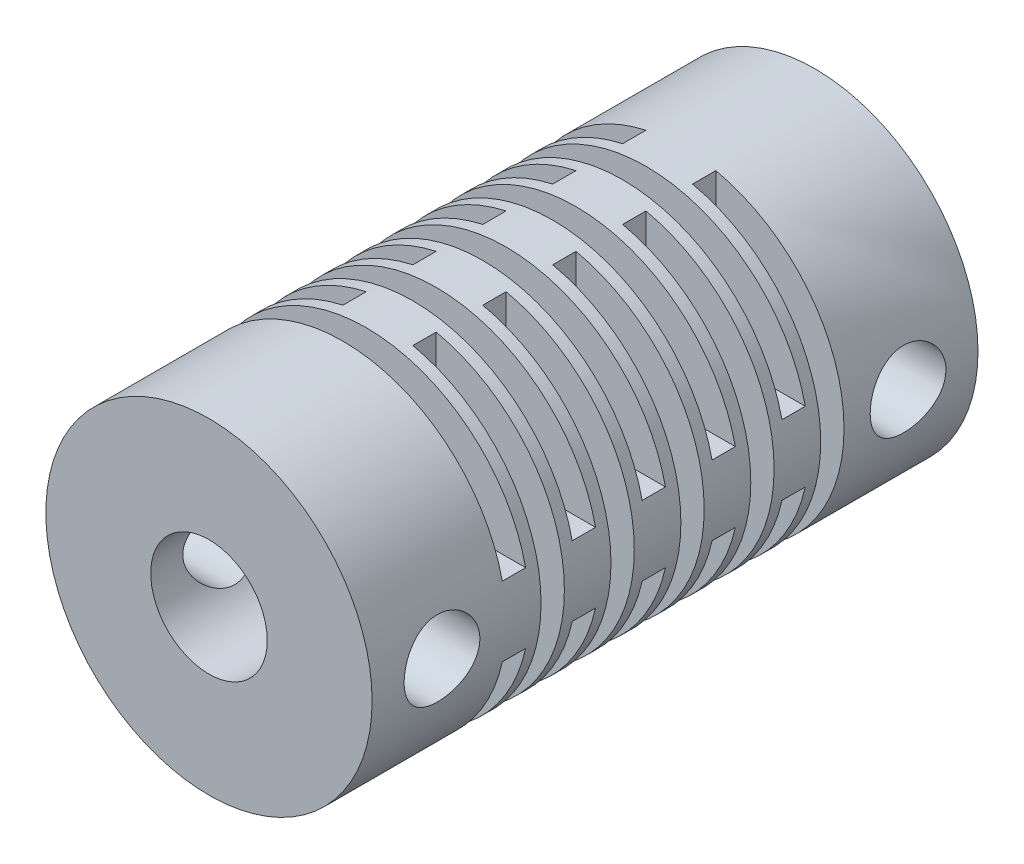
ISO-10303-21;
HEADER;
FILE_DESCRIPTION(('STEP AP214'),'2;1');
FILE_NAME('part.step','',(''),(''),'','','');
FILE_SCHEMA(('AUTOMOTIVE_DESIGN { 1 0 10303 214 1 1 1 1 }'));
ENDSEC;
DATA;
#1=APPLICATION_CONTEXT('core data for automotive mechanical design processes');
#2=APPLICATION_PROTOCOL_DEFINITION('international standard','automotive_design',2000,#1);
#3=PRODUCT_CONTEXT('',#1,'mechanical');
#4=PRODUCT('Part','Part','',(#3));
#5=PRODUCT_RELATED_PRODUCT_CATEGORY('part','',(#4));
#6=PRODUCT_DEFINITION_FORMATION('','',#4);
#7=PRODUCT_DEFINITION_CONTEXT('part definition',#1,'design');
#8=PRODUCT_DEFINITION('design','',#6,#7);
#9=PRODUCT_DEFINITION_SHAPE('','',#8);
#10=(LENGTH_UNIT() NAMED_UNIT(*) SI_UNIT(.MILLI.,.METRE.));
#11=(NAMED_UNIT(*) PLANE_ANGLE_UNIT() SI_UNIT($,.RADIAN.));
#12=(NAMED_UNIT(*) SI_UNIT($,.STERADIAN.) SOLID_ANGLE_UNIT());
#13=UNCERTAINTY_MEASURE_WITH_UNIT(LENGTH_MEASURE(1.E-05),#10,'distance_accuracy_value','');
#14=(GEOMETRIC_REPRESENTATION_CONTEXT(3) GLOBAL_UNCERTAINTY_ASSIGNED_CONTEXT((#13)) GLOBAL_UNIT_ASSIGNED_CONTEXT((#10,
#11,#12)) REPRESENTATION_CONTEXT('',''));
#15=CARTESIAN_POINT('',(0.,0.,0.));
#16=DIRECTION('',(0.,0.,1.));
#17=DIRECTION('',(1.,0.,0.));
#18=AXIS2_PLACEMENT_3D('',#15,#16,#17);
#19=CARTESIAN_POINT('',(0.,0.,13.));
#20=DIRECTION('',(0.,0.,-1.));
#21=DIRECTION('',(-1.,0.,0.));
#22=AXIS2_PLACEMENT_3D('',#19,#20,#21);
#23=CYLINDRICAL_SURFACE('',#22,7.);
#24=CARTESIAN_POINT('',(-7.,0.,11.625));
#25=CARTESIAN_POINT('',(-6.99999837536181,-0.0899842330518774,11.62499713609));
#26=CARTESIAN_POINT('',(-6.99824740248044,-0.180001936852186,11.6175004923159));
#27=CARTESIAN_POINT('',(-6.99143175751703,-0.357470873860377,11.5877487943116));
#28=CARTESIAN_POINT('',(-6.98636492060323,-0.444920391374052,11.5654840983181));
#29=CARTESIAN_POINT('',(-6.97348043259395,-0.614663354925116,11.5069387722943));
#30=CARTESIAN_POINT('',(-6.96566583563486,-0.696962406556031,11.4706736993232));
#31=CARTESIAN_POINT('',(-6.94812459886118,-0.854306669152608,11.3852086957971));
#32=CARTESIAN_POINT('',(-6.9383979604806,-0.929351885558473,11.336008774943));
#33=CARTESIAN_POINT('',(-6.91789910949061,-1.0714062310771,11.2251372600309));
#34=CARTESIAN_POINT('',(-6.90711259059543,-1.13826661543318,11.1632777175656));
#35=CARTESIAN_POINT('',(-6.88580806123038,-1.26076233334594,11.0292459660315));
#36=CARTESIAN_POINT('',(-6.87529007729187,-1.31639656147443,10.9570727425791));
#37=CARTESIAN_POINT('',(-6.85557120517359,-1.4155348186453,10.8033397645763));
#38=CARTESIAN_POINT('',(-6.84638858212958,-1.45887717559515,10.7216731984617));
#39=CARTESIAN_POINT('',(-6.83058689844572,-1.53116324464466,10.5519665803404));
#40=CARTESIAN_POINT('',(-6.82396748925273,-1.56010891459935,10.4639273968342));
#41=CARTESIAN_POINT('',(-6.8141879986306,-1.60228177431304,10.2855976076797));
#42=CARTESIAN_POINT('',(-6.81096965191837,-1.61577405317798,10.1953729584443));
#43=CARTESIAN_POINT('',(-6.80818194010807,-1.62748201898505,10.0138877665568));
#44=CARTESIAN_POINT('',(-6.80861206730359,-1.62569983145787,9.92262736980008));
#45=CARTESIAN_POINT('',(-6.81302010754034,-1.60712202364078,9.74365675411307));
#46=CARTESIAN_POINT('',(-6.81692448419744,-1.59063757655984,9.65591214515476));
#47=CARTESIAN_POINT('',(-6.82772445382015,-1.54361757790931,9.48446897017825));
#48=CARTESIAN_POINT('',(-6.83462023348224,-1.51308114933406,9.4007706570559));
#49=CARTESIAN_POINT('',(-6.85069642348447,-1.43854687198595,9.23893795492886));
#50=CARTESIAN_POINT('',(-6.85989653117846,-1.39443217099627,9.1608594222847));
#51=CARTESIAN_POINT('',(-6.87953308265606,-1.2940755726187,9.01309947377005));
#52=CARTESIAN_POINT('',(-6.88996971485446,-1.23783182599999,8.94341934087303));
#53=CARTESIAN_POINT('',(-6.91121647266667,-1.11318108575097,8.81264594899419));
#54=CARTESIAN_POINT('',(-6.92202949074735,-1.04451029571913,8.75180432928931));
#55=CARTESIAN_POINT('',(-6.94257921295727,-0.897814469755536,8.64245690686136));
#56=CARTESIAN_POINT('',(-6.95231589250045,-0.819789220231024,8.59395138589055));
#57=CARTESIAN_POINT('',(-6.96965404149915,-0.656270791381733,8.51057855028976));
#58=CARTESIAN_POINT('',(-6.97724982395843,-0.570758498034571,8.47574746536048));
#59=CARTESIAN_POINT('',(-6.98940853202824,-0.394878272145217,8.42102105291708));
#60=CARTESIAN_POINT('',(-6.99397195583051,-0.304511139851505,8.4011232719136));
#61=CARTESIAN_POINT('',(-6.99947969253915,-0.123641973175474,8.37720184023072));
#62=CARTESIAN_POINT('',(-7.000502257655,-0.0331876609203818,8.37283490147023));
#63=CARTESIAN_POINT('',(-6.99903383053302,0.147158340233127,8.37916406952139));
#64=CARTESIAN_POINT('',(-6.99654310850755,0.237050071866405,8.38985901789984));
#65=CARTESIAN_POINT('',(-6.98837767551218,0.412558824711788,8.42572431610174));
#66=CARTESIAN_POINT('',(-6.98274324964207,0.498215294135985,8.45071161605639));
#67=CARTESIAN_POINT('',(-6.96892252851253,0.664119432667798,8.51424670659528));
#68=CARTESIAN_POINT('',(-6.96073599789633,0.744366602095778,8.55279574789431));
#69=CARTESIAN_POINT('',(-6.94252820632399,0.898571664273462,8.64305450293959));
#70=CARTESIAN_POINT('',(-6.93248006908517,0.972410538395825,8.69496201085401));
#71=CARTESIAN_POINT('',(-6.91171299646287,1.11045248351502,8.81020700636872));
#72=CARTESIAN_POINT('',(-6.90099396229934,1.17465413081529,8.87354617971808));
#73=CARTESIAN_POINT('',(-6.87981809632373,1.29298054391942,9.01144020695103));
#74=CARTESIAN_POINT('',(-6.86937145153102,1.34686621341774,9.08620210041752));
#75=CARTESIAN_POINT('',(-6.85017707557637,1.44132105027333,9.24391413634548));
#76=CARTESIAN_POINT('',(-6.84142926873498,1.48189081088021,9.32686391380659));
#77=CARTESIAN_POINT('',(-6.82671271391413,1.54827332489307,9.49814433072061));
#78=CARTESIAN_POINT('',(-6.82072780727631,1.57417208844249,9.58644017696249));
#79=CARTESIAN_POINT('',(-6.81219039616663,1.61072057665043,9.76628962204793));
#80=CARTESIAN_POINT('',(-6.80963726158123,1.62137310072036,9.85784261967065));
#81=CARTESIAN_POINT('',(-6.80829568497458,1.62699608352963,10.0391880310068));
#82=CARTESIAN_POINT('',(-6.80941595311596,1.62234680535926,10.1289681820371));
#83=CARTESIAN_POINT('',(-6.81508658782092,1.59835661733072,10.3064275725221));
#84=CARTESIAN_POINT('',(-6.81963690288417,1.57901592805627,10.3941068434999));
#85=CARTESIAN_POINT('',(-6.83160771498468,1.52638589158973,10.5645274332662));
#86=CARTESIAN_POINT('',(-6.83901544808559,1.49315852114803,10.6472888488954));
#87=CARTESIAN_POINT('',(-6.85586998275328,1.41374929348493,10.8061164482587));
#88=CARTESIAN_POINT('',(-6.86531702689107,1.36756589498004,10.8821818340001));
#89=CARTESIAN_POINT('',(-6.88545332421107,1.26232304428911,11.0273176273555));
#90=CARTESIAN_POINT('',(-6.89616587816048,1.20299549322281,11.0961904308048));
#91=CARTESIAN_POINT('',(-6.91747715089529,1.07368328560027,11.2231270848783));
#92=CARTESIAN_POINT('',(-6.92807584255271,1.00369614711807,11.2811884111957));
#93=CARTESIAN_POINT('',(-6.94815462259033,0.853783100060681,11.3856960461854));
#94=CARTESIAN_POINT('',(-6.95761551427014,0.773723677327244,11.4319547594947));
#95=CARTESIAN_POINT('',(-6.97415644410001,0.606758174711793,11.5102841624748));
#96=CARTESIAN_POINT('',(-6.98123835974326,0.519857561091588,11.5423660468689));
#97=CARTESIAN_POINT('',(-6.99104822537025,0.360803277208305,11.586103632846));
#98=CARTESIAN_POINT('',(-6.99438343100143,0.289470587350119,11.6006604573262));
#99=CARTESIAN_POINT('',(-6.99885991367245,0.145432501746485,11.6201095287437));
#100=CARTESIAN_POINT('',(-7.00000131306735,0.0727271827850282,11.6250023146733));
#101=CARTESIAN_POINT('',(-7.,0.,11.625));
#102=B_SPLINE_CURVE_WITH_KNOTS('',3,(#24,#25,#26,#27,#28,#29,#30,#31,#32,#33,#34,#35,#36,#37,
#38,#39,#40,#41,#42,#43,#44,#45,#46,#47,#48,#49,#50,#51,#52,#53,#54,#55,#56,#57,#58,#59,#60,#61,
#62,#63,#64,#65,#66,#67,#68,#69,#70,#71,#72,#73,#74,#75,#76,#77,#78,#79,#80,#81,#82,#83,#84,#85,
#86,#87,#88,#89,#90,#91,#92,#93,#94,#95,#96,#97,#98,#99,#100,#101),.UNSPECIFIED.,.T.,.F.,(4,2,2,
2,2,2,2,2,2,2,2,2,2,2,2,2,2,2,2,2,2,2,2,2,2,2,2,2,2,2,2,2,2,2,2,2,2,2,4),(0.,0.269686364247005,
0.539548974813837,0.809112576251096,1.07867597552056,1.35257705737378,1.62650509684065,
1.90388461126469,2.18122639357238,2.453735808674,2.72620730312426,2.99304529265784,
3.25989993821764,3.52911852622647,3.79837818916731,4.0742220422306,4.35007219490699,
4.62664834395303,4.90317904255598,5.17355805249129,5.44391626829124,5.71088700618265,
5.97788237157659,6.24908461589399,6.5203268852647,6.79724758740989,7.07415595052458,
7.34942364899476,7.6246407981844,7.89307070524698,8.16149658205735,8.42873704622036,
8.69600931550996,8.9693390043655,9.24273243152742,9.52023302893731,9.79751410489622,
10.0154925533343,10.2334588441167),.UNSPECIFIED.);
#103=CARTESIAN_POINT('',(-7.,0.,11.625));
#104=VERTEX_POINT('',#103);
#105=EDGE_CURVE('E1513',#104,#104,#102,.T.);
#106=ORIENTED_EDGE('',*,*,#105,.T.);
#107=EDGE_LOOP('',(#106));
#108=FACE_BOUND('',#107,.T.);
#109=CARTESIAN_POINT('',(6.80877191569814,1.62499999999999,10.));
#110=CARTESIAN_POINT('',(6.80877371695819,1.62499711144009,9.91005260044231));
#111=CARTESIAN_POINT('',(6.81057372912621,1.61750639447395,9.82007167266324));
#112=CARTESIAN_POINT('',(6.81756395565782,1.5877803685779,9.64267905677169));
#113=CARTESIAN_POINT('',(6.82275642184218,1.56553526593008,9.55526911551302));
#114=CARTESIAN_POINT('',(6.8359125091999,1.50704720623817,9.38561003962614));
#115=CARTESIAN_POINT('',(6.84387286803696,1.47082072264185,9.30335496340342));
#116=CARTESIAN_POINT('',(6.86166383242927,1.38544672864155,9.14608505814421));
#117=CARTESIAN_POINT('',(6.87149444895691,1.33629914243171,9.07107027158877));
#118=CARTESIAN_POINT('',(6.89212715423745,1.22548168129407,8.92898439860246));
#119=CARTESIAN_POINT('',(6.90294297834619,1.16361208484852,8.86207104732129));
#120=CARTESIAN_POINT('',(6.92420764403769,1.02953762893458,8.73947229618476));
#121=CARTESIAN_POINT('',(6.9346564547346,0.957331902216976,8.68378783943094));
#122=CARTESIAN_POINT('',(6.9541603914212,0.803567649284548,8.58459470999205));
#123=CARTESIAN_POINT('',(6.96319741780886,0.72190788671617,8.54123910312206));
#124=CARTESIAN_POINT('',(6.97870376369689,0.552215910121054,8.46892669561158));
#125=CARTESIAN_POINT('',(6.98517340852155,0.464184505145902,8.43996807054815));
#126=CARTESIAN_POINT('',(6.99471895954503,0.285890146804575,8.39777155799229));
#127=CARTESIAN_POINT('',(6.99785251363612,0.195693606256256,8.38426631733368));
#128=CARTESIAN_POINT('',(7.00057302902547,0.0142643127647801,8.37252266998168));
#129=CARTESIAN_POINT('',(7.00016044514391,-0.0769683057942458,8.37428230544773));
#130=CARTESIAN_POINT('',(6.99587875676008,-0.256032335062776,8.39282216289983));
#131=CARTESIAN_POINT('',(6.99207600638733,-0.343895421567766,8.40931404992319));
#132=CARTESIAN_POINT('',(6.98151753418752,-0.515571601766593,8.45638914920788));
#133=CARTESIAN_POINT('',(6.97476166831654,-0.599384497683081,8.48697304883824));
#134=CARTESIAN_POINT('',(6.95895148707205,-0.761364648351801,8.56160995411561));
#135=CARTESIAN_POINT('',(6.9498790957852,-0.839480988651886,8.60576947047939));
#136=CARTESIAN_POINT('',(6.9304263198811,-0.987298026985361,8.70622412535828));
#137=CARTESIAN_POINT('',(6.92004573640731,-1.05699744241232,8.76252110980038));
#138=CARTESIAN_POINT('',(6.8988272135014,-1.18771926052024,8.88721268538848));
#139=CARTESIAN_POINT('',(6.88798425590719,-1.24850046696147,8.95585952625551));
#140=CARTESIAN_POINT('',(6.86728841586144,-1.35773699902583,9.10248492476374));
#141=CARTESIAN_POINT('',(6.85743556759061,-1.40619189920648,9.18046380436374));
#142=CARTESIAN_POINT('',(6.83982013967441,-1.48952669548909,9.34396379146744));
#143=CARTESIAN_POINT('',(6.83206539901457,-1.52435589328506,9.42951164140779));
#144=CARTESIAN_POINT('',(6.81962902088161,-1.57906793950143,9.60546995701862));
#145=CARTESIAN_POINT('',(6.81494682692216,-1.59895349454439,9.69587953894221));
#146=CARTESIAN_POINT('',(6.80930059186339,-1.62282897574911,9.87677734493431));
#147=CARTESIAN_POINT('',(6.80825389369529,-1.62717234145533,9.96721639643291));
#148=CARTESIAN_POINT('',(6.80977334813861,-1.62080149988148,10.1475264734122));
#149=CARTESIAN_POINT('',(6.81233921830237,-1.6100884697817,10.2373975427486));
#150=CARTESIAN_POINT('',(6.82071616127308,-1.57421699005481,10.4127564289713));
#151=CARTESIAN_POINT('',(6.82648244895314,-1.54925776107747,10.4982873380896));
#152=CARTESIAN_POINT('',(6.84056923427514,-1.48582021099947,10.6639526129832));
#153=CARTESIAN_POINT('',(6.84889000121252,-1.44734046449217,10.7440864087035));
#154=CARTESIAN_POINT('',(6.86732666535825,-1.35719170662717,10.8981990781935));
#155=CARTESIAN_POINT('',(6.87747092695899,-1.30530761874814,10.9720486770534));
#156=CARTESIAN_POINT('',(6.89833898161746,-1.19010043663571,11.110122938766));
#157=CARTESIAN_POINT('',(6.90906285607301,-1.12677573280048,11.1743462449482));
#158=CARTESIAN_POINT('',(6.93015748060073,-0.988875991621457,11.2927413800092));
#159=CARTESIAN_POINT('',(6.94051589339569,-0.914090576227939,11.346670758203));
#160=CARTESIAN_POINT('',(6.95947461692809,-0.7563177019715,11.4412022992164));
#161=CARTESIAN_POINT('',(6.9680750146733,-0.673330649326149,11.4818051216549));
#162=CARTESIAN_POINT('',(6.98249722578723,-0.502056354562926,11.5482057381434));
#163=CARTESIAN_POINT('',(6.9883377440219,-0.413809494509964,11.5741034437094));
#164=CARTESIAN_POINT('',(6.99666345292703,-0.23406512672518,11.6106663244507));
#165=CARTESIAN_POINT('',(6.99914919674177,-0.142568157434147,11.6213340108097));
#166=CARTESIAN_POINT('',(7.00046630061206,0.0387877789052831,11.6270092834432));
#167=CARTESIAN_POINT('',(6.99938171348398,0.128635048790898,11.6223770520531));
#168=CARTESIAN_POINT('',(6.99386271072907,0.306233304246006,11.5983976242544));
#169=CARTESIAN_POINT('',(6.98942837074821,0.393984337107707,11.5790507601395));
#170=CARTESIAN_POINT('',(6.97771719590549,0.564579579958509,11.5263727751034));
#171=CARTESIAN_POINT('',(6.97045194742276,0.647442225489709,11.4930986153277));
#172=CARTESIAN_POINT('',(6.95385010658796,0.806453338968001,11.4135640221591));
#173=CARTESIAN_POINT('',(6.94451328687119,0.882601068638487,11.3673021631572));
#174=CARTESIAN_POINT('',(6.92453609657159,1.0277580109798,11.2619623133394));
#175=CARTESIAN_POINT('',(6.9138723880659,1.09658281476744,11.202634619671));
#176=CARTESIAN_POINT('',(6.892559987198,1.22342258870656,11.0733431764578));
#177=CARTESIAN_POINT('',(6.88191129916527,1.28143490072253,11.0033768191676));
#178=CARTESIAN_POINT('',(6.8616491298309,1.38587603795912,10.8534899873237));
#179=CARTESIAN_POINT('',(6.85205423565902,1.43211154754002,10.7734321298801));
#180=CARTESIAN_POINT('',(6.83522590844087,1.51039797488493,10.6064728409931));
#181=CARTESIAN_POINT('',(6.82799059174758,1.5424602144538,10.519576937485));
#182=CARTESIAN_POINT('',(6.81795409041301,1.58615392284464,10.3605715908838));
#183=CARTESIAN_POINT('',(6.81453485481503,1.60069173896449,10.2892856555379));
#184=CARTESIAN_POINT('',(6.80994310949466,1.62011564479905,10.1453403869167));
#185=CARTESIAN_POINT('',(6.80877046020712,1.6250023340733,10.0726811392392));
#186=CARTESIAN_POINT('',(6.80877191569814,1.62499999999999,10.));
#187=B_SPLINE_CURVE_WITH_KNOTS('',3,(#109,#110,#111,#112,#113,#114,#115,#116,#117,#118,#119,
#120,#121,#122,#123,#124,#125,#126,#127,#128,#129,#130,#131,#132,#133,#134,#135,#136,#137,#138,
#139,#140,#141,#142,#143,#144,#145,#146,#147,#148,#149,#150,#151,#152,#153,#154,#155,#156,#157,
#158,#159,#160,#161,#162,#163,#164,#165,#166,#167,#168,#169,#170,#171,#172,#173,#174,#175,#176,
#177,#178,#179,#180,#181,#182,#183,#184,#185,#186),.UNSPECIFIED.,.T.,.F.,(4,2,2,2,2,2,2,2,2,2,2,
2,2,2,2,2,2,2,2,2,2,2,2,2,2,2,2,2,2,2,2,2,2,2,2,2,2,2,4),(0.,0.269575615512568,
0.539330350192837,0.808768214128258,1.07820765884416,1.35225356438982,1.62632247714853,
1.90365866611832,2.18095970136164,2.45338705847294,2.72577947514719,2.9929547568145,
3.26014307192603,3.52948361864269,3.79886515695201,4.07454998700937,4.35024433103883,
4.6269549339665,4.9036154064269,5.17394297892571,5.44424941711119,5.71086535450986,
5.97750940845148,6.24873086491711,6.51999050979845,6.79701136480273,7.0740185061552,
7.34912032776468,7.62417678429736,7.89280459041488,8.16142633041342,8.42896000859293,
8.69652306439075,8.9697287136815,9.24300143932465,9.52050650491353,9.797789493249,
10.0156310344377,10.2334590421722),.UNSPECIFIED.);
#188=CARTESIAN_POINT('',(6.80877191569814,1.62499999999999,10.));
#189=VERTEX_POINT('',#188);
#190=EDGE_CURVE('E1584',#189,#189,#187,.T.);
#191=ORIENTED_EDGE('',*,*,#190,.T.);
#192=EDGE_LOOP('',(#191));
#193=FACE_BOUND('',#192,.T.);
#194=CARTESIAN_POINT('',(-7.,0.,-8.375));
#195=CARTESIAN_POINT('',(-6.99999837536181,-0.0899842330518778,-8.37500286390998));
#196=CARTESIAN_POINT('',(-6.99824740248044,-0.180001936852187,-8.38249950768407));
#197=CARTESIAN_POINT('',(-6.99143175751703,-0.357470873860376,-8.41225120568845));
#198=CARTESIAN_POINT('',(-6.98636492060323,-0.444920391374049,-8.43451590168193));
#199=CARTESIAN_POINT('',(-6.97348043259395,-0.614663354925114,-8.49306122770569));
#200=CARTESIAN_POINT('',(-6.96566583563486,-0.696962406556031,-8.52932630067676));
#201=CARTESIAN_POINT('',(-6.94812459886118,-0.854306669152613,-8.61479130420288));
#202=CARTESIAN_POINT('',(-6.9383979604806,-0.92935188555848,-8.66399122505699));
#203=CARTESIAN_POINT('',(-6.91789910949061,-1.07140623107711,-8.77486273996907));
#204=CARTESIAN_POINT('',(-6.90711259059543,-1.13826661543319,-8.83672228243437));
#205=CARTESIAN_POINT('',(-6.88580806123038,-1.26076233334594,-8.97075403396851));
#206=CARTESIAN_POINT('',(-6.87529007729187,-1.31639656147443,-9.04292725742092));
#207=CARTESIAN_POINT('',(-6.85557120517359,-1.4155348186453,-9.19666023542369));
#208=CARTESIAN_POINT('',(-6.84638858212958,-1.45887717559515,-9.27832680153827));
#209=CARTESIAN_POINT('',(-6.83058689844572,-1.53116324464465,-9.44803341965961));
#210=CARTESIAN_POINT('',(-6.82396748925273,-1.56010891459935,-9.53607260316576));
#211=CARTESIAN_POINT('',(-6.8141879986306,-1.60228177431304,-9.7144023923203));
#212=CARTESIAN_POINT('',(-6.81096965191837,-1.61577405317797,-9.8046270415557));
#213=CARTESIAN_POINT('',(-6.80818194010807,-1.62748201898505,-9.98611223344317));
#214=CARTESIAN_POINT('',(-6.80861206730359,-1.62569983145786,-10.0773726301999));
#215=CARTESIAN_POINT('',(-6.81302010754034,-1.60712202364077,-10.2563432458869));
#216=CARTESIAN_POINT('',(-6.81692448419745,-1.59063757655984,-10.3440878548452));
#217=CARTESIAN_POINT('',(-6.82772445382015,-1.54361757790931,-10.5155310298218));
#218=CARTESIAN_POINT('',(-6.83462023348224,-1.51308114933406,-10.5992293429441));
#219=CARTESIAN_POINT('',(-6.85069642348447,-1.43854687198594,-10.7610620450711));
#220=CARTESIAN_POINT('',(-6.85989653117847,-1.39443217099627,-10.8391405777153));
#221=CARTESIAN_POINT('',(-6.87953308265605,-1.2940755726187,-10.98690052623));
#222=CARTESIAN_POINT('',(-6.88996971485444,-1.237831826,-11.056580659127));
#223=CARTESIAN_POINT('',(-6.91121647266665,-1.11318108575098,-11.1873540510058));
#224=CARTESIAN_POINT('',(-6.92202949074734,-1.04451029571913,-11.2481956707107));
#225=CARTESIAN_POINT('',(-6.94257921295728,-0.897814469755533,-11.3575430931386));
#226=CARTESIAN_POINT('',(-6.95231589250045,-0.819789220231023,-11.4060486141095));
#227=CARTESIAN_POINT('',(-6.96965404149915,-0.656270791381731,-11.4894214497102));
#228=CARTESIAN_POINT('',(-6.97724982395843,-0.570758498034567,-11.5242525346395));
#229=CARTESIAN_POINT('',(-6.98940853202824,-0.394878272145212,-11.5789789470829));
#230=CARTESIAN_POINT('',(-6.99397195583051,-0.3045111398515,-11.5988767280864));
#231=CARTESIAN_POINT('',(-6.99947969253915,-0.123641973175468,-11.6227981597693));
#232=CARTESIAN_POINT('',(-7.000502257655,-0.033187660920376,-11.6271650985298));
#233=CARTESIAN_POINT('',(-6.99903383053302,0.147158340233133,-11.6208359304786));
#234=CARTESIAN_POINT('',(-6.99654310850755,0.237050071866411,-11.6101409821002));
#235=CARTESIAN_POINT('',(-6.98837767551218,0.412558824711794,-11.5742756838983));
#236=CARTESIAN_POINT('',(-6.98274324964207,0.498215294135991,-11.5492883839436));
#237=CARTESIAN_POINT('',(-6.96892252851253,0.664119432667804,-11.4857532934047));
#238=CARTESIAN_POINT('',(-6.96073599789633,0.744366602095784,-11.4472042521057));
#239=CARTESIAN_POINT('',(-6.94252820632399,0.898571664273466,-11.3569454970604));
#240=CARTESIAN_POINT('',(-6.93248006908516,0.972410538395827,-11.305037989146));
#241=CARTESIAN_POINT('',(-6.91171299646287,1.11045248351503,-11.1897929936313));
#242=CARTESIAN_POINT('',(-6.90099396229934,1.1746541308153,-11.1264538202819));
#243=CARTESIAN_POINT('',(-6.87981809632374,1.29298054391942,-10.988559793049));
#244=CARTESIAN_POINT('',(-6.86937145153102,1.34686621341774,-10.9137978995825));
#245=CARTESIAN_POINT('',(-6.85017707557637,1.44132105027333,-10.7560858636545));
#246=CARTESIAN_POINT('',(-6.84142926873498,1.48189081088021,-10.6731360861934));
#247=CARTESIAN_POINT('',(-6.82671271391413,1.54827332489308,-10.5018556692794));
#248=CARTESIAN_POINT('',(-6.82072780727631,1.57417208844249,-10.4135598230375));
#249=CARTESIAN_POINT('',(-6.81219039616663,1.61072057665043,-10.2337103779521));
#250=CARTESIAN_POINT('',(-6.80963726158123,1.62137310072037,-10.1421573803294));
#251=CARTESIAN_POINT('',(-6.80829568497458,1.62699608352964,-9.96081196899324));
#252=CARTESIAN_POINT('',(-6.80941595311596,1.62234680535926,-9.8710318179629));
#253=CARTESIAN_POINT('',(-6.81508658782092,1.59835661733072,-9.69357242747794));
#254=CARTESIAN_POINT('',(-6.81963690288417,1.57901592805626,-9.60589315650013));
#255=CARTESIAN_POINT('',(-6.83160771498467,1.52638589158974,-9.43547256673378));
#256=CARTESIAN_POINT('',(-6.83901544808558,1.49315852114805,-9.35271115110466));
#257=CARTESIAN_POINT('',(-6.85586998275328,1.41374929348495,-9.19388355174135));
#258=CARTESIAN_POINT('',(-6.86531702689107,1.36756589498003,-9.11781816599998));
#259=CARTESIAN_POINT('',(-6.88545332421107,1.26232304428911,-8.97268237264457));
#260=CARTESIAN_POINT('',(-6.89616587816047,1.20299549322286,-8.90380956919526));
#261=CARTESIAN_POINT('',(-6.91747715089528,1.07368328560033,-8.77687291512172));
#262=CARTESIAN_POINT('',(-6.92807584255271,1.00369614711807,-8.7188115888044));
#263=CARTESIAN_POINT('',(-6.94815462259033,0.853783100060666,-8.61430395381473));
#264=CARTESIAN_POINT('',(-6.95761551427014,0.773723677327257,-8.5680452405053));
#265=CARTESIAN_POINT('',(-6.97415644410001,0.606758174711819,-8.48971583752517));
#266=CARTESIAN_POINT('',(-6.98123835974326,0.519857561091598,-8.45763395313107));
#267=CARTESIAN_POINT('',(-6.99104822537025,0.360803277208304,-8.41389636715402));
#268=CARTESIAN_POINT('',(-6.99438343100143,0.289470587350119,-8.39933954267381));
#269=CARTESIAN_POINT('',(-6.99885991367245,0.145432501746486,-8.37989047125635));
#270=CARTESIAN_POINT('',(-7.00000131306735,0.0727271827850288,-8.37499768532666));
#271=CARTESIAN_POINT('',(-7.,0.,-8.375));
#272=B_SPLINE_CURVE_WITH_KNOTS('',3,(#194,#195,#196,#197,#198,#199,#200,#201,#202,#203,#204,
#205,#206,#207,#208,#209,#210,#211,#212,#213,#214,#215,#216,#217,#218,#219,#220,#221,#222,#223,
#224,#225,#226,#227,#228,#229,#230,#231,#232,#233,#234,#235,#236,#237,#238,#239,#240,#241,#242,
#243,#244,#245,#246,#247,#248,#249,#250,#251,#252,#253,#254,#255,#256,#257,#258,#259,#260,#261,
#262,#263,#264,#265,#266,#267,#268,#269,#270,#271),.UNSPECIFIED.,.T.,.F.,(4,2,2,2,2,2,2,2,2,2,2,
2,2,2,2,2,2,2,2,2,2,2,2,2,2,2,2,2,2,2,2,2,2,2,2,2,2,2,4),(0.,0.269686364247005,
0.539548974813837,0.809112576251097,1.07867597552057,1.35257705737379,1.62650509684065,
1.90388461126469,2.18122639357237,2.453735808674,2.72620730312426,2.99304529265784,
3.25989993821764,3.52911852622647,3.7983781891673,4.0742220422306,4.350072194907,
4.62664834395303,4.90317904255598,5.17355805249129,5.44391626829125,5.71088700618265,
5.97788237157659,6.24908461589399,6.52032688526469,6.79724758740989,7.07415595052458,
7.34942364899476,7.6246407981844,7.89307070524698,8.16149658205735,8.42873704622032,
8.69600931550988,8.96933900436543,9.24273243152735,9.52023302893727,9.79751410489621,
10.0154925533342,10.2334588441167),.UNSPECIFIED.);
#273=CARTESIAN_POINT('',(-7.,0.,-8.375));
#274=VERTEX_POINT('',#273);
#275=EDGE_CURVE('E889',#274,#274,#272,.T.);
#276=ORIENTED_EDGE('',*,*,#275,.T.);
#277=EDGE_LOOP('',(#276));
#278=FACE_BOUND('',#277,.T.);
#279=CARTESIAN_POINT('',(6.80877191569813,1.62499999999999,-10.));
#280=CARTESIAN_POINT('',(6.80877371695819,1.62499711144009,-10.0899473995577));
#281=CARTESIAN_POINT('',(6.81057372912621,1.61750639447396,-10.1799283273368));
#282=CARTESIAN_POINT('',(6.81756395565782,1.5877803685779,-10.3573209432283));
#283=CARTESIAN_POINT('',(6.82275642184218,1.56553526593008,-10.444730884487));
#284=CARTESIAN_POINT('',(6.8359125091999,1.50704720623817,-10.6143899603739));
#285=CARTESIAN_POINT('',(6.84387286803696,1.47082072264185,-10.6966450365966));
#286=CARTESIAN_POINT('',(6.86166383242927,1.38544672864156,-10.8539149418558));
#287=CARTESIAN_POINT('',(6.87149444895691,1.33629914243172,-10.9289297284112));
#288=CARTESIAN_POINT('',(6.89212715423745,1.22548168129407,-11.0710156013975));
#289=CARTESIAN_POINT('',(6.90294297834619,1.16361208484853,-11.1379289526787));
#290=CARTESIAN_POINT('',(6.92420764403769,1.02953762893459,-11.2605277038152));
#291=CARTESIAN_POINT('',(6.9346564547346,0.957331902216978,-11.3162121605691));
#292=CARTESIAN_POINT('',(6.9541603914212,0.80356764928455,-11.4154052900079));
#293=CARTESIAN_POINT('',(6.96319741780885,0.721907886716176,-11.4587608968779));
#294=CARTESIAN_POINT('',(6.97870376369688,0.552215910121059,-11.5310733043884));
#295=CARTESIAN_POINT('',(6.98517340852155,0.464184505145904,-11.5600319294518));
#296=CARTESIAN_POINT('',(6.99471895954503,0.285890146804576,-11.6022284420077));
#297=CARTESIAN_POINT('',(6.99785251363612,0.195693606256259,-11.6157336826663));
#298=CARTESIAN_POINT('',(7.00057302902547,0.0142643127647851,-11.6274773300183));
#299=CARTESIAN_POINT('',(7.00016044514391,-0.0769683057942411,-11.6257176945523));
#300=CARTESIAN_POINT('',(6.99587875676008,-0.256032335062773,-11.6071778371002));
#301=CARTESIAN_POINT('',(6.99207600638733,-0.343895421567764,-11.5906859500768));
#302=CARTESIAN_POINT('',(6.98151753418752,-0.515571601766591,-11.5436108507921));
#303=CARTESIAN_POINT('',(6.97476166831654,-0.599384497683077,-11.5130269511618));
#304=CARTESIAN_POINT('',(6.95895148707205,-0.7613646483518,-11.4383900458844));
#305=CARTESIAN_POINT('',(6.9498790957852,-0.839480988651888,-11.3942305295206));
#306=CARTESIAN_POINT('',(6.9304263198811,-0.987298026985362,-11.2937758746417));
#307=CARTESIAN_POINT('',(6.92004573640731,-1.05699744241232,-11.2374788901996));
#308=CARTESIAN_POINT('',(6.8988272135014,-1.18771926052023,-11.1127873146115));
#309=CARTESIAN_POINT('',(6.88798425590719,-1.24850046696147,-11.0441404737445));
#310=CARTESIAN_POINT('',(6.86728841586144,-1.35773699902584,-10.8975150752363));
#311=CARTESIAN_POINT('',(6.85743556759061,-1.40619189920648,-10.8195361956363));
#312=CARTESIAN_POINT('',(6.83982013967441,-1.48952669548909,-10.6560362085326));
#313=CARTESIAN_POINT('',(6.83206539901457,-1.52435589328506,-10.5704883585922));
#314=CARTESIAN_POINT('',(6.81962902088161,-1.57906793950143,-10.3945300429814));
#315=CARTESIAN_POINT('',(6.81494682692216,-1.59895349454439,-10.3041204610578));
#316=CARTESIAN_POINT('',(6.80930059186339,-1.62282897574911,-10.1232226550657));
#317=CARTESIAN_POINT('',(6.80825389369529,-1.62717234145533,-10.0327836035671));
#318=CARTESIAN_POINT('',(6.80977334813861,-1.62080149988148,-9.85247352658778));
#319=CARTESIAN_POINT('',(6.81233921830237,-1.6100884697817,-9.76260245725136));
#320=CARTESIAN_POINT('',(6.82071616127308,-1.5742169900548,-9.58724357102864));
#321=CARTESIAN_POINT('',(6.82648244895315,-1.54925776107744,-9.50171266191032));
#322=CARTESIAN_POINT('',(6.84056923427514,-1.48582021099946,-9.33604738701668));
#323=CARTESIAN_POINT('',(6.84889000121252,-1.44734046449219,-9.25591359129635));
#324=CARTESIAN_POINT('',(6.86732666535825,-1.35719170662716,-9.10180092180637));
#325=CARTESIAN_POINT('',(6.87747092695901,-1.30530761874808,-9.02795132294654));
#326=CARTESIAN_POINT('',(6.89833898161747,-1.19010043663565,-8.88987706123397));
#327=CARTESIAN_POINT('',(6.90906285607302,-1.12677573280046,-8.82565375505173));
#328=CARTESIAN_POINT('',(6.93015748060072,-0.98887599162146,-8.70725861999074));
#329=CARTESIAN_POINT('',(6.94051589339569,-0.914090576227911,-8.65332924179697));
#330=CARTESIAN_POINT('',(6.9594746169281,-0.756317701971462,-8.5587977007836));
#331=CARTESIAN_POINT('',(6.96807501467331,-0.673330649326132,-8.51819487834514));
#332=CARTESIAN_POINT('',(6.98249722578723,-0.502056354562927,-8.45179426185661));
#333=CARTESIAN_POINT('',(6.9883377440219,-0.41380949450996,-8.42589655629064));
#334=CARTESIAN_POINT('',(6.99666345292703,-0.234065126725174,-8.38933367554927));
#335=CARTESIAN_POINT('',(6.99914919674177,-0.142568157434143,-8.37866598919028));
#336=CARTESIAN_POINT('',(7.00046630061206,0.0387877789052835,-8.37299071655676));
#337=CARTESIAN_POINT('',(6.99938171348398,0.128635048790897,-8.37762294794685));
#338=CARTESIAN_POINT('',(6.99386271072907,0.306233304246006,-8.40160237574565));
#339=CARTESIAN_POINT('',(6.98942837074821,0.393984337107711,-8.42094923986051));
#340=CARTESIAN_POINT('',(6.97771719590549,0.564579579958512,-8.47362722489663));
#341=CARTESIAN_POINT('',(6.97045194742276,0.647442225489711,-8.50690138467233));
#342=CARTESIAN_POINT('',(6.95385010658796,0.806453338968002,-8.58643597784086));
#343=CARTESIAN_POINT('',(6.94451328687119,0.882601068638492,-8.63269783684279));
#344=CARTESIAN_POINT('',(6.92453609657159,1.02775801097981,-8.73803768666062));
#345=CARTESIAN_POINT('',(6.9138723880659,1.09658281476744,-8.79736538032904));
#346=CARTESIAN_POINT('',(6.892559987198,1.22342258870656,-8.92665682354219));
#347=CARTESIAN_POINT('',(6.88191129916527,1.28143490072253,-8.99662318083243));
#348=CARTESIAN_POINT('',(6.8616491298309,1.38587603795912,-9.14651001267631));
#349=CARTESIAN_POINT('',(6.85205423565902,1.43211154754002,-9.22656787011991));
#350=CARTESIAN_POINT('',(6.83522590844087,1.51039797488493,-9.3935271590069));
#351=CARTESIAN_POINT('',(6.82799059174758,1.54246021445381,-9.48042306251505));
#352=CARTESIAN_POINT('',(6.81795409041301,1.58615392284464,-9.6394284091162));
#353=CARTESIAN_POINT('',(6.81453485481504,1.60069173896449,-9.71071434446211));
#354=CARTESIAN_POINT('',(6.80994310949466,1.62011564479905,-9.85465961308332));
#355=CARTESIAN_POINT('',(6.80877046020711,1.6250023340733,-9.92731886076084));
#356=CARTESIAN_POINT('',(6.80877191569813,1.62499999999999,-10.));
#357=B_SPLINE_CURVE_WITH_KNOTS('',3,(#279,#280,#281,#282,#283,#284,#285,#286,#287,#288,#289,
#290,#291,#292,#293,#294,#295,#296,#297,#298,#299,#300,#301,#302,#303,#304,#305,#306,#307,#308,
#309,#310,#311,#312,#313,#314,#315,#316,#317,#318,#319,#320,#321,#322,#323,#324,#325,#326,#327,
#328,#329,#330,#331,#332,#333,#334,#335,#336,#337,#338,#339,#340,#341,#342,#343,#344,#345,#346,
#347,#348,#349,#350,#351,#352,#353,#354,#355,#356),.UNSPECIFIED.,.T.,.F.,(4,2,2,2,2,2,2,2,2,2,2,
2,2,2,2,2,2,2,2,2,2,2,2,2,2,2,2,2,2,2,2,2,2,2,2,2,2,2,4),(0.,0.269575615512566,
0.539330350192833,0.808768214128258,1.07820765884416,1.35225356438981,1.62632247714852,
1.90365866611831,2.18095970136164,2.45338705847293,2.72577947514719,2.99295475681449,
3.26014307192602,3.52948361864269,3.79886515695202,4.07454998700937,4.35024433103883,
4.6269549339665,4.9036154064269,5.17394297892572,5.4442494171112,5.71086535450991,
5.97750940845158,6.24873086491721,6.51999050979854,6.79701136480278,7.07401850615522,
7.3491203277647,7.62417678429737,7.89280459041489,8.16142633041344,8.42896000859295,
8.69652306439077,8.96972871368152,9.24300143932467,9.52050650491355,9.79778949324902,
10.0156310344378,10.2334590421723),.UNSPECIFIED.);
#358=CARTESIAN_POINT('',(6.80877191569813,1.62499999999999,-10.));
#359=VERTEX_POINT('',#358);
#360=EDGE_CURVE('E1534',#359,#359,#357,.T.);
#361=ORIENTED_EDGE('',*,*,#360,.T.);
#362=EDGE_LOOP('',(#361));
#363=FACE_BOUND('',#362,.T.);
#364=DIRECTION('',(0.,0.,-1.));
#365=VECTOR('',#364,1.);
#366=CARTESIAN_POINT('',(1.5,-6.83739716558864,5.75));
#367=LINE('',#366,#365);
#368=CARTESIAN_POINT('',(1.5,-6.83739716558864,5.75));
#369=VERTEX_POINT('',#368);
#370=CARTESIAN_POINT('',(1.50000000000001,-6.83739716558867,4.75));
#371=VERTEX_POINT('',#370);
#372=EDGE_CURVE('E369',#369,#371,#367,.T.);
#373=ORIENTED_EDGE('',*,*,#372,.F.);
#374=CARTESIAN_POINT('',(0.,0.,5.75));
#375=DIRECTION('',(0.,0.,1.));
#376=DIRECTION('',(1.,0.,0.));
#377=AXIS2_PLACEMENT_3D('',#374,#375,#376);
#378=CIRCLE('',#377,7.);
#379=CARTESIAN_POINT('',(1.50000000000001,6.8373971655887,5.75));
#380=VERTEX_POINT('',#379);
#381=EDGE_CURVE('E893',#369,#380,#378,.T.);
#382=ORIENTED_EDGE('',*,*,#381,.T.);
#383=DIRECTION('',(0.,0.,-1.));
#384=VECTOR('',#383,1.);
#385=CARTESIAN_POINT('',(1.50000000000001,6.8373971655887,5.75));
#386=LINE('',#385,#384);
#387=CARTESIAN_POINT('',(1.50000000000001,6.83739716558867,4.75));
#388=VERTEX_POINT('',#387);
#389=EDGE_CURVE('E878',#380,#388,#386,.T.);
#390=ORIENTED_EDGE('',*,*,#389,.T.);
#391=CARTESIAN_POINT('',(0.,0.,4.75));
#392=DIRECTION('',(0.,0.,1.));
#393=DIRECTION('',(1.,0.,0.));
#394=AXIS2_PLACEMENT_3D('',#391,#392,#393);
#395=CIRCLE('',#394,7.);
#396=EDGE_CURVE('E883',#371,#388,#395,.T.);
#397=ORIENTED_EDGE('',*,*,#396,.F.);
#398=EDGE_LOOP('',(#373,#382,#390,#397));
#399=FACE_BOUND('',#398,.T.);
#400=DIRECTION('',(0.,0.,-1.));
#401=VECTOR('',#400,1.);
#402=CARTESIAN_POINT('',(-1.5,6.8373971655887,5.75000000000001));
#403=LINE('',#402,#401);
#404=CARTESIAN_POINT('',(-1.5,6.8373971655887,5.75000000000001));
#405=VERTEX_POINT('',#404);
#406=CARTESIAN_POINT('',(-1.49999999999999,6.83739716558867,4.75));
#407=VERTEX_POINT('',#406);
#408=EDGE_CURVE('E925',#405,#407,#403,.T.);
#409=ORIENTED_EDGE('',*,*,#408,.F.);
#410=CARTESIAN_POINT('',(0.,0.,5.75));
#411=DIRECTION('',(0.,0.,1.));
#412=DIRECTION('',(1.,0.,0.));
#413=AXIS2_PLACEMENT_3D('',#410,#411,#412);
#414=CIRCLE('',#413,7.);
#415=CARTESIAN_POINT('',(-1.5,-6.83739716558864,5.75));
#416=VERTEX_POINT('',#415);
#417=EDGE_CURVE('E915',#405,#416,#414,.T.);
#418=ORIENTED_EDGE('',*,*,#417,.T.);
#419=DIRECTION('',(0.,0.,-1.));
#420=VECTOR('',#419,1.);
#421=CARTESIAN_POINT('',(-1.5,-6.83739716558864,5.75));
#422=LINE('',#421,#420);
#423=CARTESIAN_POINT('',(-1.49999999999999,-6.83739716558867,4.75));
#424=VERTEX_POINT('',#423);
#425=EDGE_CURVE('E922',#416,#424,#422,.T.);
#426=ORIENTED_EDGE('',*,*,#425,.T.);
#427=CARTESIAN_POINT('',(0.,0.,4.75));
#428=DIRECTION('',(0.,0.,1.));
#429=DIRECTION('',(1.,0.,0.));
#430=AXIS2_PLACEMENT_3D('',#427,#428,#429);
#431=CIRCLE('',#430,7.);
#432=EDGE_CURVE('E905',#407,#424,#431,.T.);
#433=ORIENTED_EDGE('',*,*,#432,.F.);
#434=EDGE_LOOP('',(#409,#418,#426,#433));
#435=FACE_BOUND('',#434,.T.);
#436=DIRECTION('',(0.,0.,-1.));
#437=VECTOR('',#436,1.);
#438=CARTESIAN_POINT('',(1.5,-6.83739716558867,2.75));
#439=LINE('',#438,#437);
#440=CARTESIAN_POINT('',(1.5,-6.83739716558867,2.75));
#441=VERTEX_POINT('',#440);
#442=CARTESIAN_POINT('',(1.5,-6.83739716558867,1.75));
#443=VERTEX_POINT('',#442);
#444=EDGE_CURVE('E951',#441,#443,#439,.T.);
#445=ORIENTED_EDGE('',*,*,#444,.F.);
#446=CARTESIAN_POINT('',(0.,0.,2.75));
#447=DIRECTION('',(0.,0.,1.));
#448=DIRECTION('',(1.,0.,0.));
#449=AXIS2_PLACEMENT_3D('',#446,#447,#448);
#450=CIRCLE('',#449,7.);
#451=CARTESIAN_POINT('',(1.50000000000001,6.83739716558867,2.75));
#452=VERTEX_POINT('',#451);
#453=EDGE_CURVE('E941',#441,#452,#450,.T.);
#454=ORIENTED_EDGE('',*,*,#453,.T.);
#455=DIRECTION('',(0.,0.,-1.));
#456=VECTOR('',#455,1.);
#457=CARTESIAN_POINT('',(1.50000000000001,6.83739716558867,2.75));
#458=LINE('',#457,#456);
#459=CARTESIAN_POINT('',(1.50000000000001,6.83739716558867,1.75));
#460=VERTEX_POINT('',#459);
#461=EDGE_CURVE('E958',#452,#460,#458,.T.);
#462=ORIENTED_EDGE('',*,*,#461,.T.);
#463=CARTESIAN_POINT('',(0.,0.,1.75));
#464=DIRECTION('',(0.,0.,1.));
#465=DIRECTION('',(1.,0.,0.));
#466=AXIS2_PLACEMENT_3D('',#463,#464,#465);
#467=CIRCLE('',#466,7.);
#468=EDGE_CURVE('E930',#443,#460,#467,.T.);
#469=ORIENTED_EDGE('',*,*,#468,.F.);
#470=EDGE_LOOP('',(#445,#454,#462,#469));
#471=FACE_BOUND('',#470,.T.);
#472=DIRECTION('',(0.,0.,-1.));
#473=VECTOR('',#472,1.);
#474=CARTESIAN_POINT('',(-1.5,6.83739716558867,2.75));
#475=LINE('',#474,#473);
#476=CARTESIAN_POINT('',(-1.5,6.83739716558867,2.75));
#477=VERTEX_POINT('',#476);
#478=CARTESIAN_POINT('',(-1.49999999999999,6.83739716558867,1.75));
#479=VERTEX_POINT('',#478);
#480=EDGE_CURVE('E987',#477,#479,#475,.T.);
#481=ORIENTED_EDGE('',*,*,#480,.F.);
#482=CARTESIAN_POINT('',(0.,0.,2.75));
#483=DIRECTION('',(0.,0.,1.));
#484=DIRECTION('',(1.,0.,0.));
#485=AXIS2_PLACEMENT_3D('',#482,#483,#484);
#486=CIRCLE('',#485,7.);
#487=CARTESIAN_POINT('',(-1.5,-6.83739716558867,2.75));
#488=VERTEX_POINT('',#487);
#489=EDGE_CURVE('E977',#477,#488,#486,.T.);
#490=ORIENTED_EDGE('',*,*,#489,.T.);
#491=DIRECTION('',(0.,0.,-1.));
#492=VECTOR('',#491,1.);
#493=CARTESIAN_POINT('',(-1.5,-6.83739716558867,2.75));
#494=LINE('',#493,#492);
#495=CARTESIAN_POINT('',(-1.5,-6.83739716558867,1.75));
#496=VERTEX_POINT('',#495);
#497=EDGE_CURVE('E984',#488,#496,#494,.T.);
#498=ORIENTED_EDGE('',*,*,#497,.T.);
#499=CARTESIAN_POINT('',(0.,0.,1.75));
#500=DIRECTION('',(0.,0.,1.));
#501=DIRECTION('',(1.,0.,0.));
#502=AXIS2_PLACEMENT_3D('',#499,#500,#501);
#503=CIRCLE('',#502,7.);
#504=EDGE_CURVE('E967',#479,#496,#503,.T.);
#505=ORIENTED_EDGE('',*,*,#504,.F.);
#506=EDGE_LOOP('',(#481,#490,#498,#505));
#507=FACE_BOUND('',#506,.T.);
#508=DIRECTION('',(0.,0.,-1.));
#509=VECTOR('',#508,1.);
#510=CARTESIAN_POINT('',(1.50000000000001,-6.83739716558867,-0.25));
#511=LINE('',#510,#509);
#512=CARTESIAN_POINT('',(1.50000000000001,-6.83739716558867,-0.25));
#513=VERTEX_POINT('',#512);
#514=CARTESIAN_POINT('',(1.5,-6.83739716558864,-1.25));
#515=VERTEX_POINT('',#514);
#516=EDGE_CURVE('E1013',#513,#515,#511,.T.);
#517=ORIENTED_EDGE('',*,*,#516,.F.);
#518=CARTESIAN_POINT('',(0.,0.,-0.25));
#519=DIRECTION('',(0.,0.,1.));
#520=DIRECTION('',(1.,0.,0.));
#521=AXIS2_PLACEMENT_3D('',#518,#519,#520);
#522=CIRCLE('',#521,7.);
#523=CARTESIAN_POINT('',(1.50000000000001,6.83739716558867,-0.25));
#524=VERTEX_POINT('',#523);
#525=EDGE_CURVE('E1003',#513,#524,#522,.T.);
#526=ORIENTED_EDGE('',*,*,#525,.T.);
#527=DIRECTION('',(0.,0.,-1.));
#528=VECTOR('',#527,1.);
#529=CARTESIAN_POINT('',(1.50000000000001,6.83739716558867,-0.25));
#530=LINE('',#529,#528);
#531=CARTESIAN_POINT('',(1.50000000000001,6.8373971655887,-1.25));
#532=VERTEX_POINT('',#531);
#533=EDGE_CURVE('E1020',#524,#532,#530,.T.);
#534=ORIENTED_EDGE('',*,*,#533,.T.);
#535=CARTESIAN_POINT('',(0.,0.,-1.25));
#536=DIRECTION('',(0.,0.,1.));
#537=DIRECTION('',(1.,0.,0.));
#538=AXIS2_PLACEMENT_3D('',#535,#536,#537);
#539=CIRCLE('',#538,7.);
#540=EDGE_CURVE('E992',#515,#532,#539,.T.);
#541=ORIENTED_EDGE('',*,*,#540,.F.);
#542=EDGE_LOOP('',(#517,#526,#534,#541));
#543=FACE_BOUND('',#542,.T.);
#544=DIRECTION('',(0.,0.,-1.));
#545=VECTOR('',#544,1.);
#546=CARTESIAN_POINT('',(-1.49999999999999,6.83739716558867,-0.25));
#547=LINE('',#546,#545);
#548=CARTESIAN_POINT('',(-1.49999999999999,6.83739716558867,-0.25));
#549=VERTEX_POINT('',#548);
#550=CARTESIAN_POINT('',(-1.5,6.8373971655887,-1.25));
#551=VERTEX_POINT('',#550);
#552=EDGE_CURVE('E1049',#549,#551,#547,.T.);
#553=ORIENTED_EDGE('',*,*,#552,.F.);
#554=CARTESIAN_POINT('',(0.,0.,-0.25));
#555=DIRECTION('',(0.,0.,1.));
#556=DIRECTION('',(1.,0.,0.));
#557=AXIS2_PLACEMENT_3D('',#554,#555,#556);
#558=CIRCLE('',#557,7.);
#559=CARTESIAN_POINT('',(-1.49999999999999,-6.83739716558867,-0.25));
#560=VERTEX_POINT('',#559);
#561=EDGE_CURVE('E1039',#549,#560,#558,.T.);
#562=ORIENTED_EDGE('',*,*,#561,.T.);
#563=DIRECTION('',(0.,0.,-1.));
#564=VECTOR('',#563,1.);
#565=CARTESIAN_POINT('',(-1.49999999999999,-6.83739716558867,-0.25));
#566=LINE('',#565,#564);
#567=CARTESIAN_POINT('',(-1.5,-6.83739716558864,-1.25));
#568=VERTEX_POINT('',#567);
#569=EDGE_CURVE('E1046',#560,#568,#566,.T.);
#570=ORIENTED_EDGE('',*,*,#569,.T.);
#571=CARTESIAN_POINT('',(0.,0.,-1.25));
#572=DIRECTION('',(0.,0.,1.));
#573=DIRECTION('',(1.,0.,0.));
#574=AXIS2_PLACEMENT_3D('',#571,#572,#573);
#575=CIRCLE('',#574,7.);
#576=EDGE_CURVE('E1029',#551,#568,#575,.T.);
#577=ORIENTED_EDGE('',*,*,#576,.F.);
#578=EDGE_LOOP('',(#553,#562,#570,#577));
#579=FACE_BOUND('',#578,.T.);
#580=DIRECTION('',(0.,0.,-1.));
#581=VECTOR('',#580,1.);
#582=CARTESIAN_POINT('',(1.5,-6.83739716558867,-3.25));
#583=LINE('',#582,#581);
#584=CARTESIAN_POINT('',(1.5,-6.83739716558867,-3.25));
#585=VERTEX_POINT('',#584);
#586=CARTESIAN_POINT('',(1.5,-6.83739716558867,-4.25));
#587=VERTEX_POINT('',#586);
#588=EDGE_CURVE('E1075',#585,#587,#583,.T.);
#589=ORIENTED_EDGE('',*,*,#588,.F.);
#590=CARTESIAN_POINT('',(0.,0.,-3.25));
#591=DIRECTION('',(0.,0.,1.));
#592=DIRECTION('',(1.,0.,0.));
#593=AXIS2_PLACEMENT_3D('',#590,#591,#592);
#594=CIRCLE('',#593,7.);
#595=CARTESIAN_POINT('',(1.50000000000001,6.83739716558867,-3.25));
#596=VERTEX_POINT('',#595);
#597=EDGE_CURVE('E1065',#585,#596,#594,.T.);
#598=ORIENTED_EDGE('',*,*,#597,.T.);
#599=DIRECTION('',(0.,0.,-1.));
#600=VECTOR('',#599,1.);
#601=CARTESIAN_POINT('',(1.50000000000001,6.83739716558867,-3.25));
#602=LINE('',#601,#600);
#603=CARTESIAN_POINT('',(1.50000000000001,6.83739716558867,-4.25));
#604=VERTEX_POINT('',#603);
#605=EDGE_CURVE('E1082',#596,#604,#602,.T.);
#606=ORIENTED_EDGE('',*,*,#605,.T.);
#607=CARTESIAN_POINT('',(0.,0.,-4.25));
#608=DIRECTION('',(0.,0.,1.));
#609=DIRECTION('',(1.,0.,0.));
#610=AXIS2_PLACEMENT_3D('',#607,#608,#609);
#611=CIRCLE('',#610,7.);
#612=EDGE_CURVE('E1054',#587,#604,#611,.T.);
#613=ORIENTED_EDGE('',*,*,#612,.F.);
#614=EDGE_LOOP('',(#589,#598,#606,#613));
#615=FACE_BOUND('',#614,.T.);
#616=DIRECTION('',(0.,0.,-1.));
#617=VECTOR('',#616,1.);
#618=CARTESIAN_POINT('',(-1.49999999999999,6.83739716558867,-3.25));
#619=LINE('',#618,#617);
#620=CARTESIAN_POINT('',(-1.49999999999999,6.83739716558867,-3.25));
#621=VERTEX_POINT('',#620);
#622=CARTESIAN_POINT('',(-1.5,6.83739716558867,-4.25));
#623=VERTEX_POINT('',#622);
#624=EDGE_CURVE('E1111',#621,#623,#619,.T.);
#625=ORIENTED_EDGE('',*,*,#624,.F.);
#626=CARTESIAN_POINT('',(0.,0.,-3.25));
#627=DIRECTION('',(0.,0.,1.));
#628=DIRECTION('',(1.,0.,0.));
#629=AXIS2_PLACEMENT_3D('',#626,#627,#628);
#630=CIRCLE('',#629,7.);
#631=CARTESIAN_POINT('',(-1.5,-6.83739716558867,-3.25));
#632=VERTEX_POINT('',#631);
#633=EDGE_CURVE('E1101',#621,#632,#630,.T.);
#634=ORIENTED_EDGE('',*,*,#633,.T.);
#635=DIRECTION('',(0.,0.,-1.));
#636=VECTOR('',#635,1.);
#637=CARTESIAN_POINT('',(-1.5,-6.83739716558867,-3.25));
#638=LINE('',#637,#636);
#639=CARTESIAN_POINT('',(-1.5,-6.83739716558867,-4.25));
#640=VERTEX_POINT('',#639);
#641=EDGE_CURVE('E1108',#632,#640,#638,.T.);
#642=ORIENTED_EDGE('',*,*,#641,.T.);
#643=CARTESIAN_POINT('',(0.,0.,-4.25));
#644=DIRECTION('',(0.,0.,1.));
#645=DIRECTION('',(1.,0.,0.));
#646=AXIS2_PLACEMENT_3D('',#643,#644,#645);
#647=CIRCLE('',#646,7.);
#648=EDGE_CURVE('E1091',#623,#640,#647,.T.);
#649=ORIENTED_EDGE('',*,*,#648,.F.);
#650=EDGE_LOOP('',(#625,#634,#642,#649));
#651=FACE_BOUND('',#650,.T.);
#652=DIRECTION('',(0.,0.,-1.));
#653=VECTOR('',#652,1.);
#654=CARTESIAN_POINT('',(1.5,-6.83739716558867,-6.25000000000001));
#655=LINE('',#654,#653);
#656=CARTESIAN_POINT('',(1.5,-6.83739716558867,-6.25000000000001));
#657=VERTEX_POINT('',#656);
#658=CARTESIAN_POINT('',(1.5,-6.83739716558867,-7.25000000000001));
#659=VERTEX_POINT('',#658);
#660=EDGE_CURVE('E1137',#657,#659,#655,.T.);
#661=ORIENTED_EDGE('',*,*,#660,.F.);
#662=CARTESIAN_POINT('',(0.,0.,-6.25));
#663=DIRECTION('',(0.,0.,1.));
#664=DIRECTION('',(1.,0.,0.));
#665=AXIS2_PLACEMENT_3D('',#662,#663,#664);
#666=CIRCLE('',#665,7.);
#667=CARTESIAN_POINT('',(1.50000000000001,6.83739716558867,-6.25));
#668=VERTEX_POINT('',#667);
#669=EDGE_CURVE('E1127',#657,#668,#666,.T.);
#670=ORIENTED_EDGE('',*,*,#669,.T.);
#671=DIRECTION('',(0.,0.,-1.));
#672=VECTOR('',#671,1.);
#673=CARTESIAN_POINT('',(1.50000000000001,6.83739716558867,-6.25));
#674=LINE('',#673,#672);
#675=CARTESIAN_POINT('',(1.50000000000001,6.83739716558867,-7.25));
#676=VERTEX_POINT('',#675);
#677=EDGE_CURVE('E1144',#668,#676,#674,.T.);
#678=ORIENTED_EDGE('',*,*,#677,.T.);
#679=CARTESIAN_POINT('',(0.,0.,-7.25));
#680=DIRECTION('',(0.,0.,1.));
#681=DIRECTION('',(1.,0.,0.));
#682=AXIS2_PLACEMENT_3D('',#679,#680,#681);
#683=CIRCLE('',#682,7.);
#684=EDGE_CURVE('E1116',#659,#676,#683,.T.);
#685=ORIENTED_EDGE('',*,*,#684,.F.);
#686=EDGE_LOOP('',(#661,#670,#678,#685));
#687=FACE_BOUND('',#686,.T.);
#688=DIRECTION('',(0.,0.,-1.));
#689=VECTOR('',#688,1.);
#690=CARTESIAN_POINT('',(-1.5,6.83739716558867,-6.25));
#691=LINE('',#690,#689);
#692=CARTESIAN_POINT('',(-1.5,6.83739716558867,-6.25));
#693=VERTEX_POINT('',#692);
#694=CARTESIAN_POINT('',(-1.5,6.83739716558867,-7.25));
#695=VERTEX_POINT('',#694);
#696=EDGE_CURVE('E1173',#693,#695,#691,.T.);
#697=ORIENTED_EDGE('',*,*,#696,.F.);
#698=CARTESIAN_POINT('',(0.,0.,-6.25));
#699=DIRECTION('',(0.,0.,1.));
#700=DIRECTION('',(1.,0.,0.));
#701=AXIS2_PLACEMENT_3D('',#698,#699,#700);
#702=CIRCLE('',#701,7.);
#703=CARTESIAN_POINT('',(-1.5,-6.83739716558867,-6.25));
#704=VERTEX_POINT('',#703);
#705=EDGE_CURVE('E1163',#693,#704,#702,.T.);
#706=ORIENTED_EDGE('',*,*,#705,.T.);
#707=DIRECTION('',(0.,0.,-1.));
#708=VECTOR('',#707,1.);
#709=CARTESIAN_POINT('',(-1.5,-6.83739716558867,-6.25));
#710=LINE('',#709,#708);
#711=CARTESIAN_POINT('',(-1.5,-6.83739716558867,-7.25));
#712=VERTEX_POINT('',#711);
#713=EDGE_CURVE('E1170',#704,#712,#710,.T.);
#714=ORIENTED_EDGE('',*,*,#713,.T.);
#715=CARTESIAN_POINT('',(0.,0.,-7.25));
#716=DIRECTION('',(0.,0.,1.));
#717=DIRECTION('',(1.,0.,0.));
#718=AXIS2_PLACEMENT_3D('',#715,#716,#717);
#719=CIRCLE('',#718,7.);
#720=EDGE_CURVE('E1153',#695,#712,#719,.T.);
#721=ORIENTED_EDGE('',*,*,#720,.F.);
#722=EDGE_LOOP('',(#697,#706,#714,#721));
#723=FACE_BOUND('',#722,.T.);
#724=CARTESIAN_POINT('',(0.,0.,-5.75));
#725=DIRECTION('',(0.,0.,1.));
#726=DIRECTION('',(1.,0.,0.));
#727=AXIS2_PLACEMENT_3D('',#724,#725,#726);
#728=CIRCLE('',#727,7.);
#729=CARTESIAN_POINT('',(-6.8373971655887,-1.50000000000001,-5.75));
#730=VERTEX_POINT('',#729);
#731=CARTESIAN_POINT('',(6.83739716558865,-1.5,-5.74999999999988));
#732=VERTEX_POINT('',#731);
#733=EDGE_CURVE('E1208',#730,#732,#728,.T.);
#734=ORIENTED_EDGE('',*,*,#733,.F.);
#735=DIRECTION('',(0.,0.,1.));
#736=VECTOR('',#735,1.);
#737=CARTESIAN_POINT('',(-6.8373971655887,-1.50000000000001,-5.75));
#738=LINE('',#737,#736);
#739=CARTESIAN_POINT('',(-6.8373971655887,-1.50000000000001,-4.75));
#740=VERTEX_POINT('',#739);
#741=EDGE_CURVE('E1211',#730,#740,#738,.T.);
#742=ORIENTED_EDGE('',*,*,#741,.T.);
#743=CARTESIAN_POINT('',(0.,0.,-4.75));
#744=DIRECTION('',(0.,0.,1.));
#745=DIRECTION('',(1.,0.,0.));
#746=AXIS2_PLACEMENT_3D('',#743,#744,#745);
#747=CIRCLE('',#746,7.);
#748=CARTESIAN_POINT('',(6.83739716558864,-1.5,-4.74999999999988));
#749=VERTEX_POINT('',#748);
#750=EDGE_CURVE('E1201',#740,#749,#747,.T.);
#751=ORIENTED_EDGE('',*,*,#750,.T.);
#752=DIRECTION('',(0.,0.,1.));
#753=VECTOR('',#752,1.);
#754=CARTESIAN_POINT('',(6.83739716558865,-1.5,-5.74999999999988));
#755=LINE('',#754,#753);
#756=EDGE_CURVE('E1212',#732,#749,#755,.T.);
#757=ORIENTED_EDGE('',*,*,#756,.F.);
#758=EDGE_LOOP('',(#734,#742,#751,#757));
#759=FACE_BOUND('',#758,.T.);
#760=CARTESIAN_POINT('',(0.,0.,-2.75));
#761=DIRECTION('',(0.,0.,1.));
#762=DIRECTION('',(1.,0.,0.));
#763=AXIS2_PLACEMENT_3D('',#760,#761,#762);
#764=CIRCLE('',#763,7.);
#765=CARTESIAN_POINT('',(-6.83739716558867,-1.50000000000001,-2.75));
#766=VERTEX_POINT('',#765);
#767=CARTESIAN_POINT('',(6.83739716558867,-1.5,-2.74999999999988));
#768=VERTEX_POINT('',#767);
#769=EDGE_CURVE('E1246',#766,#768,#764,.T.);
#770=ORIENTED_EDGE('',*,*,#769,.F.);
#771=DIRECTION('',(0.,0.,1.));
#772=VECTOR('',#771,1.);
#773=CARTESIAN_POINT('',(-6.83739716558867,-1.50000000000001,-2.75));
#774=LINE('',#773,#772);
#775=CARTESIAN_POINT('',(-6.83739716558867,-1.50000000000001,-1.75));
#776=VERTEX_POINT('',#775);
#777=EDGE_CURVE('E1249',#766,#776,#774,.T.);
#778=ORIENTED_EDGE('',*,*,#777,.T.);
#779=CARTESIAN_POINT('',(0.,0.,-1.75));
#780=DIRECTION('',(0.,0.,1.));
#781=DIRECTION('',(1.,0.,0.));
#782=AXIS2_PLACEMENT_3D('',#779,#780,#781);
#783=CIRCLE('',#782,7.);
#784=CARTESIAN_POINT('',(6.83739716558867,-1.5,-1.74999999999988));
#785=VERTEX_POINT('',#784);
#786=EDGE_CURVE('E1239',#776,#785,#783,.T.);
#787=ORIENTED_EDGE('',*,*,#786,.T.);
#788=DIRECTION('',(0.,0.,1.));
#789=VECTOR('',#788,1.);
#790=CARTESIAN_POINT('',(6.83739716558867,-1.5,-2.74999999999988));
#791=LINE('',#790,#789);
#792=EDGE_CURVE('E1250',#768,#785,#791,.T.);
#793=ORIENTED_EDGE('',*,*,#792,.F.);
#794=EDGE_LOOP('',(#770,#778,#787,#793));
#795=FACE_BOUND('',#794,.T.);
#796=CARTESIAN_POINT('',(0.,0.,0.25));
#797=DIRECTION('',(0.,0.,1.));
#798=DIRECTION('',(1.,0.,0.));
#799=AXIS2_PLACEMENT_3D('',#796,#797,#798);
#800=CIRCLE('',#799,7.);
#801=CARTESIAN_POINT('',(-6.83739716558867,-1.50000000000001,0.25));
#802=VERTEX_POINT('',#801);
#803=CARTESIAN_POINT('',(6.83739716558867,-1.5,0.250000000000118));
#804=VERTEX_POINT('',#803);
#805=EDGE_CURVE('E1284',#802,#804,#800,.T.);
#806=ORIENTED_EDGE('',*,*,#805,.F.);
#807=DIRECTION('',(0.,0.,1.));
#808=VECTOR('',#807,1.);
#809=CARTESIAN_POINT('',(-6.83739716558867,-1.50000000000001,0.25));
#810=LINE('',#809,#808);
#811=CARTESIAN_POINT('',(-6.83739716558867,-1.50000000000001,1.25));
#812=VERTEX_POINT('',#811);
#813=EDGE_CURVE('E1287',#802,#812,#810,.T.);
#814=ORIENTED_EDGE('',*,*,#813,.T.);
#815=CARTESIAN_POINT('',(0.,0.,1.25));
#816=DIRECTION('',(0.,0.,1.));
#817=DIRECTION('',(1.,0.,0.));
#818=AXIS2_PLACEMENT_3D('',#815,#816,#817);
#819=CIRCLE('',#818,7.);
#820=CARTESIAN_POINT('',(6.83739716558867,-1.5,1.25000000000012));
#821=VERTEX_POINT('',#820);
#822=EDGE_CURVE('E1277',#812,#821,#819,.T.);
#823=ORIENTED_EDGE('',*,*,#822,.T.);
#824=DIRECTION('',(0.,0.,1.));
#825=VECTOR('',#824,1.);
#826=CARTESIAN_POINT('',(6.83739716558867,-1.5,0.250000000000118));
#827=LINE('',#826,#825);
#828=EDGE_CURVE('E1288',#804,#821,#827,.T.);
#829=ORIENTED_EDGE('',*,*,#828,.F.);
#830=EDGE_LOOP('',(#806,#814,#823,#829));
#831=FACE_BOUND('',#830,.T.);
#832=CARTESIAN_POINT('',(0.,0.,3.25));
#833=DIRECTION('',(0.,0.,1.));
#834=DIRECTION('',(1.,0.,0.));
#835=AXIS2_PLACEMENT_3D('',#832,#833,#834);
#836=CIRCLE('',#835,7.);
#837=CARTESIAN_POINT('',(-6.83739716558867,-1.50000000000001,3.25));
#838=VERTEX_POINT('',#837);
#839=CARTESIAN_POINT('',(6.83739716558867,-1.5,3.25000000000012));
#840=VERTEX_POINT('',#839);
#841=EDGE_CURVE('E1322',#838,#840,#836,.T.);
#842=ORIENTED_EDGE('',*,*,#841,.F.);
#843=DIRECTION('',(0.,0.,1.));
#844=VECTOR('',#843,1.);
#845=CARTESIAN_POINT('',(-6.83739716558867,-1.50000000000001,3.25));
#846=LINE('',#845,#844);
#847=CARTESIAN_POINT('',(-6.83739716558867,-1.50000000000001,4.25));
#848=VERTEX_POINT('',#847);
#849=EDGE_CURVE('E1325',#838,#848,#846,.T.);
#850=ORIENTED_EDGE('',*,*,#849,.T.);
#851=CARTESIAN_POINT('',(0.,0.,4.25));
#852=DIRECTION('',(0.,0.,1.));
#853=DIRECTION('',(1.,0.,0.));
#854=AXIS2_PLACEMENT_3D('',#851,#852,#853);
#855=CIRCLE('',#854,7.);
#856=CARTESIAN_POINT('',(6.83739716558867,-1.5,4.25000000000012));
#857=VERTEX_POINT('',#856);
#858=EDGE_CURVE('E1315',#848,#857,#855,.T.);
#859=ORIENTED_EDGE('',*,*,#858,.T.);
#860=DIRECTION('',(0.,0.,1.));
#861=VECTOR('',#860,1.);
#862=CARTESIAN_POINT('',(6.83739716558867,-1.5,3.25000000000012));
#863=LINE('',#862,#861);
#864=EDGE_CURVE('E1326',#840,#857,#863,.T.);
#865=ORIENTED_EDGE('',*,*,#864,.F.);
#866=EDGE_LOOP('',(#842,#850,#859,#865));
#867=FACE_BOUND('',#866,.T.);
#868=CARTESIAN_POINT('',(0.,0.,6.25));
#869=DIRECTION('',(0.,0.,1.));
#870=DIRECTION('',(1.,0.,0.));
#871=AXIS2_PLACEMENT_3D('',#868,#869,#870);
#872=CIRCLE('',#871,7.);
#873=CARTESIAN_POINT('',(-6.83739716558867,-1.50000000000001,6.25));
#874=VERTEX_POINT('',#873);
#875=CARTESIAN_POINT('',(6.83739716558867,-1.5,6.25000000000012));
#876=VERTEX_POINT('',#875);
#877=EDGE_CURVE('E1368',#874,#876,#872,.T.);
#878=ORIENTED_EDGE('',*,*,#877,.F.);
#879=DIRECTION('',(0.,0.,1.));
#880=VECTOR('',#879,1.);
#881=CARTESIAN_POINT('',(-6.83739716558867,-1.50000000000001,6.25));
#882=LINE('',#881,#880);
#883=CARTESIAN_POINT('',(-6.83739716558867,-1.50000000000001,7.25));
#884=VERTEX_POINT('',#883);
#885=EDGE_CURVE('E1371',#874,#884,#882,.T.);
#886=ORIENTED_EDGE('',*,*,#885,.T.);
#887=CARTESIAN_POINT('',(0.,0.,7.25));
#888=DIRECTION('',(0.,0.,1.));
#889=DIRECTION('',(1.,0.,0.));
#890=AXIS2_PLACEMENT_3D('',#887,#888,#889);
#891=CIRCLE('',#890,7.);
#892=CARTESIAN_POINT('',(6.83739716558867,-1.5,7.25));
#893=VERTEX_POINT('',#892);
#894=EDGE_CURVE('E1361',#884,#893,#891,.T.);
#895=ORIENTED_EDGE('',*,*,#894,.T.);
#896=DIRECTION('',(0.,0.,1.));
#897=VECTOR('',#896,1.);
#898=CARTESIAN_POINT('',(6.83739716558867,-1.5,6.25000000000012));
#899=LINE('',#898,#897);
#900=EDGE_CURVE('E1372',#876,#893,#899,.T.);
#901=ORIENTED_EDGE('',*,*,#900,.F.);
#902=EDGE_LOOP('',(#878,#886,#895,#901));
#903=FACE_BOUND('',#902,.T.);
#904=CARTESIAN_POINT('',(0.,0.,13.));
#905=DIRECTION('',(0.,0.,1.));
#906=DIRECTION('',(1.,0.,0.));
#907=AXIS2_PLACEMENT_3D('',#904,#905,#906);
#908=CIRCLE('',#907,7.);
#909=CARTESIAN_POINT('',(7.,0.,13.));
#910=VERTEX_POINT('',#909);
#911=EDGE_CURVE('E1405',#910,#910,#908,.T.);
#912=ORIENTED_EDGE('',*,*,#911,.F.);
#913=EDGE_LOOP('',(#912));
#914=FACE_BOUND('',#913,.T.);
#915=CARTESIAN_POINT('',(0.,0.,-13.));
#916=DIRECTION('',(0.,0.,1.));
#917=DIRECTION('',(1.,0.,0.));
#918=AXIS2_PLACEMENT_3D('',#915,#916,#917);
#919=CIRCLE('',#918,7.);
#920=CARTESIAN_POINT('',(7.,0.,-13.));
#921=VERTEX_POINT('',#920);
#922=EDGE_CURVE('E1402',#921,#921,#919,.T.);
#923=ORIENTED_EDGE('',*,*,#922,.T.);
#924=EDGE_LOOP('',(#923));
#925=FACE_BOUND('',#924,.T.);
#926=CARTESIAN_POINT('',(0.,0.,6.25));
#927=DIRECTION('',(0.,0.,1.));
#928=DIRECTION('',(1.,0.,0.));
#929=AXIS2_PLACEMENT_3D('',#926,#927,#928);
#930=CIRCLE('',#929,7.);
#931=CARTESIAN_POINT('',(6.83739716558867,1.5,6.25));
#932=VERTEX_POINT('',#931);
#933=CARTESIAN_POINT('',(-6.83739716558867,1.49999999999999,6.24999999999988));
#934=VERTEX_POINT('',#933);
#935=EDGE_CURVE('E1337',#932,#934,#930,.T.);
#936=ORIENTED_EDGE('',*,*,#935,.F.);
#937=DIRECTION('',(0.,0.,1.));
#938=VECTOR('',#937,1.);
#939=CARTESIAN_POINT('',(6.83739716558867,1.5,6.25));
#940=LINE('',#939,#938);
#941=CARTESIAN_POINT('',(6.83739716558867,1.5,7.25));
#942=VERTEX_POINT('',#941);
#943=EDGE_CURVE('E1345',#932,#942,#940,.T.);
#944=ORIENTED_EDGE('',*,*,#943,.T.);
#945=CARTESIAN_POINT('',(0.,0.,7.25));
#946=DIRECTION('',(0.,0.,1.));
#947=DIRECTION('',(1.,0.,0.));
#948=AXIS2_PLACEMENT_3D('',#945,#946,#947);
#949=CIRCLE('',#948,7.);
#950=CARTESIAN_POINT('',(-6.83739716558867,1.49999999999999,7.25));
#951=VERTEX_POINT('',#950);
#952=EDGE_CURVE('E1328',#942,#951,#949,.T.);
#953=ORIENTED_EDGE('',*,*,#952,.T.);
#954=DIRECTION('',(0.,0.,1.));
#955=VECTOR('',#954,1.);
#956=CARTESIAN_POINT('',(-6.83739716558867,1.49999999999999,6.24999999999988));
#957=LINE('',#956,#955);
#958=EDGE_CURVE('E1344',#934,#951,#957,.T.);
#959=ORIENTED_EDGE('',*,*,#958,.F.);
#960=EDGE_LOOP('',(#936,#944,#953,#959));
#961=FACE_BOUND('',#960,.T.);
#962=CARTESIAN_POINT('',(0.,0.,3.25));
#963=DIRECTION('',(0.,0.,1.));
#964=DIRECTION('',(1.,0.,0.));
#965=AXIS2_PLACEMENT_3D('',#962,#963,#964);
#966=CIRCLE('',#965,7.);
#967=CARTESIAN_POINT('',(6.83739716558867,1.5,3.25));
#968=VERTEX_POINT('',#967);
#969=CARTESIAN_POINT('',(-6.83739716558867,1.49999999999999,3.24999999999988));
#970=VERTEX_POINT('',#969);
#971=EDGE_CURVE('E1299',#968,#970,#966,.T.);
#972=ORIENTED_EDGE('',*,*,#971,.F.);
#973=DIRECTION('',(0.,0.,1.));
#974=VECTOR('',#973,1.);
#975=CARTESIAN_POINT('',(6.83739716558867,1.5,3.25));
#976=LINE('',#975,#974);
#977=CARTESIAN_POINT('',(6.83739716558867,1.5,4.25));
#978=VERTEX_POINT('',#977);
#979=EDGE_CURVE('E1307',#968,#978,#976,.T.);
#980=ORIENTED_EDGE('',*,*,#979,.T.);
#981=CARTESIAN_POINT('',(0.,0.,4.25));
#982=DIRECTION('',(0.,0.,1.));
#983=DIRECTION('',(1.,0.,0.));
#984=AXIS2_PLACEMENT_3D('',#981,#982,#983);
#985=CIRCLE('',#984,7.);
#986=CARTESIAN_POINT('',(-6.83739716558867,1.49999999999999,4.24999999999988));
#987=VERTEX_POINT('',#986);
#988=EDGE_CURVE('E1290',#978,#987,#985,.T.);
#989=ORIENTED_EDGE('',*,*,#988,.T.);
#990=DIRECTION('',(0.,0.,1.));
#991=VECTOR('',#990,1.);
#992=CARTESIAN_POINT('',(-6.83739716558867,1.49999999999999,3.24999999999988));
#993=LINE('',#992,#991);
#994=EDGE_CURVE('E1306',#970,#987,#993,.T.);
#995=ORIENTED_EDGE('',*,*,#994,.F.);
#996=EDGE_LOOP('',(#972,#980,#989,#995));
#997=FACE_BOUND('',#996,.T.);
#998=CARTESIAN_POINT('',(0.,0.,0.25));
#999=DIRECTION('',(0.,0.,1.));
#1000=DIRECTION('',(1.,0.,0.));
#1001=AXIS2_PLACEMENT_3D('',#998,#999,#1000);
#1002=CIRCLE('',#1001,7.);
#1003=CARTESIAN_POINT('',(6.83739716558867,1.5,0.25));
#1004=VERTEX_POINT('',#1003);
#1005=CARTESIAN_POINT('',(-6.83739716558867,1.49999999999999,0.249999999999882));
#1006=VERTEX_POINT('',#1005);
#1007=EDGE_CURVE('E1261',#1004,#1006,#1002,.T.);
#1008=ORIENTED_EDGE('',*,*,#1007,.F.);
#1009=DIRECTION('',(0.,0.,1.));
#1010=VECTOR('',#1009,1.);
#1011=CARTESIAN_POINT('',(6.83739716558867,1.5,0.25));
#1012=LINE('',#1011,#1010);
#1013=CARTESIAN_POINT('',(6.83739716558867,1.5,1.25));
#1014=VERTEX_POINT('',#1013);
#1015=EDGE_CURVE('E1269',#1004,#1014,#1012,.T.);
#1016=ORIENTED_EDGE('',*,*,#1015,.T.);
#1017=CARTESIAN_POINT('',(0.,0.,1.25));
#1018=DIRECTION('',(0.,0.,1.));
#1019=DIRECTION('',(1.,0.,0.));
#1020=AXIS2_PLACEMENT_3D('',#1017,#1018,#1019);
#1021=CIRCLE('',#1020,7.);
#1022=CARTESIAN_POINT('',(-6.83739716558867,1.49999999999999,1.24999999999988));
#1023=VERTEX_POINT('',#1022);
#1024=EDGE_CURVE('E1252',#1014,#1023,#1021,.T.);
#1025=ORIENTED_EDGE('',*,*,#1024,.T.);
#1026=DIRECTION('',(0.,0.,1.));
#1027=VECTOR('',#1026,1.);
#1028=CARTESIAN_POINT('',(-6.83739716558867,1.49999999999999,0.249999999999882));
#1029=LINE('',#1028,#1027);
#1030=EDGE_CURVE('E1268',#1006,#1023,#1029,.T.);
#1031=ORIENTED_EDGE('',*,*,#1030,.F.);
#1032=EDGE_LOOP('',(#1008,#1016,#1025,#1031));
#1033=FACE_BOUND('',#1032,.T.);
#1034=CARTESIAN_POINT('',(0.,0.,-2.75));
#1035=DIRECTION('',(0.,0.,1.));
#1036=DIRECTION('',(1.,0.,0.));
#1037=AXIS2_PLACEMENT_3D('',#1034,#1035,#1036);
#1038=CIRCLE('',#1037,7.);
#1039=CARTESIAN_POINT('',(6.83739716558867,1.5,-2.75));
#1040=VERTEX_POINT('',#1039);
#1041=CARTESIAN_POINT('',(-6.83739716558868,1.49999999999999,-2.75000000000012));
#1042=VERTEX_POINT('',#1041);
#1043=EDGE_CURVE('E1223',#1040,#1042,#1038,.T.);
#1044=ORIENTED_EDGE('',*,*,#1043,.F.);
#1045=DIRECTION('',(0.,0.,1.));
#1046=VECTOR('',#1045,1.);
#1047=CARTESIAN_POINT('',(6.83739716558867,1.5,-2.75));
#1048=LINE('',#1047,#1046);
#1049=CARTESIAN_POINT('',(6.83739716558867,1.5,-1.75));
#1050=VERTEX_POINT('',#1049);
#1051=EDGE_CURVE('E1231',#1040,#1050,#1048,.T.);
#1052=ORIENTED_EDGE('',*,*,#1051,.T.);
#1053=CARTESIAN_POINT('',(0.,0.,-1.75));
#1054=DIRECTION('',(0.,0.,1.));
#1055=DIRECTION('',(1.,0.,0.));
#1056=AXIS2_PLACEMENT_3D('',#1053,#1054,#1055);
#1057=CIRCLE('',#1056,7.);
#1058=CARTESIAN_POINT('',(-6.83739716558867,1.49999999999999,-1.75000000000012));
#1059=VERTEX_POINT('',#1058);
#1060=EDGE_CURVE('E1214',#1050,#1059,#1057,.T.);
#1061=ORIENTED_EDGE('',*,*,#1060,.T.);
#1062=DIRECTION('',(0.,0.,1.));
#1063=VECTOR('',#1062,1.);
#1064=CARTESIAN_POINT('',(-6.83739716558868,1.49999999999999,-2.75000000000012));
#1065=LINE('',#1064,#1063);
#1066=EDGE_CURVE('E1230',#1042,#1059,#1065,.T.);
#1067=ORIENTED_EDGE('',*,*,#1066,.F.);
#1068=EDGE_LOOP('',(#1044,#1052,#1061,#1067));
#1069=FACE_BOUND('',#1068,.T.);
#1070=CARTESIAN_POINT('',(0.,0.,-5.75));
#1071=DIRECTION('',(0.,0.,1.));
#1072=DIRECTION('',(1.,0.,0.));
#1073=AXIS2_PLACEMENT_3D('',#1070,#1071,#1072);
#1074=CIRCLE('',#1073,7.);
#1075=CARTESIAN_POINT('',(6.83739716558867,1.5,-5.75));
#1076=VERTEX_POINT('',#1075);
#1077=CARTESIAN_POINT('',(-6.83739716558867,1.49999999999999,-5.75000000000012));
#1078=VERTEX_POINT('',#1077);
#1079=EDGE_CURVE('E1185',#1076,#1078,#1074,.T.);
#1080=ORIENTED_EDGE('',*,*,#1079,.F.);
#1081=DIRECTION('',(0.,0.,1.));
#1082=VECTOR('',#1081,1.);
#1083=CARTESIAN_POINT('',(6.83739716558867,1.5,-5.75));
#1084=LINE('',#1083,#1082);
#1085=CARTESIAN_POINT('',(6.83739716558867,1.5,-4.75));
#1086=VERTEX_POINT('',#1085);
#1087=EDGE_CURVE('E1193',#1076,#1086,#1084,.T.);
#1088=ORIENTED_EDGE('',*,*,#1087,.T.);
#1089=CARTESIAN_POINT('',(0.,0.,-4.75));
#1090=DIRECTION('',(0.,0.,1.));
#1091=DIRECTION('',(1.,0.,0.));
#1092=AXIS2_PLACEMENT_3D('',#1089,#1090,#1091);
#1093=CIRCLE('',#1092,7.);
#1094=CARTESIAN_POINT('',(-6.83739716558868,1.49999999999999,-4.75000000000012));
#1095=VERTEX_POINT('',#1094);
#1096=EDGE_CURVE('E1178',#1086,#1095,#1093,.T.);
#1097=ORIENTED_EDGE('',*,*,#1096,.T.);
#1098=DIRECTION('',(0.,0.,1.));
#1099=VECTOR('',#1098,1.);
#1100=CARTESIAN_POINT('',(-6.83739716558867,1.49999999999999,-5.75000000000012));
#1101=LINE('',#1100,#1099);
#1102=EDGE_CURVE('E1192',#1078,#1095,#1101,.T.);
#1103=ORIENTED_EDGE('',*,*,#1102,.F.);
#1104=EDGE_LOOP('',(#1080,#1088,#1097,#1103));
#1105=FACE_BOUND('',#1104,.T.);
#1106=ADVANCED_FACE('F348',(#108,#193,#278,#363,#399,#435,#471,#507,#543,#579,#615,#651,#687,
#723,#759,#795,#831,#867,#903,#914,#925,#961,#997,#1033,#1069,#1105),#23,.T.);
#1107=CARTESIAN_POINT('',(0.,0.,13.));
#1108=DIRECTION('',(0.,0.,-1.));
#1109=DIRECTION('',(-1.,0.,0.));
#1110=AXIS2_PLACEMENT_3D('',#1107,#1108,#1109);
#1111=CYLINDRICAL_SURFACE('',#1110,3.);
#1112=CARTESIAN_POINT('',(-3.,0.,-8.375));
#1113=CARTESIAN_POINT('',(-2.99999512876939,-0.0845526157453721,-8.37500542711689));
#1114=CARTESIAN_POINT('',(-2.9963887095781,-0.169179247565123,-8.38163747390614));
#1115=CARTESIAN_POINT('',(-2.98231675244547,-0.335876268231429,-8.40784559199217));
#1116=CARTESIAN_POINT('',(-2.97184121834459,-0.417942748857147,-8.42744052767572));
#1117=CARTESIAN_POINT('',(-2.94511374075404,-0.576865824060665,-8.47855623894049));
#1118=CARTESIAN_POINT('',(-2.92888540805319,-0.653742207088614,-8.51002830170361));
#1119=CARTESIAN_POINT('',(-2.89209321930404,-0.800976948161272,-8.58372116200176));
#1120=CARTESIAN_POINT('',(-2.87152925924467,-0.871335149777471,-8.62594221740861));
#1121=CARTESIAN_POINT('',(-2.82626347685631,-1.00887234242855,-8.72314281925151));
#1122=CARTESIAN_POINT('',(-2.80137611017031,-1.07551678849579,-8.77879084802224));
#1123=CARTESIAN_POINT('',(-2.75077950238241,-1.19903109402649,-8.8998018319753));
#1124=CARTESIAN_POINT('',(-2.72506954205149,-1.25589210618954,-8.96517348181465));
#1125=CARTESIAN_POINT('',(-2.6728877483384,-1.36366628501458,-9.11116311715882));
#1126=CARTESIAN_POINT('',(-2.64657484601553,-1.41350417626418,-9.1926390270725));
#1127=CARTESIAN_POINT('',(-2.59935771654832,-1.49857266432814,-9.36434035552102));
#1128=CARTESIAN_POINT('',(-2.5784492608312,-1.53381469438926,-9.4545588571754));
#1129=CARTESIAN_POINT('',(-2.54653124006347,-1.58621366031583,-9.63551710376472));
#1130=CARTESIAN_POINT('',(-2.53498171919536,-1.60436878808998,-9.72586705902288));
#1131=CARTESIAN_POINT('',(-2.52177812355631,-1.62505528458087,-9.90900251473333));
#1132=CARTESIAN_POINT('',(-2.52011073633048,-1.62760767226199,-10.0017845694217));
#1133=CARTESIAN_POINT('',(-2.52644256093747,-1.61774407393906,-10.1724782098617));
#1134=CARTESIAN_POINT('',(-2.53306251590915,-1.60746444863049,-10.2505785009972));
#1135=CARTESIAN_POINT('',(-2.55275965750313,-1.57599480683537,-10.4037052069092));
#1136=CARTESIAN_POINT('',(-2.56583960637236,-1.55480012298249,-10.4787302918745));
#1137=CARTESIAN_POINT('',(-2.59722153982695,-1.50179924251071,-10.6256715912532));
#1138=CARTESIAN_POINT('',(-2.61563234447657,-1.46976929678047,-10.6974827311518));
#1139=CARTESIAN_POINT('',(-2.655633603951,-1.39619568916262,-10.8350787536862));
#1140=CARTESIAN_POINT('',(-2.67722545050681,-1.35464785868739,-10.900860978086));
#1141=CARTESIAN_POINT('',(-2.72511417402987,-1.25586650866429,-11.0350763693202));
#1142=CARTESIAN_POINT('',(-2.75162681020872,-1.19720779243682,-11.1023875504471));
#1143=CARTESIAN_POINT('',(-2.80375748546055,-1.06944289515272,-11.2267313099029));
#1144=CARTESIAN_POINT('',(-2.8293749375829,-1.00033001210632,-11.2837572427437));
#1145=CARTESIAN_POINT('',(-2.87878623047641,-0.848160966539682,-11.3893705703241));
#1146=CARTESIAN_POINT('',(-2.90236235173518,-0.764499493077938,-11.437196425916));
#1147=CARTESIAN_POINT('',(-2.9430434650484,-0.588730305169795,-11.5176756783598));
#1148=CARTESIAN_POINT('',(-2.96015438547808,-0.49663042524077,-11.5503429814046));
#1149=CARTESIAN_POINT('',(-2.98461912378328,-0.315615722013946,-11.5965342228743));
#1150=CARTESIAN_POINT('',(-2.99272270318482,-0.227181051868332,-11.6115367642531));
#1151=CARTESIAN_POINT('',(-3.00093148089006,-0.0486985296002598,-11.626732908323));
#1152=CARTESIAN_POINT('',(-3.00104154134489,0.0413483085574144,-11.6269355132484));
#1153=CARTESIAN_POINT('',(-2.99363672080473,0.211435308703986,-11.6132294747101));
#1154=CARTESIAN_POINT('',(-2.98683902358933,0.291619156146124,-11.6006481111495));
#1155=CARTESIAN_POINT('',(-2.96733336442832,0.448537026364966,-11.5639480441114));
#1156=CARTESIAN_POINT('',(-2.95462479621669,0.52527069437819,-11.5398281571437));
#1157=CARTESIAN_POINT('',(-2.9240384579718,0.675279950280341,-11.4803013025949));
#1158=CARTESIAN_POINT('',(-2.90604506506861,0.74843009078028,-11.4446398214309));
#1159=CARTESIAN_POINT('',(-2.86651008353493,0.887909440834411,-11.3633653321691));
#1160=CARTESIAN_POINT('',(-2.84496715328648,0.954236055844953,-11.3177485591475));
#1161=CARTESIAN_POINT('',(-2.79752537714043,1.0859430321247,-11.2121223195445));
#1162=CARTESIAN_POINT('',(-2.7714079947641,1.15041900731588,-11.1510822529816));
#1163=CARTESIAN_POINT('',(-2.71930247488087,1.26869210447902,-11.0192636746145));
#1164=CARTESIAN_POINT('',(-2.69331448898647,1.32247870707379,-10.9484756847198));
#1165=CARTESIAN_POINT('',(-2.642393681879,1.42164840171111,-10.792876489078));
#1166=CARTESIAN_POINT('',(-2.61767365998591,1.46614052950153,-10.7074209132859));
#1167=CARTESIAN_POINT('',(-2.57511848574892,1.53967211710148,-10.528536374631));
#1168=CARTESIAN_POINT('',(-2.55727340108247,1.56873389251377,-10.4351191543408));
#1169=CARTESIAN_POINT('',(-2.5329476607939,1.60768755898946,-10.2525866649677));
#1170=CARTESIAN_POINT('',(-2.52552755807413,1.61917405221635,-10.1639418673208));
#1171=CARTESIAN_POINT('',(-2.52025253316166,1.62737846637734,-9.98571362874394));
#1172=CARTESIAN_POINT('',(-2.52239029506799,1.62410768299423,-9.89613095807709));
#1173=CARTESIAN_POINT('',(-2.53493299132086,1.60443528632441,-9.73085983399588));
#1174=CARTESIAN_POINT('',(-2.54423835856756,1.58977806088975,-9.65486719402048));
#1175=CARTESIAN_POINT('',(-2.56855727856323,1.55017747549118,-9.50657497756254));
#1176=CARTESIAN_POINT('',(-2.58357305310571,1.52523011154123,-9.43427685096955));
#1177=CARTESIAN_POINT('',(-2.61874915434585,1.46405867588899,-9.29031108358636));
#1178=CARTESIAN_POINT('',(-2.63917400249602,1.42722315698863,-9.21897015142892));
#1179=CARTESIAN_POINT('',(-2.68255461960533,1.34391460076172,-9.08300289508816));
#1180=CARTESIAN_POINT('',(-2.70551174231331,1.2974363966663,-9.0183801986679));
#1181=CARTESIAN_POINT('',(-2.75550449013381,1.18799539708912,-8.88751590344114));
#1182=CARTESIAN_POINT('',(-2.78263335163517,1.12360389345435,-8.82249811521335));
#1183=CARTESIAN_POINT('',(-2.83490364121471,0.984304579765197,-8.70379578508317));
#1184=CARTESIAN_POINT('',(-2.86004370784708,0.909389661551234,-8.65011896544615));
#1185=CARTESIAN_POINT('',(-2.90646012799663,0.74815044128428,-8.5543367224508));
#1186=CARTESIAN_POINT('',(-2.9276014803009,0.661555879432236,-8.51261700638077));
#1187=CARTESIAN_POINT('',(-2.96257599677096,0.481164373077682,-8.44490198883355));
#1188=CARTESIAN_POINT('',(-2.97642829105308,0.387387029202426,-8.41886550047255));
#1189=CARTESIAN_POINT('',(-2.99047274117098,0.243758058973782,-8.3926426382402));
#1190=CARTESIAN_POINT('',(-2.99403212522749,0.195321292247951,-8.38604012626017));
#1191=CARTESIAN_POINT('',(-2.9987971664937,0.0979312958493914,-8.3772172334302));
#1192=CARTESIAN_POINT('',(-3.00000282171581,0.0489780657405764,-8.37499685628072));
#1193=CARTESIAN_POINT('',(-3.,0.,-8.375));
#1194=B_SPLINE_CURVE_WITH_KNOTS('',3,(#1112,#1113,#1114,#1115,#1116,#1117,#1118,#1119,#1120,
#1121,#1122,#1123,#1124,#1125,#1126,#1127,#1128,#1129,#1130,#1131,#1132,#1133,#1134,#1135,#1136,
#1137,#1138,#1139,#1140,#1141,#1142,#1143,#1144,#1145,#1146,#1147,#1148,#1149,#1150,#1151,#1152,
#1153,#1154,#1155,#1156,#1157,#1158,#1159,#1160,#1161,#1162,#1163,#1164,#1165,#1166,#1167,#1168,
#1169,#1170,#1171,#1172,#1173,#1174,#1175,#1176,#1177,#1178,#1179,#1180,#1181,#1182,#1183,#1184,
#1185,#1186,#1187,#1188,#1189,#1190,#1191,#1192,#1193),.UNSPECIFIED.,.T.,.F.,(4,2,2,2,2,2,2,2,2,
2,2,2,2,2,2,2,2,2,2,2,2,2,2,2,2,2,2,2,2,2,2,2,2,2,2,2,2,2,2,2,4),(0.,0.253460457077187,
0.507290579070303,0.760090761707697,1.01289700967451,1.28275528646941,1.55285633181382,
1.84856953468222,2.1440506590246,2.42094447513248,2.69746519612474,2.93350919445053,
3.16965421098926,3.4110079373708,3.65246757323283,3.93069993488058,4.20911142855,
4.50512650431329,4.80086948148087,5.06954110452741,5.33804930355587,5.58126788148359,
5.82451141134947,6.07353318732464,6.32264930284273,6.59913203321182,6.87588551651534,
7.17268643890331,7.46905694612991,7.73649165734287,8.00372170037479,8.23655400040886,
8.46947698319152,8.71707499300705,8.96480601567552,9.24987240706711,9.53513228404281,
9.8287616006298,10.121616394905,10.2684361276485,10.4152559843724),.UNSPECIFIED.);
#1195=CARTESIAN_POINT('',(-3.,0.,-8.375));
#1196=VERTEX_POINT('',#1195);
#1197=EDGE_CURVE('E1512',#1196,#1196,#1194,.T.);
#1198=ORIENTED_EDGE('',*,*,#1197,.F.);
#1199=EDGE_LOOP('',(#1198));
#1200=FACE_BOUND('',#1199,.T.);
#1201=CARTESIAN_POINT('',(2.521780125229,1.62499999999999,-10.));
#1202=CARTESIAN_POINT('',(2.52178884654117,1.62499362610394,-10.083524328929));
#1203=CARTESIAN_POINT('',(2.52599501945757,1.61851585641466,-10.1671275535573));
#1204=CARTESIAN_POINT('',(2.54217064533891,1.59297861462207,-10.3316743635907));
#1205=CARTESIAN_POINT('',(2.55415369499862,1.57389710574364,-10.4126130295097));
#1206=CARTESIAN_POINT('',(2.58406681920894,1.52427817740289,-10.569125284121));
#1207=CARTESIAN_POINT('',(2.60196072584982,1.49381028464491,-10.6447281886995));
#1208=CARTESIAN_POINT('',(2.64162110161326,1.42249724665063,-10.7897230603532));
#1209=CARTESIAN_POINT('',(2.6633882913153,1.38165016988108,-10.8591138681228));
#1210=CARTESIAN_POINT('',(2.71093173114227,1.28606573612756,-10.9971870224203));
#1211=CARTESIAN_POINT('',(2.7368918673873,1.23036059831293,-11.0651363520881));
#1212=CARTESIAN_POINT('',(2.78841941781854,1.10864243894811,-11.1913132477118));
#1213=CARTESIAN_POINT('',(2.81398659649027,1.04262348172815,-11.2495351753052));
#1214=CARTESIAN_POINT('',(2.86436429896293,0.895511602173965,-11.3593312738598));
#1215=CARTESIAN_POINT('',(2.88893816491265,0.813624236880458,-11.409960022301));
#1216=CARTESIAN_POINT('',(2.9320863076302,0.640911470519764,-11.4963823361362));
#1217=CARTESIAN_POINT('',(2.95066501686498,0.550092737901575,-11.5321868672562));
#1218=CARTESIAN_POINT('',(2.97838863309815,0.369897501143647,-11.5848920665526));
#1219=CARTESIAN_POINT('',(2.98817676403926,0.281002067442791,-11.6030910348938));
#1220=CARTESIAN_POINT('',(2.99965505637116,0.100927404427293,-11.6243893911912));
#1221=CARTESIAN_POINT('',(3.00135113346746,0.00974989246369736,-11.6274998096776));
#1222=CARTESIAN_POINT('',(2.99671477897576,-0.162347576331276,-11.618928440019));
#1223=CARTESIAN_POINT('',(2.99118088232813,-0.243368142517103,-11.6087180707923));
#1224=CARTESIAN_POINT('',(2.97397337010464,-0.402336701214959,-11.5764923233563));
#1225=CARTESIAN_POINT('',(2.96229928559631,-0.480284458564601,-11.554476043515));
#1226=CARTESIAN_POINT('',(2.93368734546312,-0.632074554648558,-11.4992361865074));
#1227=CARTESIAN_POINT('',(2.91669097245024,-0.705859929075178,-11.4658876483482));
#1228=CARTESIAN_POINT('',(2.87889510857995,-0.846938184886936,-11.3891636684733));
#1229=CARTESIAN_POINT('',(2.85809437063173,-0.914228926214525,-11.345784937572));
#1230=CARTESIAN_POINT('',(2.8119717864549,-1.04801466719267,-11.2450008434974));
#1231=CARTESIAN_POINT('',(2.78640445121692,-1.11367327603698,-11.1865973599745));
#1232=CARTESIAN_POINT('',(2.73490853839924,-1.23475234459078,-11.0600439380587));
#1233=CARTESIAN_POINT('',(2.7089796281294,-1.2901626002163,-10.9918844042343));
#1234=CARTESIAN_POINT('',(2.65725751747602,-1.39377486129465,-10.8408820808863));
#1235=CARTESIAN_POINT('',(2.63165629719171,-1.44098913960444,-10.7572885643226));
#1236=CARTESIAN_POINT('',(2.58662109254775,-1.5203587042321,-10.5817106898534));
#1237=CARTESIAN_POINT('',(2.56718003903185,-1.55253127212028,-10.4897361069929));
#1238=CARTESIAN_POINT('',(2.53902859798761,-1.59812522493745,-10.3077146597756));
#1239=CARTESIAN_POINT('',(2.52957594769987,-1.61285549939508,-10.2181161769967));
#1240=CARTESIAN_POINT('',(2.52044556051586,-1.62709553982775,-10.0372606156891));
#1241=CARTESIAN_POINT('',(2.52075753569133,-1.6266213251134,-9.94600538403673));
#1242=CARTESIAN_POINT('',(2.53033241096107,-1.6116650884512,-9.77803597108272));
#1243=CARTESIAN_POINT('',(2.53834610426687,-1.59913775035,-9.7010625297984));
#1244=CARTESIAN_POINT('',(2.56044192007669,-1.56351314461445,-9.55051291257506));
#1245=CARTESIAN_POINT('',(2.57452655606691,-1.54041149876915,-9.47693815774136));
#1246=CARTESIAN_POINT('',(2.60785937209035,-1.48330763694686,-9.33157788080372));
#1247=CARTESIAN_POINT('',(2.62730481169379,-1.44887654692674,-9.26000795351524));
#1248=CARTESIAN_POINT('',(2.66905325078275,-1.37044806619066,-9.1232333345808));
#1249=CARTESIAN_POINT('',(2.69135768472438,-1.32644586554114,-9.05803186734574));
#1250=CARTESIAN_POINT('',(2.74039556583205,-1.22230316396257,-8.92540645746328));
#1251=CARTESIAN_POINT('',(2.76728512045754,-1.16072421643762,-8.85916438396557));
#1252=CARTESIAN_POINT('',(2.81962198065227,-1.02707583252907,-8.7374981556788));
#1253=CARTESIAN_POINT('',(2.84506850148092,-0.955000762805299,-8.68207984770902));
#1254=CARTESIAN_POINT('',(2.89310153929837,-0.798115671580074,-8.58129823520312));
#1255=CARTESIAN_POINT('',(2.91550295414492,-0.712872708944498,-8.53651384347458));
#1256=CARTESIAN_POINT('',(2.9534021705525,-0.534505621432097,-8.46239513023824));
#1257=CARTESIAN_POINT('',(2.96890697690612,-0.441389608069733,-8.43304512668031));
#1258=CARTESIAN_POINT('',(2.98996496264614,-0.259992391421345,-8.39352475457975));
#1259=CARTESIAN_POINT('',(2.99636104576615,-0.172164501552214,-8.38172450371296));
#1260=CARTESIAN_POINT('',(3.00129434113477,0.00444487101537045,-8.37260605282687));
#1261=CARTESIAN_POINT('',(2.99983542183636,0.0932258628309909,-8.37528072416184));
#1262=CARTESIAN_POINT('',(2.98969237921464,0.261188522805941,-8.39409318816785));
#1263=CARTESIAN_POINT('',(2.98163436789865,0.34054363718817,-8.40906462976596));
#1264=CARTESIAN_POINT('',(2.95984216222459,0.495432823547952,-8.45029158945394));
#1265=CARTESIAN_POINT('',(2.94610727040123,0.570966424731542,-8.47654849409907));
#1266=CARTESIAN_POINT('',(2.91354409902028,0.719186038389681,-8.54049742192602));
#1267=CARTESIAN_POINT('',(2.89455012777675,0.791671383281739,-8.57856738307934));
#1268=CARTESIAN_POINT('',(2.8532886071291,0.929476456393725,-8.6645956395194));
#1269=CARTESIAN_POINT('',(2.83101968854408,0.994793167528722,-8.71255807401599));
#1270=CARTESIAN_POINT('',(2.78234471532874,1.12421459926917,-8.82322017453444));
#1271=CARTESIAN_POINT('',(2.75575528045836,1.18735256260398,-8.88697167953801));
#1272=CARTESIAN_POINT('',(2.7032419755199,1.30249662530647,-9.02421261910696));
#1273=CARTESIAN_POINT('',(2.67731890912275,1.35448979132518,-9.0977132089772));
#1274=CARTESIAN_POINT('',(2.62754301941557,1.44880285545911,-9.25787811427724));
#1275=CARTESIAN_POINT('',(2.60390811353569,1.49035401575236,-9.34506796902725));
#1276=CARTESIAN_POINT('',(2.56427012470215,1.55758520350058,-9.52685095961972));
#1277=CARTESIAN_POINT('',(2.54824239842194,1.58331656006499,-9.62141901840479));
#1278=CARTESIAN_POINT('',(2.5323422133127,1.60851613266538,-9.76435276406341));
#1279=CARTESIAN_POINT('',(2.52840291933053,1.61468341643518,-9.81117179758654));
#1280=CARTESIAN_POINT('',(2.52311938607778,1.62292718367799,-9.9053187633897));
#1281=CARTESIAN_POINT('',(2.52177518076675,1.62500361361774,-9.95264670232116));
#1282=CARTESIAN_POINT('',(2.521780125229,1.62499999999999,-10.));
#1283=B_SPLINE_CURVE_WITH_KNOTS('',3,(#1201,#1202,#1203,#1204,#1205,#1206,#1207,#1208,#1209,
#1210,#1211,#1212,#1213,#1214,#1215,#1216,#1217,#1218,#1219,#1220,#1221,#1222,#1223,#1224,#1225,
#1226,#1227,#1228,#1229,#1230,#1231,#1232,#1233,#1234,#1235,#1236,#1237,#1238,#1239,#1240,#1241,
#1242,#1243,#1244,#1245,#1246,#1247,#1248,#1249,#1250,#1251,#1252,#1253,#1254,#1255,#1256,#1257,
#1258,#1259,#1260,#1261,#1262,#1263,#1264,#1265,#1266,#1267,#1268,#1269,#1270,#1271,#1272,#1273,
#1274,#1275,#1276,#1277,#1278,#1279,#1280,#1281,#1282),.UNSPECIFIED.,.T.,.F.,(4,2,2,2,2,2,2,2,2,
2,2,2,2,2,2,2,2,2,2,2,2,2,2,2,2,2,2,2,2,2,2,2,2,2,2,2,2,2,2,2,4),(0.,0.250372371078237,
0.50118366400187,0.750487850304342,0.999838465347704,1.27357587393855,1.54747140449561,
1.84397527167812,2.14025941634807,2.41249928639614,2.68454010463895,2.92892931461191,
3.17333719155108,3.42053266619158,3.66780931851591,3.94123094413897,4.21492336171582,
4.51146085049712,4.80765680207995,5.079836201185,5.35172884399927,5.58585847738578,
5.82008513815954,6.06445887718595,6.30895571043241,6.590799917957,6.87279595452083,
7.16774738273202,7.46239854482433,7.72746451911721,7.99239996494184,8.23476524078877,
8.47716030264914,8.72828927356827,8.97952353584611,9.25908071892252,9.53896058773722,
9.8356537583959,10.1313791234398,10.2733234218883,10.4152695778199),.UNSPECIFIED.);
#1284=CARTESIAN_POINT('',(2.521780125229,1.62499999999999,-10.));
#1285=VERTEX_POINT('',#1284);
#1286=EDGE_CURVE('E1505',#1285,#1285,#1283,.T.);
#1287=ORIENTED_EDGE('',*,*,#1286,.F.);
#1288=EDGE_LOOP('',(#1287));
#1289=FACE_BOUND('',#1288,.T.);
#1290=CARTESIAN_POINT('',(0.,0.,5.75));
#1291=DIRECTION('',(0.,0.,-1.));
#1292=DIRECTION('',(1.,0.,0.));
#1293=AXIS2_PLACEMENT_3D('',#1290,#1291,#1292);
#1294=CIRCLE('',#1293,3.);
#1295=CARTESIAN_POINT('',(1.50000000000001,2.59807621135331,5.75));
#1296=VERTEX_POINT('',#1295);
#1297=CARTESIAN_POINT('',(1.50000000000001,-2.59807621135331,5.74999999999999));
#1298=VERTEX_POINT('',#1297);
#1299=EDGE_CURVE('E1551',#1296,#1298,#1294,.T.);
#1300=ORIENTED_EDGE('',*,*,#1299,.T.);
#1301=DIRECTION('',(0.,0.,-1.));
#1302=VECTOR('',#1301,1.);
#1303=CARTESIAN_POINT('',(1.50000000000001,-2.59807621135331,5.74999999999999));
#1304=LINE('',#1303,#1302);
#1305=CARTESIAN_POINT('',(1.50000000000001,-2.59807621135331,4.74999999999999));
#1306=VERTEX_POINT('',#1305);
#1307=EDGE_CURVE('E899',#1298,#1306,#1304,.T.);
#1308=ORIENTED_EDGE('',*,*,#1307,.T.);
#1309=CARTESIAN_POINT('',(0.,0.,4.75));
#1310=DIRECTION('',(0.,0.,-1.));
#1311=DIRECTION('',(1.,0.,0.));
#1312=AXIS2_PLACEMENT_3D('',#1309,#1310,#1311);
#1313=CIRCLE('',#1312,3.);
#1314=CARTESIAN_POINT('',(1.50000000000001,2.59807621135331,4.75));
#1315=VERTEX_POINT('',#1314);
#1316=EDGE_CURVE('E882',#1315,#1306,#1313,.T.);
#1317=ORIENTED_EDGE('',*,*,#1316,.F.);
#1318=DIRECTION('',(0.,0.,-1.));
#1319=VECTOR('',#1318,1.);
#1320=CARTESIAN_POINT('',(1.50000000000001,2.59807621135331,5.75));
#1321=LINE('',#1320,#1319);
#1322=EDGE_CURVE('E377',#1296,#1315,#1321,.T.);
#1323=ORIENTED_EDGE('',*,*,#1322,.F.);
#1324=EDGE_LOOP('',(#1300,#1308,#1317,#1323));
#1325=FACE_BOUND('',#1324,.T.);
#1326=CARTESIAN_POINT('',(0.,0.,5.75));
#1327=DIRECTION('',(0.,0.,-1.));
#1328=DIRECTION('',(1.,0.,0.));
#1329=AXIS2_PLACEMENT_3D('',#1326,#1327,#1328);
#1330=CIRCLE('',#1329,3.);
#1331=CARTESIAN_POINT('',(-1.49999999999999,-2.59807621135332,5.75));
#1332=VERTEX_POINT('',#1331);
#1333=CARTESIAN_POINT('',(-1.49999999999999,2.59807621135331,5.75));
#1334=VERTEX_POINT('',#1333);
#1335=EDGE_CURVE('E910',#1332,#1334,#1330,.T.);
#1336=ORIENTED_EDGE('',*,*,#1335,.T.);
#1337=DIRECTION('',(0.,0.,-1.));
#1338=VECTOR('',#1337,1.);
#1339=CARTESIAN_POINT('',(-1.49999999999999,2.59807621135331,5.75));
#1340=LINE('',#1339,#1338);
#1341=CARTESIAN_POINT('',(-1.49999999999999,2.59807621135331,4.75));
#1342=VERTEX_POINT('',#1341);
#1343=EDGE_CURVE('E927',#1334,#1342,#1340,.T.);
#1344=ORIENTED_EDGE('',*,*,#1343,.T.);
#1345=CARTESIAN_POINT('',(0.,0.,4.75));
#1346=DIRECTION('',(0.,0.,-1.));
#1347=DIRECTION('',(1.,0.,0.));
#1348=AXIS2_PLACEMENT_3D('',#1345,#1346,#1347);
#1349=CIRCLE('',#1348,3.);
#1350=CARTESIAN_POINT('',(-1.49999999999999,-2.59807621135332,4.75));
#1351=VERTEX_POINT('',#1350);
#1352=EDGE_CURVE('E894',#1351,#1342,#1349,.T.);
#1353=ORIENTED_EDGE('',*,*,#1352,.F.);
#1354=DIRECTION('',(0.,0.,-1.));
#1355=VECTOR('',#1354,1.);
#1356=CARTESIAN_POINT('',(-1.49999999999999,-2.59807621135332,5.75));
#1357=LINE('',#1356,#1355);
#1358=EDGE_CURVE('E920',#1332,#1351,#1357,.T.);
#1359=ORIENTED_EDGE('',*,*,#1358,.F.);
#1360=EDGE_LOOP('',(#1336,#1344,#1353,#1359));
#1361=FACE_BOUND('',#1360,.T.);
#1362=CARTESIAN_POINT('',(0.,0.,2.75));
#1363=DIRECTION('',(0.,0.,-1.));
#1364=DIRECTION('',(1.,0.,0.));
#1365=AXIS2_PLACEMENT_3D('',#1362,#1363,#1364);
#1366=CIRCLE('',#1365,3.);
#1367=CARTESIAN_POINT('',(1.50000000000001,2.59807621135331,2.75));
#1368=VERTEX_POINT('',#1367);
#1369=CARTESIAN_POINT('',(1.5,-2.59807621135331,2.74999999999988));
#1370=VERTEX_POINT('',#1369);
#1371=EDGE_CURVE('E946',#1368,#1370,#1366,.T.);
#1372=ORIENTED_EDGE('',*,*,#1371,.T.);
#1373=DIRECTION('',(0.,0.,-1.));
#1374=VECTOR('',#1373,1.);
#1375=CARTESIAN_POINT('',(1.5,-2.59807621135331,2.74999999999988));
#1376=LINE('',#1375,#1374);
#1377=CARTESIAN_POINT('',(1.5,-2.59807621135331,1.74999999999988));
#1378=VERTEX_POINT('',#1377);
#1379=EDGE_CURVE('E953',#1370,#1378,#1376,.T.);
#1380=ORIENTED_EDGE('',*,*,#1379,.T.);
#1381=CARTESIAN_POINT('',(0.,0.,1.75));
#1382=DIRECTION('',(0.,0.,-1.));
#1383=DIRECTION('',(1.,0.,0.));
#1384=AXIS2_PLACEMENT_3D('',#1381,#1382,#1383);
#1385=CIRCLE('',#1384,3.);
#1386=CARTESIAN_POINT('',(1.50000000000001,2.59807621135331,1.75));
#1387=VERTEX_POINT('',#1386);
#1388=EDGE_CURVE('E936',#1387,#1378,#1385,.T.);
#1389=ORIENTED_EDGE('',*,*,#1388,.F.);
#1390=DIRECTION('',(0.,0.,-1.));
#1391=VECTOR('',#1390,1.);
#1392=CARTESIAN_POINT('',(1.50000000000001,2.59807621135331,2.75));
#1393=LINE('',#1392,#1391);
#1394=EDGE_CURVE('E956',#1368,#1387,#1393,.T.);
#1395=ORIENTED_EDGE('',*,*,#1394,.F.);
#1396=EDGE_LOOP('',(#1372,#1380,#1389,#1395));
#1397=FACE_BOUND('',#1396,.T.);
#1398=CARTESIAN_POINT('',(0.,0.,2.75));
#1399=DIRECTION('',(0.,0.,-1.));
#1400=DIRECTION('',(1.,0.,0.));
#1401=AXIS2_PLACEMENT_3D('',#1398,#1399,#1400);
#1402=CIRCLE('',#1401,3.);
#1403=CARTESIAN_POINT('',(-1.5,-2.59807621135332,2.75));
#1404=VERTEX_POINT('',#1403);
#1405=CARTESIAN_POINT('',(-1.49999999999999,2.59807621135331,2.75000000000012));
#1406=VERTEX_POINT('',#1405);
#1407=EDGE_CURVE('E972',#1404,#1406,#1402,.T.);
#1408=ORIENTED_EDGE('',*,*,#1407,.T.);
#1409=DIRECTION('',(0.,0.,-1.));
#1410=VECTOR('',#1409,1.);
#1411=CARTESIAN_POINT('',(-1.49999999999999,2.59807621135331,2.75000000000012));
#1412=LINE('',#1411,#1410);
#1413=CARTESIAN_POINT('',(-1.49999999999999,2.59807621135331,1.75000000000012));
#1414=VERTEX_POINT('',#1413);
#1415=EDGE_CURVE('E989',#1406,#1414,#1412,.T.);
#1416=ORIENTED_EDGE('',*,*,#1415,.T.);
#1417=CARTESIAN_POINT('',(0.,0.,1.75));
#1418=DIRECTION('',(0.,0.,-1.));
#1419=DIRECTION('',(1.,0.,0.));
#1420=AXIS2_PLACEMENT_3D('',#1417,#1418,#1419);
#1421=CIRCLE('',#1420,3.);
#1422=CARTESIAN_POINT('',(-1.5,-2.59807621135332,1.75));
#1423=VERTEX_POINT('',#1422);
#1424=EDGE_CURVE('E961',#1423,#1414,#1421,.T.);
#1425=ORIENTED_EDGE('',*,*,#1424,.F.);
#1426=DIRECTION('',(0.,0.,-1.));
#1427=VECTOR('',#1426,1.);
#1428=CARTESIAN_POINT('',(-1.5,-2.59807621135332,2.75));
#1429=LINE('',#1428,#1427);
#1430=EDGE_CURVE('E982',#1404,#1423,#1429,.T.);
#1431=ORIENTED_EDGE('',*,*,#1430,.F.);
#1432=EDGE_LOOP('',(#1408,#1416,#1425,#1431));
#1433=FACE_BOUND('',#1432,.T.);
#1434=CARTESIAN_POINT('',(0.,0.,-0.25));
#1435=DIRECTION('',(0.,0.,-1.));
#1436=DIRECTION('',(1.,0.,0.));
#1437=AXIS2_PLACEMENT_3D('',#1434,#1435,#1436);
#1438=CIRCLE('',#1437,3.);
#1439=CARTESIAN_POINT('',(1.50000000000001,2.59807621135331,-0.25));
#1440=VERTEX_POINT('',#1439);
#1441=CARTESIAN_POINT('',(1.50000000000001,-2.59807621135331,-0.250000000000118));
#1442=VERTEX_POINT('',#1441);
#1443=EDGE_CURVE('E1008',#1440,#1442,#1438,.T.);
#1444=ORIENTED_EDGE('',*,*,#1443,.T.);
#1445=DIRECTION('',(0.,0.,-1.));
#1446=VECTOR('',#1445,1.);
#1447=CARTESIAN_POINT('',(1.50000000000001,-2.59807621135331,-0.250000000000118));
#1448=LINE('',#1447,#1446);
#1449=CARTESIAN_POINT('',(1.5,-2.59807621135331,-1.25000000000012));
#1450=VERTEX_POINT('',#1449);
#1451=EDGE_CURVE('E1015',#1442,#1450,#1448,.T.);
#1452=ORIENTED_EDGE('',*,*,#1451,.T.);
#1453=CARTESIAN_POINT('',(0.,0.,-1.25));
#1454=DIRECTION('',(0.,0.,-1.));
#1455=DIRECTION('',(1.,0.,0.));
#1456=AXIS2_PLACEMENT_3D('',#1453,#1454,#1455);
#1457=CIRCLE('',#1456,3.);
#1458=CARTESIAN_POINT('',(1.50000000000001,2.59807621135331,-1.25));
#1459=VERTEX_POINT('',#1458);
#1460=EDGE_CURVE('E998',#1459,#1450,#1457,.T.);
#1461=ORIENTED_EDGE('',*,*,#1460,.F.);
#1462=DIRECTION('',(0.,0.,-1.));
#1463=VECTOR('',#1462,1.);
#1464=CARTESIAN_POINT('',(1.50000000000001,2.59807621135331,-0.25));
#1465=LINE('',#1464,#1463);
#1466=EDGE_CURVE('E1018',#1440,#1459,#1465,.T.);
#1467=ORIENTED_EDGE('',*,*,#1466,.F.);
#1468=EDGE_LOOP('',(#1444,#1452,#1461,#1467));
#1469=FACE_BOUND('',#1468,.T.);
#1470=CARTESIAN_POINT('',(0.,0.,-0.25));
#1471=DIRECTION('',(0.,0.,-1.));
#1472=DIRECTION('',(1.,0.,0.));
#1473=AXIS2_PLACEMENT_3D('',#1470,#1471,#1472);
#1474=CIRCLE('',#1473,3.);
#1475=CARTESIAN_POINT('',(-1.49999999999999,-2.59807621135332,-0.25));
#1476=VERTEX_POINT('',#1475);
#1477=CARTESIAN_POINT('',(-1.49999999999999,2.59807621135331,-0.249999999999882));
#1478=VERTEX_POINT('',#1477);
#1479=EDGE_CURVE('E1034',#1476,#1478,#1474,.T.);
#1480=ORIENTED_EDGE('',*,*,#1479,.T.);
#1481=DIRECTION('',(0.,0.,-1.));
#1482=VECTOR('',#1481,1.);
#1483=CARTESIAN_POINT('',(-1.49999999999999,2.59807621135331,-0.249999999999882));
#1484=LINE('',#1483,#1482);
#1485=CARTESIAN_POINT('',(-1.49999999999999,2.59807621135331,-1.24999999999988));
#1486=VERTEX_POINT('',#1485);
#1487=EDGE_CURVE('E1051',#1478,#1486,#1484,.T.);
#1488=ORIENTED_EDGE('',*,*,#1487,.T.);
#1489=CARTESIAN_POINT('',(0.,0.,-1.25));
#1490=DIRECTION('',(0.,0.,-1.));
#1491=DIRECTION('',(1.,0.,0.));
#1492=AXIS2_PLACEMENT_3D('',#1489,#1490,#1491);
#1493=CIRCLE('',#1492,3.);
#1494=CARTESIAN_POINT('',(-1.5,-2.59807621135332,-1.25));
#1495=VERTEX_POINT('',#1494);
#1496=EDGE_CURVE('E1023',#1495,#1486,#1493,.T.);
#1497=ORIENTED_EDGE('',*,*,#1496,.F.);
#1498=DIRECTION('',(0.,0.,-1.));
#1499=VECTOR('',#1498,1.);
#1500=CARTESIAN_POINT('',(-1.49999999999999,-2.59807621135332,-0.25));
#1501=LINE('',#1500,#1499);
#1502=EDGE_CURVE('E1044',#1476,#1495,#1501,.T.);
#1503=ORIENTED_EDGE('',*,*,#1502,.F.);
#1504=EDGE_LOOP('',(#1480,#1488,#1497,#1503));
#1505=FACE_BOUND('',#1504,.T.);
#1506=CARTESIAN_POINT('',(0.,0.,-3.25));
#1507=DIRECTION('',(0.,0.,-1.));
#1508=DIRECTION('',(1.,0.,0.));
#1509=AXIS2_PLACEMENT_3D('',#1506,#1507,#1508);
#1510=CIRCLE('',#1509,3.);
#1511=CARTESIAN_POINT('',(1.50000000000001,2.59807621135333,-3.25));
#1512=VERTEX_POINT('',#1511);
#1513=CARTESIAN_POINT('',(1.5,-2.5980762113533,-3.25000000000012));
#1514=VERTEX_POINT('',#1513);
#1515=EDGE_CURVE('E1070',#1512,#1514,#1510,.T.);
#1516=ORIENTED_EDGE('',*,*,#1515,.T.);
#1517=DIRECTION('',(0.,0.,-1.));
#1518=VECTOR('',#1517,1.);
#1519=CARTESIAN_POINT('',(1.5,-2.5980762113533,-3.25000000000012));
#1520=LINE('',#1519,#1518);
#1521=CARTESIAN_POINT('',(1.5,-2.59807621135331,-4.25));
#1522=VERTEX_POINT('',#1521);
#1523=EDGE_CURVE('E1077',#1514,#1522,#1520,.T.);
#1524=ORIENTED_EDGE('',*,*,#1523,.T.);
#1525=CARTESIAN_POINT('',(0.,0.,-4.25));
#1526=DIRECTION('',(0.,0.,-1.));
#1527=DIRECTION('',(1.,0.,0.));
#1528=AXIS2_PLACEMENT_3D('',#1525,#1526,#1527);
#1529=CIRCLE('',#1528,3.);
#1530=CARTESIAN_POINT('',(1.50000000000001,2.59807621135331,-4.25));
#1531=VERTEX_POINT('',#1530);
#1532=EDGE_CURVE('E1060',#1531,#1522,#1529,.T.);
#1533=ORIENTED_EDGE('',*,*,#1532,.F.);
#1534=DIRECTION('',(0.,0.,-1.));
#1535=VECTOR('',#1534,1.);
#1536=CARTESIAN_POINT('',(1.50000000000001,2.59807621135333,-3.25));
#1537=LINE('',#1536,#1535);
#1538=EDGE_CURVE('E1080',#1512,#1531,#1537,.T.);
#1539=ORIENTED_EDGE('',*,*,#1538,.F.);
#1540=EDGE_LOOP('',(#1516,#1524,#1533,#1539));
#1541=FACE_BOUND('',#1540,.T.);
#1542=CARTESIAN_POINT('',(0.,0.,-3.25));
#1543=DIRECTION('',(0.,0.,-1.));
#1544=DIRECTION('',(1.,0.,0.));
#1545=AXIS2_PLACEMENT_3D('',#1542,#1543,#1544);
#1546=CIRCLE('',#1545,3.);
#1547=CARTESIAN_POINT('',(-1.5,-2.5980762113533,-3.25));
#1548=VERTEX_POINT('',#1547);
#1549=CARTESIAN_POINT('',(-1.49999999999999,2.59807621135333,-3.24999999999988));
#1550=VERTEX_POINT('',#1549);
#1551=EDGE_CURVE('E1096',#1548,#1550,#1546,.T.);
#1552=ORIENTED_EDGE('',*,*,#1551,.T.);
#1553=DIRECTION('',(0.,0.,-1.));
#1554=VECTOR('',#1553,1.);
#1555=CARTESIAN_POINT('',(-1.49999999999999,2.59807621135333,-3.24999999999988));
#1556=LINE('',#1555,#1554);
#1557=CARTESIAN_POINT('',(-1.49999999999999,2.59807621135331,-4.25));
#1558=VERTEX_POINT('',#1557);
#1559=EDGE_CURVE('E1113',#1550,#1558,#1556,.T.);
#1560=ORIENTED_EDGE('',*,*,#1559,.T.);
#1561=CARTESIAN_POINT('',(0.,0.,-4.25));
#1562=DIRECTION('',(0.,0.,-1.));
#1563=DIRECTION('',(1.,0.,0.));
#1564=AXIS2_PLACEMENT_3D('',#1561,#1562,#1563);
#1565=CIRCLE('',#1564,3.);
#1566=CARTESIAN_POINT('',(-1.5,-2.59807621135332,-4.25));
#1567=VERTEX_POINT('',#1566);
#1568=EDGE_CURVE('E1085',#1567,#1558,#1565,.T.);
#1569=ORIENTED_EDGE('',*,*,#1568,.F.);
#1570=DIRECTION('',(0.,0.,-1.));
#1571=VECTOR('',#1570,1.);
#1572=CARTESIAN_POINT('',(-1.5,-2.5980762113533,-3.25));
#1573=LINE('',#1572,#1571);
#1574=EDGE_CURVE('E1106',#1548,#1567,#1573,.T.);
#1575=ORIENTED_EDGE('',*,*,#1574,.F.);
#1576=EDGE_LOOP('',(#1552,#1560,#1569,#1575));
#1577=FACE_BOUND('',#1576,.T.);
#1578=CARTESIAN_POINT('',(0.,0.,-6.25));
#1579=DIRECTION('',(0.,0.,-1.));
#1580=DIRECTION('',(1.,0.,0.));
#1581=AXIS2_PLACEMENT_3D('',#1578,#1579,#1580);
#1582=CIRCLE('',#1581,3.);
#1583=CARTESIAN_POINT('',(1.50000000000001,2.59807621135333,-6.25));
#1584=VERTEX_POINT('',#1583);
#1585=CARTESIAN_POINT('',(1.5,-2.5980762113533,-6.25));
#1586=VERTEX_POINT('',#1585);
#1587=EDGE_CURVE('E1132',#1584,#1586,#1582,.T.);
#1588=ORIENTED_EDGE('',*,*,#1587,.T.);
#1589=DIRECTION('',(0.,0.,-1.));
#1590=VECTOR('',#1589,1.);
#1591=CARTESIAN_POINT('',(1.5,-2.5980762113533,-6.25));
#1592=LINE('',#1591,#1590);
#1593=CARTESIAN_POINT('',(1.5,-2.59807621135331,-7.25));
#1594=VERTEX_POINT('',#1593);
#1595=EDGE_CURVE('E1139',#1586,#1594,#1592,.T.);
#1596=ORIENTED_EDGE('',*,*,#1595,.T.);
#1597=CARTESIAN_POINT('',(0.,0.,-7.25));
#1598=DIRECTION('',(0.,0.,-1.));
#1599=DIRECTION('',(1.,0.,0.));
#1600=AXIS2_PLACEMENT_3D('',#1597,#1598,#1599);
#1601=CIRCLE('',#1600,3.);
#1602=CARTESIAN_POINT('',(1.50000000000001,2.59807621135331,-7.25));
#1603=VERTEX_POINT('',#1602);
#1604=EDGE_CURVE('E1122',#1603,#1594,#1601,.T.);
#1605=ORIENTED_EDGE('',*,*,#1604,.F.);
#1606=DIRECTION('',(0.,0.,-1.));
#1607=VECTOR('',#1606,1.);
#1608=CARTESIAN_POINT('',(1.50000000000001,2.59807621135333,-6.25));
#1609=LINE('',#1608,#1607);
#1610=EDGE_CURVE('E1142',#1584,#1603,#1609,.T.);
#1611=ORIENTED_EDGE('',*,*,#1610,.F.);
#1612=EDGE_LOOP('',(#1588,#1596,#1605,#1611));
#1613=FACE_BOUND('',#1612,.T.);
#1614=CARTESIAN_POINT('',(0.,0.,-6.25));
#1615=DIRECTION('',(0.,0.,-1.));
#1616=DIRECTION('',(1.,0.,0.));
#1617=AXIS2_PLACEMENT_3D('',#1614,#1615,#1616);
#1618=CIRCLE('',#1617,3.);
#1619=CARTESIAN_POINT('',(-1.5,-2.59807621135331,-6.25));
#1620=VERTEX_POINT('',#1619);
#1621=CARTESIAN_POINT('',(-1.49999999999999,2.59807621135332,-6.25));
#1622=VERTEX_POINT('',#1621);
#1623=EDGE_CURVE('E1158',#1620,#1622,#1618,.T.);
#1624=ORIENTED_EDGE('',*,*,#1623,.T.);
#1625=DIRECTION('',(0.,0.,-1.));
#1626=VECTOR('',#1625,1.);
#1627=CARTESIAN_POINT('',(-1.49999999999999,2.59807621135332,-6.25));
#1628=LINE('',#1627,#1626);
#1629=CARTESIAN_POINT('',(-1.49999999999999,2.59807621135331,-7.25));
#1630=VERTEX_POINT('',#1629);
#1631=EDGE_CURVE('E1175',#1622,#1630,#1628,.T.);
#1632=ORIENTED_EDGE('',*,*,#1631,.T.);
#1633=CARTESIAN_POINT('',(0.,0.,-7.25));
#1634=DIRECTION('',(0.,0.,-1.));
#1635=DIRECTION('',(1.,0.,0.));
#1636=AXIS2_PLACEMENT_3D('',#1633,#1634,#1635);
#1637=CIRCLE('',#1636,3.);
#1638=CARTESIAN_POINT('',(-1.5,-2.59807621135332,-7.25));
#1639=VERTEX_POINT('',#1638);
#1640=EDGE_CURVE('E1147',#1639,#1630,#1637,.T.);
#1641=ORIENTED_EDGE('',*,*,#1640,.F.);
#1642=DIRECTION('',(0.,0.,-1.));
#1643=VECTOR('',#1642,1.);
#1644=CARTESIAN_POINT('',(-1.5,-2.59807621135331,-6.25));
#1645=LINE('',#1644,#1643);
#1646=EDGE_CURVE('E1168',#1620,#1639,#1645,.T.);
#1647=ORIENTED_EDGE('',*,*,#1646,.F.);
#1648=EDGE_LOOP('',(#1624,#1632,#1641,#1647));
#1649=FACE_BOUND('',#1648,.T.);
#1650=DIRECTION('',(0.,0.,-1.));
#1651=VECTOR('',#1650,1.);
#1652=CARTESIAN_POINT('',(-2.59807621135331,-1.50000000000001,13.));
#1653=LINE('',#1652,#1651);
#1654=CARTESIAN_POINT('',(-2.59807621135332,-1.50000000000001,-5.75));
#1655=VERTEX_POINT('',#1654);
#1656=CARTESIAN_POINT('',(-2.59807621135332,-1.50000000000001,-4.75));
#1657=VERTEX_POINT('',#1656);
#1658=EDGE_CURVE('E1491',#1655,#1657,#1653,.F.);
#1659=ORIENTED_EDGE('',*,*,#1658,.F.);
#1660=CARTESIAN_POINT('',(0.,0.,-5.75));
#1661=DIRECTION('',(0.,0.,1.));
#1662=DIRECTION('',(1.,0.,0.));
#1663=AXIS2_PLACEMENT_3D('',#1660,#1661,#1662);
#1664=CIRCLE('',#1663,3.);
#1665=CARTESIAN_POINT('',(2.59807621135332,-1.5,-5.74999999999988));
#1666=VERTEX_POINT('',#1665);
#1667=EDGE_CURVE('E1496',#1655,#1666,#1664,.T.);
#1668=ORIENTED_EDGE('',*,*,#1667,.T.);
#1669=DIRECTION('',(0.,0.,-1.));
#1670=VECTOR('',#1669,1.);
#1671=CARTESIAN_POINT('',(2.59807621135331,-1.50000000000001,13.));
#1672=LINE('',#1671,#1670);
#1673=CARTESIAN_POINT('',(2.59807621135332,-1.5,-4.74999999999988));
#1674=VERTEX_POINT('',#1673);
#1675=EDGE_CURVE('E1494',#1674,#1666,#1672,.T.);
#1676=ORIENTED_EDGE('',*,*,#1675,.F.);
#1677=CARTESIAN_POINT('',(0.,0.,-4.75));
#1678=DIRECTION('',(0.,0.,1.));
#1679=DIRECTION('',(1.,0.,0.));
#1680=AXIS2_PLACEMENT_3D('',#1677,#1678,#1679);
#1681=CIRCLE('',#1680,3.);
#1682=EDGE_CURVE('E1489',#1657,#1674,#1681,.T.);
#1683=ORIENTED_EDGE('',*,*,#1682,.F.);
#1684=EDGE_LOOP('',(#1659,#1668,#1676,#1683));
#1685=FACE_BOUND('',#1684,.T.);
#1686=DIRECTION('',(0.,0.,-1.));
#1687=VECTOR('',#1686,1.);
#1688=CARTESIAN_POINT('',(-2.59807621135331,-1.50000000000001,13.));
#1689=LINE('',#1688,#1687);
#1690=CARTESIAN_POINT('',(-2.59807621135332,-1.50000000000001,-2.75));
#1691=VERTEX_POINT('',#1690);
#1692=CARTESIAN_POINT('',(-2.59807621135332,-1.50000000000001,-1.75));
#1693=VERTEX_POINT('',#1692);
#1694=EDGE_CURVE('E1471',#1691,#1693,#1689,.F.);
#1695=ORIENTED_EDGE('',*,*,#1694,.F.);
#1696=CARTESIAN_POINT('',(0.,0.,-2.75));
#1697=DIRECTION('',(0.,0.,1.));
#1698=DIRECTION('',(1.,0.,0.));
#1699=AXIS2_PLACEMENT_3D('',#1696,#1697,#1698);
#1700=CIRCLE('',#1699,3.);
#1701=CARTESIAN_POINT('',(2.59807621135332,-1.50000000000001,-2.74999999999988));
#1702=VERTEX_POINT('',#1701);
#1703=EDGE_CURVE('E1476',#1691,#1702,#1700,.T.);
#1704=ORIENTED_EDGE('',*,*,#1703,.T.);
#1705=DIRECTION('',(0.,0.,-1.));
#1706=VECTOR('',#1705,1.);
#1707=CARTESIAN_POINT('',(2.59807621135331,-1.50000000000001,13.));
#1708=LINE('',#1707,#1706);
#1709=CARTESIAN_POINT('',(2.59807621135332,-1.5,-1.74999999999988));
#1710=VERTEX_POINT('',#1709);
#1711=EDGE_CURVE('E1474',#1710,#1702,#1708,.T.);
#1712=ORIENTED_EDGE('',*,*,#1711,.F.);
#1713=CARTESIAN_POINT('',(0.,0.,-1.75));
#1714=DIRECTION('',(0.,0.,1.));
#1715=DIRECTION('',(1.,0.,0.));
#1716=AXIS2_PLACEMENT_3D('',#1713,#1714,#1715);
#1717=CIRCLE('',#1716,3.);
#1718=EDGE_CURVE('E1469',#1693,#1710,#1717,.T.);
#1719=ORIENTED_EDGE('',*,*,#1718,.F.);
#1720=EDGE_LOOP('',(#1695,#1704,#1712,#1719));
#1721=FACE_BOUND('',#1720,.T.);
#1722=DIRECTION('',(0.,0.,-1.));
#1723=VECTOR('',#1722,1.);
#1724=CARTESIAN_POINT('',(-2.59807621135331,-1.50000000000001,13.));
#1725=LINE('',#1724,#1723);
#1726=CARTESIAN_POINT('',(-2.59807621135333,-1.50000000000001,0.25));
#1727=VERTEX_POINT('',#1726);
#1728=CARTESIAN_POINT('',(-2.59807621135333,-1.50000000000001,1.25));
#1729=VERTEX_POINT('',#1728);
#1730=EDGE_CURVE('E1451',#1727,#1729,#1725,.F.);
#1731=ORIENTED_EDGE('',*,*,#1730,.F.);
#1732=CARTESIAN_POINT('',(0.,0.,0.25));
#1733=DIRECTION('',(0.,0.,1.));
#1734=DIRECTION('',(1.,0.,0.));
#1735=AXIS2_PLACEMENT_3D('',#1732,#1733,#1734);
#1736=CIRCLE('',#1735,3.);
#1737=CARTESIAN_POINT('',(2.5980762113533,-1.5,0.250000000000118));
#1738=VERTEX_POINT('',#1737);
#1739=EDGE_CURVE('E1456',#1727,#1738,#1736,.T.);
#1740=ORIENTED_EDGE('',*,*,#1739,.T.);
#1741=DIRECTION('',(0.,0.,-1.));
#1742=VECTOR('',#1741,1.);
#1743=CARTESIAN_POINT('',(2.59807621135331,-1.50000000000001,13.));
#1744=LINE('',#1743,#1742);
#1745=CARTESIAN_POINT('',(2.5980762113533,-1.5,1.25000000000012));
#1746=VERTEX_POINT('',#1745);
#1747=EDGE_CURVE('E1454',#1746,#1738,#1744,.T.);
#1748=ORIENTED_EDGE('',*,*,#1747,.F.);
#1749=CARTESIAN_POINT('',(0.,0.,1.25));
#1750=DIRECTION('',(0.,0.,1.));
#1751=DIRECTION('',(1.,0.,0.));
#1752=AXIS2_PLACEMENT_3D('',#1749,#1750,#1751);
#1753=CIRCLE('',#1752,3.);
#1754=EDGE_CURVE('E1449',#1729,#1746,#1753,.T.);
#1755=ORIENTED_EDGE('',*,*,#1754,.F.);
#1756=EDGE_LOOP('',(#1731,#1740,#1748,#1755));
#1757=FACE_BOUND('',#1756,.T.);
#1758=DIRECTION('',(0.,0.,-1.));
#1759=VECTOR('',#1758,1.);
#1760=CARTESIAN_POINT('',(-2.59807621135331,-1.50000000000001,13.));
#1761=LINE('',#1760,#1759);
#1762=CARTESIAN_POINT('',(-2.59807621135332,-1.50000000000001,3.25));
#1763=VERTEX_POINT('',#1762);
#1764=CARTESIAN_POINT('',(-2.59807621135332,-1.50000000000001,4.25));
#1765=VERTEX_POINT('',#1764);
#1766=EDGE_CURVE('E1431',#1763,#1765,#1761,.F.);
#1767=ORIENTED_EDGE('',*,*,#1766,.F.);
#1768=CARTESIAN_POINT('',(0.,0.,3.25));
#1769=DIRECTION('',(0.,0.,1.));
#1770=DIRECTION('',(1.,0.,0.));
#1771=AXIS2_PLACEMENT_3D('',#1768,#1769,#1770);
#1772=CIRCLE('',#1771,3.);
#1773=CARTESIAN_POINT('',(2.59807621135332,-1.5,3.25000000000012));
#1774=VERTEX_POINT('',#1773);
#1775=EDGE_CURVE('E1436',#1763,#1774,#1772,.T.);
#1776=ORIENTED_EDGE('',*,*,#1775,.T.);
#1777=DIRECTION('',(0.,0.,-1.));
#1778=VECTOR('',#1777,1.);
#1779=CARTESIAN_POINT('',(2.59807621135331,-1.50000000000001,13.));
#1780=LINE('',#1779,#1778);
#1781=CARTESIAN_POINT('',(2.59807621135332,-1.50000000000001,4.25000000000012));
#1782=VERTEX_POINT('',#1781);
#1783=EDGE_CURVE('E1434',#1782,#1774,#1780,.T.);
#1784=ORIENTED_EDGE('',*,*,#1783,.F.);
#1785=CARTESIAN_POINT('',(0.,0.,4.25));
#1786=DIRECTION('',(0.,0.,1.));
#1787=DIRECTION('',(1.,0.,0.));
#1788=AXIS2_PLACEMENT_3D('',#1785,#1786,#1787);
#1789=CIRCLE('',#1788,3.);
#1790=EDGE_CURVE('E1429',#1765,#1782,#1789,.T.);
#1791=ORIENTED_EDGE('',*,*,#1790,.F.);
#1792=EDGE_LOOP('',(#1767,#1776,#1784,#1791));
#1793=FACE_BOUND('',#1792,.T.);
#1794=DIRECTION('',(0.,0.,-1.));
#1795=VECTOR('',#1794,1.);
#1796=CARTESIAN_POINT('',(-2.59807621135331,1.49999999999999,13.));
#1797=LINE('',#1796,#1795);
#1798=CARTESIAN_POINT('',(-2.59807621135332,1.49999999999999,7.));
#1799=VERTEX_POINT('',#1798);
#1800=CARTESIAN_POINT('',(-2.59807621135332,1.5,6.24999999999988));
#1801=VERTEX_POINT('',#1800);
#1802=EDGE_CURVE('E1352',#1799,#1801,#1797,.T.);
#1803=ORIENTED_EDGE('',*,*,#1802,.F.);
#1804=CARTESIAN_POINT('',(0.,0.,7.));
#1805=DIRECTION('',(0.,0.,1.));
#1806=DIRECTION('',(1.,0.,0.));
#1807=AXIS2_PLACEMENT_3D('',#1804,#1805,#1806);
#1808=CIRCLE('',#1807,3.);
#1809=CARTESIAN_POINT('',(-2.59807621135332,-1.50000000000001,7.));
#1810=VERTEX_POINT('',#1809);
#1811=EDGE_CURVE('E1395',#1799,#1810,#1808,.T.);
#1812=ORIENTED_EDGE('',*,*,#1811,.T.);
#1813=DIRECTION('',(0.,0.,-1.));
#1814=VECTOR('',#1813,1.);
#1815=CARTESIAN_POINT('',(-2.59807621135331,-1.50000000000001,13.));
#1816=LINE('',#1815,#1814);
#1817=CARTESIAN_POINT('',(-2.59807621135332,-1.5,6.25));
#1818=VERTEX_POINT('',#1817);
#1819=EDGE_CURVE('E1382',#1818,#1810,#1816,.F.);
#1820=ORIENTED_EDGE('',*,*,#1819,.F.);
#1821=CARTESIAN_POINT('',(0.,0.,6.25));
#1822=DIRECTION('',(0.,0.,1.));
#1823=DIRECTION('',(1.,0.,0.));
#1824=AXIS2_PLACEMENT_3D('',#1821,#1822,#1823);
#1825=CIRCLE('',#1824,3.);
#1826=CARTESIAN_POINT('',(2.59807621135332,-1.5,6.25000000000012));
#1827=VERTEX_POINT('',#1826);
#1828=EDGE_CURVE('E1385',#1818,#1827,#1825,.T.);
#1829=ORIENTED_EDGE('',*,*,#1828,.T.);
#1830=DIRECTION('',(0.,0.,-1.));
#1831=VECTOR('',#1830,1.);
#1832=CARTESIAN_POINT('',(2.59807621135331,-1.50000000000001,13.));
#1833=LINE('',#1832,#1831);
#1834=CARTESIAN_POINT('',(2.59807621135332,-1.5,7.));
#1835=VERTEX_POINT('',#1834);
#1836=EDGE_CURVE('E1379',#1835,#1827,#1833,.T.);
#1837=ORIENTED_EDGE('',*,*,#1836,.F.);
#1838=CARTESIAN_POINT('',(2.59807621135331,1.5,7.));
#1839=VERTEX_POINT('',#1838);
#1840=EDGE_CURVE('E1396',#1835,#1839,#1808,.T.);
#1841=ORIENTED_EDGE('',*,*,#1840,.T.);
#1842=DIRECTION('',(0.,0.,-1.));
#1843=VECTOR('',#1842,1.);
#1844=CARTESIAN_POINT('',(2.59807621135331,1.49999999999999,13.));
#1845=LINE('',#1844,#1843);
#1846=CARTESIAN_POINT('',(2.59807621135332,1.5,6.25));
#1847=VERTEX_POINT('',#1846);
#1848=EDGE_CURVE('E1355',#1847,#1839,#1845,.F.);
#1849=ORIENTED_EDGE('',*,*,#1848,.F.);
#1850=CARTESIAN_POINT('',(0.,0.,6.25));
#1851=DIRECTION('',(0.,0.,1.));
#1852=DIRECTION('',(1.,0.,0.));
#1853=AXIS2_PLACEMENT_3D('',#1850,#1851,#1852);
#1854=CIRCLE('',#1853,3.);
#1855=EDGE_CURVE('E1426',#1847,#1801,#1854,.T.);
#1856=ORIENTED_EDGE('',*,*,#1855,.T.);
#1857=EDGE_LOOP('',(#1803,#1812,#1820,#1829,#1837,#1841,#1849,#1856));
#1858=FACE_BOUND('',#1857,.T.);
#1859=CARTESIAN_POINT('',(0.,0.,-13.));
#1860=DIRECTION('',(0.,0.,1.));
#1861=DIRECTION('',(1.,0.,0.));
#1862=AXIS2_PLACEMENT_3D('',#1859,#1860,#1861);
#1863=CIRCLE('',#1862,3.);
#1864=CARTESIAN_POINT('',(3.,0.,-13.));
#1865=VERTEX_POINT('',#1864);
#1866=EDGE_CURVE('E1399',#1865,#1865,#1863,.T.);
#1867=ORIENTED_EDGE('',*,*,#1866,.F.);
#1868=EDGE_LOOP('',(#1867));
#1869=FACE_BOUND('',#1868,.T.);
#1870=DIRECTION('',(0.,0.,-1.));
#1871=VECTOR('',#1870,1.);
#1872=CARTESIAN_POINT('',(2.59807621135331,1.49999999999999,13.));
#1873=LINE('',#1872,#1871);
#1874=CARTESIAN_POINT('',(2.59807621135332,1.5,3.25));
#1875=VERTEX_POINT('',#1874);
#1876=CARTESIAN_POINT('',(2.59807621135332,1.49999999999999,4.25));
#1877=VERTEX_POINT('',#1876);
#1878=EDGE_CURVE('E1441',#1875,#1877,#1873,.F.);
#1879=ORIENTED_EDGE('',*,*,#1878,.F.);
#1880=CARTESIAN_POINT('',(0.,0.,3.25));
#1881=DIRECTION('',(0.,0.,1.));
#1882=DIRECTION('',(1.,0.,0.));
#1883=AXIS2_PLACEMENT_3D('',#1880,#1881,#1882);
#1884=CIRCLE('',#1883,3.);
#1885=CARTESIAN_POINT('',(-2.59807621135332,1.49999999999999,3.24999999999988));
#1886=VERTEX_POINT('',#1885);
#1887=EDGE_CURVE('E1446',#1875,#1886,#1884,.T.);
#1888=ORIENTED_EDGE('',*,*,#1887,.T.);
#1889=DIRECTION('',(0.,0.,-1.));
#1890=VECTOR('',#1889,1.);
#1891=CARTESIAN_POINT('',(-2.59807621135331,1.49999999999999,13.));
#1892=LINE('',#1891,#1890);
#1893=CARTESIAN_POINT('',(-2.59807621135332,1.49999999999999,4.24999999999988));
#1894=VERTEX_POINT('',#1893);
#1895=EDGE_CURVE('E1444',#1894,#1886,#1892,.T.);
#1896=ORIENTED_EDGE('',*,*,#1895,.F.);
#1897=CARTESIAN_POINT('',(0.,0.,4.25));
#1898=DIRECTION('',(0.,0.,1.));
#1899=DIRECTION('',(1.,0.,0.));
#1900=AXIS2_PLACEMENT_3D('',#1897,#1898,#1899);
#1901=CIRCLE('',#1900,3.);
#1902=EDGE_CURVE('E1439',#1877,#1894,#1901,.T.);
#1903=ORIENTED_EDGE('',*,*,#1902,.F.);
#1904=EDGE_LOOP('',(#1879,#1888,#1896,#1903));
#1905=FACE_BOUND('',#1904,.T.);
#1906=DIRECTION('',(0.,0.,-1.));
#1907=VECTOR('',#1906,1.);
#1908=CARTESIAN_POINT('',(2.59807621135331,1.49999999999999,13.));
#1909=LINE('',#1908,#1907);
#1910=CARTESIAN_POINT('',(2.59807621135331,1.5,0.25));
#1911=VERTEX_POINT('',#1910);
#1912=CARTESIAN_POINT('',(2.5980762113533,1.5,1.25));
#1913=VERTEX_POINT('',#1912);
#1914=EDGE_CURVE('E1461',#1911,#1913,#1909,.F.);
#1915=ORIENTED_EDGE('',*,*,#1914,.F.);
#1916=CARTESIAN_POINT('',(0.,0.,0.25));
#1917=DIRECTION('',(0.,0.,1.));
#1918=DIRECTION('',(1.,0.,0.));
#1919=AXIS2_PLACEMENT_3D('',#1916,#1917,#1918);
#1920=CIRCLE('',#1919,3.);
#1921=CARTESIAN_POINT('',(-2.59807621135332,1.49999999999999,0.249999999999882));
#1922=VERTEX_POINT('',#1921);
#1923=EDGE_CURVE('E1466',#1911,#1922,#1920,.T.);
#1924=ORIENTED_EDGE('',*,*,#1923,.T.);
#1925=DIRECTION('',(0.,0.,-1.));
#1926=VECTOR('',#1925,1.);
#1927=CARTESIAN_POINT('',(-2.59807621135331,1.49999999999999,13.));
#1928=LINE('',#1927,#1926);
#1929=CARTESIAN_POINT('',(-2.59807621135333,1.49999999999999,1.24999999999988));
#1930=VERTEX_POINT('',#1929);
#1931=EDGE_CURVE('E1464',#1930,#1922,#1928,.T.);
#1932=ORIENTED_EDGE('',*,*,#1931,.F.);
#1933=CARTESIAN_POINT('',(0.,0.,1.25));
#1934=DIRECTION('',(0.,0.,1.));
#1935=DIRECTION('',(1.,0.,0.));
#1936=AXIS2_PLACEMENT_3D('',#1933,#1934,#1935);
#1937=CIRCLE('',#1936,3.);
#1938=EDGE_CURVE('E1459',#1913,#1930,#1937,.T.);
#1939=ORIENTED_EDGE('',*,*,#1938,.F.);
#1940=EDGE_LOOP('',(#1915,#1924,#1932,#1939));
#1941=FACE_BOUND('',#1940,.T.);
#1942=DIRECTION('',(0.,0.,-1.));
#1943=VECTOR('',#1942,1.);
#1944=CARTESIAN_POINT('',(2.59807621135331,1.49999999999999,13.));
#1945=LINE('',#1944,#1943);
#1946=CARTESIAN_POINT('',(2.59807621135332,1.49999999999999,-2.75));
#1947=VERTEX_POINT('',#1946);
#1948=CARTESIAN_POINT('',(2.59807621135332,1.5,-1.75));
#1949=VERTEX_POINT('',#1948);
#1950=EDGE_CURVE('E1481',#1947,#1949,#1945,.F.);
#1951=ORIENTED_EDGE('',*,*,#1950,.F.);
#1952=CARTESIAN_POINT('',(0.,0.,-2.75));
#1953=DIRECTION('',(0.,0.,1.));
#1954=DIRECTION('',(1.,0.,0.));
#1955=AXIS2_PLACEMENT_3D('',#1952,#1953,#1954);
#1956=CIRCLE('',#1955,3.);
#1957=CARTESIAN_POINT('',(-2.59807621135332,1.49999999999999,-2.75000000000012));
#1958=VERTEX_POINT('',#1957);
#1959=EDGE_CURVE('E1486',#1947,#1958,#1956,.T.);
#1960=ORIENTED_EDGE('',*,*,#1959,.T.);
#1961=DIRECTION('',(0.,0.,-1.));
#1962=VECTOR('',#1961,1.);
#1963=CARTESIAN_POINT('',(-2.59807621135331,1.49999999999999,13.));
#1964=LINE('',#1963,#1962);
#1965=CARTESIAN_POINT('',(-2.59807621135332,1.49999999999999,-1.75000000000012));
#1966=VERTEX_POINT('',#1965);
#1967=EDGE_CURVE('E1484',#1966,#1958,#1964,.T.);
#1968=ORIENTED_EDGE('',*,*,#1967,.F.);
#1969=CARTESIAN_POINT('',(0.,0.,-1.75));
#1970=DIRECTION('',(0.,0.,1.));
#1971=DIRECTION('',(1.,0.,0.));
#1972=AXIS2_PLACEMENT_3D('',#1969,#1970,#1971);
#1973=CIRCLE('',#1972,3.);
#1974=EDGE_CURVE('E1479',#1949,#1966,#1973,.T.);
#1975=ORIENTED_EDGE('',*,*,#1974,.F.);
#1976=EDGE_LOOP('',(#1951,#1960,#1968,#1975));
#1977=FACE_BOUND('',#1976,.T.);
#1978=DIRECTION('',(0.,0.,-1.));
#1979=VECTOR('',#1978,1.);
#1980=CARTESIAN_POINT('',(2.59807621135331,1.49999999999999,13.));
#1981=LINE('',#1980,#1979);
#1982=CARTESIAN_POINT('',(2.59807621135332,1.5,-5.75));
#1983=VERTEX_POINT('',#1982);
#1984=CARTESIAN_POINT('',(2.59807621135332,1.5,-4.75));
#1985=VERTEX_POINT('',#1984);
#1986=EDGE_CURVE('E1501',#1983,#1985,#1981,.F.);
#1987=ORIENTED_EDGE('',*,*,#1986,.F.);
#1988=CARTESIAN_POINT('',(0.,0.,-5.75));
#1989=DIRECTION('',(0.,0.,1.));
#1990=DIRECTION('',(1.,0.,0.));
#1991=AXIS2_PLACEMENT_3D('',#1988,#1989,#1990);
#1992=CIRCLE('',#1991,3.);
#1993=CARTESIAN_POINT('',(-2.59807621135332,1.49999999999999,-5.75000000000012));
#1994=VERTEX_POINT('',#1993);
#1995=EDGE_CURVE('E11',#1983,#1994,#1992,.T.);
#1996=ORIENTED_EDGE('',*,*,#1995,.T.);
#1997=DIRECTION('',(0.,0.,-1.));
#1998=VECTOR('',#1997,1.);
#1999=CARTESIAN_POINT('',(-2.59807621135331,1.49999999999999,13.));
#2000=LINE('',#1999,#1998);
#2001=CARTESIAN_POINT('',(-2.59807621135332,1.49999999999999,-4.75000000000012));
#2002=VERTEX_POINT('',#2001);
#2003=EDGE_CURVE('E361',#2002,#1994,#2000,.T.);
#2004=ORIENTED_EDGE('',*,*,#2003,.F.);
#2005=CARTESIAN_POINT('',(0.,0.,-4.75));
#2006=DIRECTION('',(0.,0.,1.));
#2007=DIRECTION('',(1.,0.,0.));
#2008=AXIS2_PLACEMENT_3D('',#2005,#2006,#2007);
#2009=CIRCLE('',#2008,3.);
#2010=EDGE_CURVE('E1499',#1985,#2002,#2009,.T.);
#2011=ORIENTED_EDGE('',*,*,#2010,.F.);
#2012=EDGE_LOOP('',(#1987,#1996,#2004,#2011));
#2013=FACE_BOUND('',#2012,.T.);
#2014=ADVANCED_FACE('F1516',(#1200,#1289,#1325,#1361,#1397,#1433,#1469,#1505,#1541,#1577,#1613,
#1649,#1685,#1721,#1757,#1793,#1858,#1869,#1905,#1941,#1977,#2013),#1111,.F.);
#2015=CARTESIAN_POINT('',(0.,0.,7.));
#2016=DIRECTION('',(0.,0.,1.));
#2017=DIRECTION('',(1.,0.,0.));
#2018=AXIS2_PLACEMENT_3D('',#2015,#2016,#2017);
#2019=PLANE('',#2018);
#2020=ORIENTED_EDGE('',*,*,#1811,.F.);
#2021=DIRECTION('',(1.,0.,0.));
#2022=VECTOR('',#2021,1.);
#2023=CARTESIAN_POINT('',(0.,1.5,7.));
#2024=LINE('',#2023,#2022);
#2025=CARTESIAN_POINT('',(-2.00000000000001,1.5,7.));
#2026=VERTEX_POINT('',#2025);
#2027=EDGE_CURVE('E1348',#1799,#2026,#2024,.T.);
#2028=ORIENTED_EDGE('',*,*,#2027,.T.);
#2029=CARTESIAN_POINT('',(0.,0.,7.));
#2030=DIRECTION('',(0.,0.,1.));
#2031=DIRECTION('',(1.,0.,0.));
#2032=AXIS2_PLACEMENT_3D('',#2029,#2030,#2031);
#2033=CIRCLE('',#2032,2.5);
#2034=CARTESIAN_POINT('',(-2.,-1.5,7.));
#2035=VERTEX_POINT('',#2034);
#2036=EDGE_CURVE('E1391',#2026,#2035,#2033,.T.);
#2037=ORIENTED_EDGE('',*,*,#2036,.T.);
#2038=DIRECTION('',(-1.,0.,0.));
#2039=VECTOR('',#2038,1.);
#2040=CARTESIAN_POINT('',(0.,-1.5,7.));
#2041=LINE('',#2040,#2039);
#2042=EDGE_CURVE('E1380',#2035,#1810,#2041,.T.);
#2043=ORIENTED_EDGE('',*,*,#2042,.T.);
#2044=EDGE_LOOP('',(#2020,#2028,#2037,#2043));
#2045=FACE_BOUND('',#2044,.T.);
#2046=ADVANCED_FACE('F1576',(#2045),#2019,.F.);
#2047=CARTESIAN_POINT('',(0.,0.,13.));
#2048=DIRECTION('',(0.,0.,1.));
#2049=DIRECTION('',(1.,0.,0.));
#2050=AXIS2_PLACEMENT_3D('',#2047,#2048,#2049);
#2051=PLANE('',#2050);
#2052=ORIENTED_EDGE('',*,*,#911,.T.);
#2053=EDGE_LOOP('',(#2052));
#2054=FACE_BOUND('',#2053,.T.);
#2055=CARTESIAN_POINT('',(0.,0.,13.));
#2056=DIRECTION('',(0.,0.,1.));
#2057=DIRECTION('',(1.,0.,0.));
#2058=AXIS2_PLACEMENT_3D('',#2055,#2056,#2057);
#2059=CIRCLE('',#2058,2.5);
#2060=CARTESIAN_POINT('',(2.5,0.,13.));
#2061=VERTEX_POINT('',#2060);
#2062=EDGE_CURVE('E1388',#2061,#2061,#2059,.T.);
#2063=ORIENTED_EDGE('',*,*,#2062,.F.);
#2064=EDGE_LOOP('',(#2063));
#2065=FACE_BOUND('',#2064,.T.);
#2066=ADVANCED_FACE('F1636',(#2054,#2065),#2051,.T.);
#2067=CARTESIAN_POINT('',(0.,0.,-13.));
#2068=DIRECTION('',(0.,0.,1.));
#2069=DIRECTION('',(1.,0.,0.));
#2070=AXIS2_PLACEMENT_3D('',#2067,#2068,#2069);
#2071=PLANE('',#2070);
#2072=ORIENTED_EDGE('',*,*,#922,.F.);
#2073=EDGE_LOOP('',(#2072));
#2074=FACE_BOUND('',#2073,.T.);
#2075=ORIENTED_EDGE('',*,*,#1866,.T.);
#2076=EDGE_LOOP('',(#2075));
#2077=FACE_BOUND('',#2076,.T.);
#2078=ADVANCED_FACE('F1630',(#2074,#2077),#2071,.F.);
#2079=CARTESIAN_POINT('',(2.,-1.50000000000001,7.));
#2080=VERTEX_POINT('',#2079);
#2081=CARTESIAN_POINT('',(2.,1.49999999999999,7.));
#2082=VERTEX_POINT('',#2081);
#2083=EDGE_CURVE('E1392',#2080,#2082,#2033,.T.);
#2084=ORIENTED_EDGE('',*,*,#2083,.T.);
#2085=EDGE_CURVE('E1353',#2082,#1839,#2024,.T.);
#2086=ORIENTED_EDGE('',*,*,#2085,.T.);
#2087=ORIENTED_EDGE('',*,*,#1840,.F.);
#2088=EDGE_CURVE('E1374',#1835,#2080,#2041,.T.);
#2089=ORIENTED_EDGE('',*,*,#2088,.T.);
#2090=EDGE_LOOP('',(#2084,#2086,#2087,#2089));
#2091=FACE_BOUND('',#2090,.T.);
#2092=ADVANCED_FACE('F1625',(#2091),#2019,.F.);
#2093=CARTESIAN_POINT('',(0.,0.,7.));
#2094=DIRECTION('',(0.,0.,1.));
#2095=DIRECTION('',(1.,0.,0.));
#2096=AXIS2_PLACEMENT_3D('',#2093,#2094,#2095);
#2097=CYLINDRICAL_SURFACE('',#2096,2.5);
#2098=CARTESIAN_POINT('',(2.5,0.,8.375));
#2099=CARTESIAN_POINT('',(2.49999693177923,0.0820292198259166,8.37500321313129));
#2100=CARTESIAN_POINT('',(2.49592522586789,0.164088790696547,8.38124780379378));
#2101=CARTESIAN_POINT('',(2.48003562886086,0.325618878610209,8.40585841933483));
#2102=CARTESIAN_POINT('',(2.46821115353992,0.405087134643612,8.42423474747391));
#2103=CARTESIAN_POINT('',(2.43799232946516,0.558846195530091,8.47200420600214));
#2104=CARTESIAN_POINT('',(2.41962901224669,0.633159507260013,8.50134533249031));
#2105=CARTESIAN_POINT('',(2.37782794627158,0.775530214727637,8.56981645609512));
#2106=CARTESIAN_POINT('',(2.3543896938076,0.84358698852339,8.60894742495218));
#2107=CARTESIAN_POINT('',(2.3020334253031,0.977883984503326,8.69943863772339));
#2108=CARTESIAN_POINT('',(2.27282215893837,1.04350544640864,8.75154396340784));
#2109=CARTESIAN_POINT('',(2.21265911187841,1.16567037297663,8.86475256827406));
#2110=CARTESIAN_POINT('',(2.18170495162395,1.22220099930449,8.92586834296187));
#2111=CARTESIAN_POINT('',(2.11599168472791,1.3331620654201,9.06595462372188));
#2112=CARTESIAN_POINT('',(2.08135134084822,1.3860298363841,9.14622874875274));
#2113=CARTESIAN_POINT('',(2.01750887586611,1.47741998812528,9.3165155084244));
#2114=CARTESIAN_POINT('',(1.98829742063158,1.51596710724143,9.40651099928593));
#2115=CARTESIAN_POINT('',(1.94712069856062,1.56828210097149,9.56847342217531));
#2116=CARTESIAN_POINT('',(1.93261957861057,1.58595622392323,9.63852826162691));
#2117=CARTESIAN_POINT('',(1.91106900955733,1.61186459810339,9.78143549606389));
#2118=CARTESIAN_POINT('',(1.9040076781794,1.62011390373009,9.85428323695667));
#2119=CARTESIAN_POINT('',(1.89841753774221,1.62666334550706,10.0010186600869));
#2120=CARTESIAN_POINT('',(1.89991807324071,1.62492926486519,10.0749090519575));
#2121=CARTESIAN_POINT('',(1.9112701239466,1.61155718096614,10.2211576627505));
#2122=CARTESIAN_POINT('',(1.92112862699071,1.59991089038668,10.2935145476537));
#2123=CARTESIAN_POINT('',(1.94724084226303,1.56800938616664,10.4322862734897));
#2124=CARTESIAN_POINT('',(1.96325968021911,1.54806837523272,10.4988203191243));
#2125=CARTESIAN_POINT('',(1.99988565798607,1.50045242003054,10.6276879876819));
#2126=CARTESIAN_POINT('',(2.02049430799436,1.47277492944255,10.6900202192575));
#2127=CARTESIAN_POINT('',(2.06888366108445,1.40421009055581,10.8218117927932));
#2128=CARTESIAN_POINT('',(2.09727707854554,1.36179362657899,10.8902492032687));
#2129=CARTESIAN_POINT('',(2.15547160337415,1.267679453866,11.0198218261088));
#2130=CARTESIAN_POINT('',(2.18527437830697,1.21597053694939,11.0809480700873));
#2131=CARTESIAN_POINT('',(2.24969952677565,1.09295912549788,11.2063178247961));
#2132=CARTESIAN_POINT('',(2.28413295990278,1.01980175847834,11.2688585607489));
#2133=CARTESIAN_POINT('',(2.34816047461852,0.862180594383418,11.3807909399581));
#2134=CARTESIAN_POINT('',(2.37775951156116,0.777728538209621,11.4301960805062));
#2135=CARTESIAN_POINT('',(2.42381373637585,0.616985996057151,11.5053875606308));
#2136=CARTESIAN_POINT('',(2.44171104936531,0.542391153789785,11.5339136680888));
#2137=CARTESIAN_POINT('',(2.47084473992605,0.388627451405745,11.5798789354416));
#2138=CARTESIAN_POINT('',(2.48208659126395,0.309462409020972,11.5973272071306));
#2139=CARTESIAN_POINT('',(2.49690641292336,0.148389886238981,11.6202606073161));
#2140=CARTESIAN_POINT('',(2.50045603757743,0.0664733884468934,11.6257014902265));
#2141=CARTESIAN_POINT('',(2.4994495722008,-0.0971962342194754,11.6241532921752));
#2142=CARTESIAN_POINT('',(2.49489334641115,-0.178949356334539,11.6171640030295));
#2143=CARTESIAN_POINT('',(2.47863510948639,-0.334895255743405,11.5919614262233));
#2144=CARTESIAN_POINT('',(2.46737328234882,-0.409248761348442,11.5744389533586));
#2145=CARTESIAN_POINT('',(2.43901438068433,-0.553746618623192,11.5296132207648));
#2146=CARTESIAN_POINT('',(2.42191636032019,-0.623890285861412,11.502308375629));
#2147=CARTESIAN_POINT('',(2.38177660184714,-0.763394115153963,11.4367338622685));
#2148=CARTESIAN_POINT('',(2.35840415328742,-0.832360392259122,11.397833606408));
#2149=CARTESIAN_POINT('',(2.30811331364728,-0.963082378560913,11.3112040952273));
#2150=CARTESIAN_POINT('',(2.28119236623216,-1.02483282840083,11.2634684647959));
#2151=CARTESIAN_POINT('',(2.22130809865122,-1.14946873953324,11.152118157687));
#2152=CARTESIAN_POINT('',(2.18805554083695,-1.21104224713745,11.0871888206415));
#2153=CARTESIAN_POINT('',(2.12227739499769,-1.32293288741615,10.9478713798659));
#2154=CARTESIAN_POINT('',(2.08975210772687,-1.37324543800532,10.8734794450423));
#2155=CARTESIAN_POINT('',(2.03262836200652,-1.45624556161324,10.7254567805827));
#2156=CARTESIAN_POINT('',(2.00754714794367,-1.49031974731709,10.652794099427));
#2157=CARTESIAN_POINT('',(1.96361769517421,-1.54774703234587,10.5016106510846));
#2158=CARTESIAN_POINT('',(1.94475824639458,-1.57111944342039,10.4231007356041));
#2159=CARTESIAN_POINT('',(1.9183084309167,-1.60326641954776,10.2739856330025));
#2160=CARTESIAN_POINT('',(1.90944845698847,-1.61370962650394,10.2039712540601));
#2161=CARTESIAN_POINT('',(1.89956520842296,-1.62533574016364,10.0626466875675));
#2162=CARTESIAN_POINT('',(1.89853588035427,-1.62652579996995,9.99133754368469));
#2163=CARTESIAN_POINT('',(1.90446375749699,-1.61957859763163,9.84958311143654));
#2164=CARTESIAN_POINT('',(1.91141506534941,-1.61144822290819,9.77913722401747));
#2165=CARTESIAN_POINT('',(1.93226743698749,-1.58637991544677,9.64086688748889));
#2166=CARTESIAN_POINT('',(1.94617744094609,-1.56943065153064,9.57304593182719));
#2167=CARTESIAN_POINT('',(1.98409609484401,-1.52136333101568,9.42201477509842));
#2168=CARTESIAN_POINT('',(2.00986896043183,-1.48755004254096,9.34011130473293));
#2169=CARTESIAN_POINT('',(2.06632557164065,-1.40807392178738,9.18413061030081));
#2170=CARTESIAN_POINT('',(2.09701600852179,-1.36239489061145,9.11006428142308));
#2171=CARTESIAN_POINT('',(2.16042414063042,-1.25947548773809,8.96944167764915));
#2172=CARTESIAN_POINT('',(2.1931658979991,-1.20206676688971,8.90301972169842));
#2173=CARTESIAN_POINT('',(2.25725959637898,-1.0769051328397,8.77991595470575));
#2174=CARTESIAN_POINT('',(2.28861120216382,-1.00914974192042,8.72323648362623));
#2175=CARTESIAN_POINT('',(2.35017540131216,-0.856786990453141,8.61577520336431));
#2176=CARTESIAN_POINT('',(2.3799569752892,-0.771170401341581,8.56615832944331));
#2177=CARTESIAN_POINT('',(2.43111205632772,-0.590304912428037,8.48275963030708));
#2178=CARTESIAN_POINT('',(2.45250447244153,-0.495078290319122,8.44894216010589));
#2179=CARTESIAN_POINT('',(2.47865788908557,-0.332447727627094,8.40798363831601));
#2180=CARTESIAN_POINT('',(2.48661266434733,-0.26682395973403,8.39566046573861));
#2181=CARTESIAN_POINT('',(2.49728420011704,-0.134139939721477,8.37916853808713));
#2182=CARTESIAN_POINT('',(2.50000250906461,-0.0670801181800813,8.37499737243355));
#2183=CARTESIAN_POINT('',(2.5,0.,8.375));
#2184=B_SPLINE_CURVE_WITH_KNOTS('',3,(#2098,#2099,#2100,#2101,#2102,#2103,#2104,#2105,#2106,
#2107,#2108,#2109,#2110,#2111,#2112,#2113,#2114,#2115,#2116,#2117,#2118,#2119,#2120,#2121,#2122,
#2123,#2124,#2125,#2126,#2127,#2128,#2129,#2130,#2131,#2132,#2133,#2134,#2135,#2136,#2137,#2138,
#2139,#2140,#2141,#2142,#2143,#2144,#2145,#2146,#2147,#2148,#2149,#2150,#2151,#2152,#2153,#2154,
#2155,#2156,#2157,#2158,#2159,#2160,#2161,#2162,#2163,#2164,#2165,#2166,#2167,#2168,#2169,#2170,
#2171,#2172,#2173,#2174,#2175,#2176,#2177,#2178,#2179,#2180,#2181,#2182,#2183),.UNSPECIFIED.,
.T.,.F.,(4,2,2,2,2,2,2,2,2,2,2,2,2,2,2,2,2,2,2,2,2,2,2,2,2,2,2,2,2,2,2,2,2,2,2,2,2,2,2,2,2,2,4),
(0.,0.245814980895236,0.491838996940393,0.736710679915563,0.981606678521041,1.24681304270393,
1.51239071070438,1.81746516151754,2.1220101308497,2.34218906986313,2.56201581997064,
2.78259644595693,3.00336167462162,3.21643236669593,3.42957326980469,3.6847874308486,
3.94031151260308,4.2454937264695,4.55036113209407,4.79485543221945,5.0391483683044,
5.28433999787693,5.52953573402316,5.76017806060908,5.99085778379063,6.23758331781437,
6.48448757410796,6.76972125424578,7.05507078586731,7.30637681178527,7.55722754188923,
7.77029016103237,7.98318805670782,8.19592873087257,8.40894342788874,8.68431382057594,
8.96006213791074,9.24008789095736,9.5201808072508,9.82841890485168,10.1359581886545,
10.3370350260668,10.5380523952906),.UNSPECIFIED.);
#2185=CARTESIAN_POINT('',(2.5,0.,8.375));
#2186=VERTEX_POINT('',#2185);
#2187=EDGE_CURVE('E352',#2186,#2186,#2184,.T.);
#2188=ORIENTED_EDGE('',*,*,#2187,.T.);
#2189=EDGE_LOOP('',(#2188));
#2190=FACE_BOUND('',#2189,.T.);
#2191=CARTESIAN_POINT('',(-1.89983551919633,1.625,10.));
#2192=CARTESIAN_POINT('',(-1.89984673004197,1.6249933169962,9.92006693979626));
#2193=CARTESIAN_POINT('',(-1.90497347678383,1.61905120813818,9.84008214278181));
#2194=CARTESIAN_POINT('',(-1.92452049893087,1.59575451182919,9.68292279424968));
#2195=CARTESIAN_POINT('',(-1.93895787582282,1.57837892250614,9.60575369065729));
#2196=CARTESIAN_POINT('',(-1.97461025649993,1.53353121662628,9.45695465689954));
#2197=CARTESIAN_POINT('',(-1.99576310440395,1.50615135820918,9.38528113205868));
#2198=CARTESIAN_POINT('',(-2.04235454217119,1.44234077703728,9.24764384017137));
#2199=CARTESIAN_POINT('',(-2.0677940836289,1.40590804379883,9.18168134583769));
#2200=CARTESIAN_POINT('',(-2.12457522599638,1.31881008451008,9.04672849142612));
#2201=CARTESIAN_POINT('',(-2.15623519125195,1.26684104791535,8.97871337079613));
#2202=CARTESIAN_POINT('',(-2.21930446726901,1.15279791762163,8.85152920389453));
#2203=CARTESIAN_POINT('',(-2.2507135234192,1.09071466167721,8.79236827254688));
#2204=CARTESIAN_POINT('',(-2.3147281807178,0.948117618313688,8.67666450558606));
#2205=CARTESIAN_POINT('',(-2.34692644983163,0.866248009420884,8.6215442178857));
#2206=CARTESIAN_POINT('',(-2.4040911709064,0.691902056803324,8.52632176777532));
#2207=CARTESIAN_POINT('',(-2.42906529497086,0.59943711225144,8.48620365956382));
#2208=CARTESIAN_POINT('',(-2.46653283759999,0.417042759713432,8.42682554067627));
#2209=CARTESIAN_POINT('',(-2.48008251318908,0.327917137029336,8.4057814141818));
#2210=CARTESIAN_POINT('',(-2.49735992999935,0.146494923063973,8.37903068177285));
#2211=CARTESIAN_POINT('',(-2.5010991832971,0.0542021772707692,8.3733060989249));
#2212=CARTESIAN_POINT('',(-2.49853011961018,-0.116458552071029,8.37726385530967));
#2213=CARTESIAN_POINT('',(-2.49359825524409,-0.194907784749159,8.38483535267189));
#2214=CARTESIAN_POINT('',(-2.47671380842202,-0.349149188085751,8.41102638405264));
#2215=CARTESIAN_POINT('',(-2.46476070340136,-0.424941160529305,8.42964674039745));
#2216=CARTESIAN_POINT('',(-2.43486325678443,-0.571896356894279,8.47700314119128));
#2217=CARTESIAN_POINT('',(-2.41692594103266,-0.643064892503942,8.50572732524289));
#2218=CARTESIAN_POINT('',(-2.3764074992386,-0.779592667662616,8.57219371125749));
#2219=CARTESIAN_POINT('',(-2.35382544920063,-0.84495074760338,8.60993770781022));
#2220=CARTESIAN_POINT('',(-2.30239637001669,-0.977045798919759,8.69879455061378));
#2221=CARTESIAN_POINT('',(-2.27311701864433,-1.04287554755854,8.75100328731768));
#2222=CARTESIAN_POINT('',(-2.21279970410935,-1.16541591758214,8.86447394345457));
#2223=CARTESIAN_POINT('',(-2.18175911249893,-1.22211239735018,8.9257496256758));
#2224=CARTESIAN_POINT('',(-2.11596608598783,-1.33320202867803,9.06601294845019));
#2225=CARTESIAN_POINT('',(-2.08133038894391,-1.38606091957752,9.14628046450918));
#2226=CARTESIAN_POINT('',(-2.01749836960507,-1.47743393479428,9.31654767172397));
#2227=CARTESIAN_POINT('',(-1.98829246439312,-1.51597345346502,9.40652976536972));
#2228=CARTESIAN_POINT('',(-1.94711986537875,-1.56828312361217,9.56847722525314));
#2229=CARTESIAN_POINT('',(-1.93261894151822,-1.58595699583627,9.63853173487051));
#2230=CARTESIAN_POINT('',(-1.91106859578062,-1.61186508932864,9.78143898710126));
#2231=CARTESIAN_POINT('',(-1.90400736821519,-1.6201142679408,9.85428710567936));
#2232=CARTESIAN_POINT('',(-1.89841753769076,-1.62666334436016,10.001022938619));
#2233=CARTESIAN_POINT('',(-1.89991824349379,-1.6249290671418,10.0749133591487));
#2234=CARTESIAN_POINT('',(-1.91127061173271,-1.61155660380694,10.2211618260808));
#2235=CARTESIAN_POINT('',(-1.92112924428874,-1.59991015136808,10.2935185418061));
#2236=CARTESIAN_POINT('',(-1.94724168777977,-1.56800833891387,10.4322900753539));
#2237=CARTESIAN_POINT('',(-1.96326064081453,-1.54806716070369,10.4988240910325));
#2238=CARTESIAN_POINT('',(-1.99988682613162,-1.50045086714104,10.6276917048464));
#2239=CARTESIAN_POINT('',(-2.0204955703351,-1.47277320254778,10.6900239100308));
#2240=CARTESIAN_POINT('',(-2.06888513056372,-1.40420793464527,10.8218154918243));
#2241=CARTESIAN_POINT('',(-2.09727865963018,-1.36179120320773,10.8902529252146));
#2242=CARTESIAN_POINT('',(-2.15547336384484,-1.26767647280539,11.0198255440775));
#2243=CARTESIAN_POINT('',(-2.18527620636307,-1.21596726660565,11.0809517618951));
#2244=CARTESIAN_POINT('',(-2.24970140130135,-1.09295528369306,11.2063213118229));
#2245=CARTESIAN_POINT('',(-2.28413480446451,-1.01979764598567,11.2688618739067));
#2246=CARTESIAN_POINT('',(-2.34816219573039,-0.862175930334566,11.3807938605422));
#2247=CARTESIAN_POINT('',(-2.37776113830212,-0.777723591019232,11.4301987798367));
#2248=CARTESIAN_POINT('',(-2.42381508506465,-0.616980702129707,11.5053897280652));
#2249=CARTESIAN_POINT('',(-2.44171223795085,-0.542385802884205,11.5339155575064));
#2250=CARTESIAN_POINT('',(-2.47084558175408,-0.388622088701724,11.579880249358));
#2251=CARTESIAN_POINT('',(-2.48208725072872,-0.309457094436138,11.5973282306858));
#2252=CARTESIAN_POINT('',(-2.49690671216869,-0.148384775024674,11.6202610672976));
#2253=CARTESIAN_POINT('',(-2.5004561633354,-0.0664684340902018,11.6257016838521));
#2254=CARTESIAN_POINT('',(-2.4994493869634,0.0972009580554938,11.6241530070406));
#2255=CARTESIAN_POINT('',(-2.49489301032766,0.178954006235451,11.6171634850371));
#2256=CARTESIAN_POINT('',(-2.47863448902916,0.33489986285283,11.5919604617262));
#2257=CARTESIAN_POINT('',(-2.46737251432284,0.409253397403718,11.5744377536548));
#2258=CARTESIAN_POINT('',(-2.43901336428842,0.55375107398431,11.5296115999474));
#2259=CARTESIAN_POINT('',(-2.42191525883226,0.623894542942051,11.5023065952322));
#2260=CARTESIAN_POINT('',(-2.38177527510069,0.763398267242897,11.4367316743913));
#2261=CARTESIAN_POINT('',(-2.35840266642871,0.832364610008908,11.3978311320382));
#2262=CARTESIAN_POINT('',(-2.30811161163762,0.963086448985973,11.3112010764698));
#2263=CARTESIAN_POINT('',(-2.28119062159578,1.02483671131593,11.2634652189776));
#2264=CARTESIAN_POINT('',(-2.22130753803,1.1494696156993,11.1521171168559));
#2265=CARTESIAN_POINT('',(-2.18805630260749,1.21104069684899,11.0871906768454));
#2266=CARTESIAN_POINT('',(-2.12227803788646,1.32293204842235,10.9478724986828));
#2267=CARTESIAN_POINT('',(-2.08975136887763,1.37324682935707,10.8734761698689));
#2268=CARTESIAN_POINT('',(-2.03261868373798,1.45625934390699,10.7254329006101));
#2269=CARTESIAN_POINT('',(-2.0075307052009,1.49034147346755,10.6527517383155));
#2270=CARTESIAN_POINT('',(-1.96360533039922,1.54776295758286,10.5015539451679));
#2271=CARTESIAN_POINT('',(-1.94475307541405,1.57112790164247,10.423051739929));
#2272=CARTESIAN_POINT('',(-1.92057457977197,1.60051065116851,10.2867751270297));
#2273=CARTESIAN_POINT('',(-1.91286896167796,1.60965761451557,10.2300893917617));
#2274=CARTESIAN_POINT('',(-1.90249589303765,1.62190408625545,10.115611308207));
#2275=CARTESIAN_POINT('',(-1.89982740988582,1.6250048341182,10.0578191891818));
#2276=CARTESIAN_POINT('',(-1.89983551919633,1.625,10.));
#2277=B_SPLINE_CURVE_WITH_KNOTS('',3,(#2191,#2192,#2193,#2194,#2195,#2196,#2197,#2198,#2199,
#2200,#2201,#2202,#2203,#2204,#2205,#2206,#2207,#2208,#2209,#2210,#2211,#2212,#2213,#2214,#2215,
#2216,#2217,#2218,#2219,#2220,#2221,#2222,#2223,#2224,#2225,#2226,#2227,#2228,#2229,#2230,#2231,
#2232,#2233,#2234,#2235,#2236,#2237,#2238,#2239,#2240,#2241,#2242,#2243,#2244,#2245,#2246,#2247,
#2248,#2249,#2250,#2251,#2252,#2253,#2254,#2255,#2256,#2257,#2258,#2259,#2260,#2261,#2262,#2263,
#2264,#2265,#2266,#2267,#2268,#2269,#2270,#2271,#2272,#2273,#2274,#2275,#2276),.UNSPECIFIED.,
.T.,.F.,(4,2,2,2,2,2,2,2,2,2,2,2,2,2,2,2,2,2,2,2,2,2,2,2,2,2,2,2,2,2,2,2,2,2,2,2,2,2,2,2,2,2,4),
(0.,0.239536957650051,0.479515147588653,0.717333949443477,0.955205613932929,1.22797094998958,
1.50098476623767,1.81072156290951,2.12012819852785,2.39613467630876,2.67181712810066,
2.90758182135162,3.14336406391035,3.37887045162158,3.61442373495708,3.88032496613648,
4.14663403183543,4.45167474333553,4.75617187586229,4.97634957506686,5.19617735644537,
5.41675809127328,5.63752296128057,5.8505937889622,6.0637349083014,6.31894963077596,
6.57447424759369,6.87965668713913,7.18452437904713,7.42901843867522,7.67331097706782,
7.91850207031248,8.16369767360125,8.39434030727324,8.62501971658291,8.8717459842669,
9.11865010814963,9.40387272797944,9.68923414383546,9.94061351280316,10.1913894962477,
10.3646929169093,10.5379608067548),.UNSPECIFIED.);
#2278=CARTESIAN_POINT('',(-1.89983551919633,1.625,10.));
#2279=VERTEX_POINT('',#2278);
#2280=EDGE_CURVE('E1611',#2279,#2279,#2277,.T.);
#2281=ORIENTED_EDGE('',*,*,#2280,.T.);
#2282=EDGE_LOOP('',(#2281));
#2283=FACE_BOUND('',#2282,.T.);
#2284=CARTESIAN_POINT('',(0.,0.,7.25));
#2285=DIRECTION('',(0.,0.,1.));
#2286=DIRECTION('',(1.,0.,0.));
#2287=AXIS2_PLACEMENT_3D('',#2284,#2285,#2286);
#2288=CIRCLE('',#2287,2.5);
#2289=CARTESIAN_POINT('',(-2.,1.5,7.25));
#2290=VERTEX_POINT('',#2289);
#2291=CARTESIAN_POINT('',(2.,1.49999999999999,7.25));
#2292=VERTEX_POINT('',#2291);
#2293=EDGE_CURVE('E1417',#2290,#2292,#2288,.F.);
#2294=ORIENTED_EDGE('',*,*,#2293,.T.);
#2295=DIRECTION('',(0.,0.,1.));
#2296=VECTOR('',#2295,1.);
#2297=CARTESIAN_POINT('',(2.,1.49999999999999,7.));
#2298=LINE('',#2297,#2296);
#2299=EDGE_CURVE('E1423',#2292,#2082,#2298,.F.);
#2300=ORIENTED_EDGE('',*,*,#2299,.T.);
#2301=ORIENTED_EDGE('',*,*,#2083,.F.);
#2302=DIRECTION('',(0.,0.,1.));
#2303=VECTOR('',#2302,1.);
#2304=CARTESIAN_POINT('',(2.,-1.50000000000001,7.));
#2305=LINE('',#2304,#2303);
#2306=CARTESIAN_POINT('',(2.,-1.50000000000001,7.25));
#2307=VERTEX_POINT('',#2306);
#2308=EDGE_CURVE('E1411',#2080,#2307,#2305,.T.);
#2309=ORIENTED_EDGE('',*,*,#2308,.T.);
#2310=CARTESIAN_POINT('',(0.,0.,7.25));
#2311=DIRECTION('',(0.,0.,1.));
#2312=DIRECTION('',(1.,0.,0.));
#2313=AXIS2_PLACEMENT_3D('',#2310,#2311,#2312);
#2314=CIRCLE('',#2313,2.5);
#2315=CARTESIAN_POINT('',(-2.,-1.5,7.25));
#2316=VERTEX_POINT('',#2315);
#2317=EDGE_CURVE('E1408',#2307,#2316,#2314,.F.);
#2318=ORIENTED_EDGE('',*,*,#2317,.T.);
#2319=DIRECTION('',(0.,0.,1.));
#2320=VECTOR('',#2319,1.);
#2321=CARTESIAN_POINT('',(-2.,-1.5,7.));
#2322=LINE('',#2321,#2320);
#2323=EDGE_CURVE('E1414',#2316,#2035,#2322,.F.);
#2324=ORIENTED_EDGE('',*,*,#2323,.T.);
#2325=ORIENTED_EDGE('',*,*,#2036,.F.);
#2326=DIRECTION('',(0.,0.,1.));
#2327=VECTOR('',#2326,1.);
#2328=CARTESIAN_POINT('',(-2.00000000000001,1.5,7.));
#2329=LINE('',#2328,#2327);
#2330=EDGE_CURVE('E1420',#2026,#2290,#2329,.T.);
#2331=ORIENTED_EDGE('',*,*,#2330,.T.);
#2332=EDGE_LOOP('',(#2294,#2300,#2301,#2309,#2318,#2324,#2325,#2331));
#2333=FACE_BOUND('',#2332,.T.);
#2334=ORIENTED_EDGE('',*,*,#2062,.T.);
#2335=EDGE_LOOP('',(#2334));
#2336=FACE_BOUND('',#2335,.T.);
#2337=ADVANCED_FACE('F1620',(#2190,#2283,#2333,#2336),#2097,.F.);
#2338=CARTESIAN_POINT('',(-6.83739716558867,-1.50000000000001,6.25));
#2339=DIRECTION('',(0.,1.,0.));
#2340=DIRECTION('',(0.,0.,1.));
#2341=AXIS2_PLACEMENT_3D('',#2338,#2339,#2340);
#2342=PLANE('',#2341);
#2343=ORIENTED_EDGE('',*,*,#1819,.T.);
#2344=ORIENTED_EDGE('',*,*,#2042,.F.);
#2345=ORIENTED_EDGE('',*,*,#2323,.F.);
#2346=DIRECTION('',(-1.,0.,0.));
#2347=VECTOR('',#2346,1.);
#2348=CARTESIAN_POINT('',(-6.83739716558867,-1.50000000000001,7.25));
#2349=LINE('',#2348,#2347);
#2350=EDGE_CURVE('E1357',#2316,#884,#2349,.T.);
#2351=ORIENTED_EDGE('',*,*,#2350,.T.);
#2352=ORIENTED_EDGE('',*,*,#885,.F.);
#2353=DIRECTION('',(-1.,0.,0.));
#2354=VECTOR('',#2353,1.);
#2355=CARTESIAN_POINT('',(-2.59807621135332,-1.5,6.25));
#2356=LINE('',#2355,#2354);
#2357=EDGE_CURVE('E1364',#1818,#874,#2356,.T.);
#2358=ORIENTED_EDGE('',*,*,#2357,.F.);
#2359=EDGE_LOOP('',(#2343,#2344,#2345,#2351,#2352,#2358));
#2360=FACE_BOUND('',#2359,.T.);
#2361=ADVANCED_FACE('F1624',(#2360),#2342,.F.);
#2362=CARTESIAN_POINT('',(0.,0.,7.25));
#2363=DIRECTION('',(0.,0.,1.));
#2364=DIRECTION('',(1.,0.,0.));
#2365=AXIS2_PLACEMENT_3D('',#2362,#2363,#2364);
#2366=PLANE('',#2365);
#2367=EDGE_CURVE('E1358',#893,#2307,#2349,.T.);
#2368=ORIENTED_EDGE('',*,*,#2367,.F.);
#2369=ORIENTED_EDGE('',*,*,#894,.F.);
#2370=ORIENTED_EDGE('',*,*,#2350,.F.);
#2371=ORIENTED_EDGE('',*,*,#2317,.F.);
#2372=EDGE_LOOP('',(#2368,#2369,#2370,#2371));
#2373=FACE_BOUND('',#2372,.T.);
#2374=ADVANCED_FACE('F1698',(#2373),#2366,.F.);
#2375=ORIENTED_EDGE('',*,*,#1836,.T.);
#2376=EDGE_CURVE('E1365',#876,#1827,#2356,.T.);
#2377=ORIENTED_EDGE('',*,*,#2376,.F.);
#2378=ORIENTED_EDGE('',*,*,#900,.T.);
#2379=ORIENTED_EDGE('',*,*,#2367,.T.);
#2380=ORIENTED_EDGE('',*,*,#2308,.F.);
#2381=ORIENTED_EDGE('',*,*,#2088,.F.);
#2382=EDGE_LOOP('',(#2375,#2377,#2378,#2379,#2380,#2381));
#2383=FACE_BOUND('',#2382,.T.);
#2384=ADVANCED_FACE('F1626',(#2383),#2342,.F.);
#2385=CARTESIAN_POINT('',(0.,0.,6.25));
#2386=DIRECTION('',(0.,0.,1.));
#2387=DIRECTION('',(1.,0.,0.));
#2388=AXIS2_PLACEMENT_3D('',#2385,#2386,#2387);
#2389=PLANE('',#2388);
#2390=ORIENTED_EDGE('',*,*,#2357,.T.);
#2391=ORIENTED_EDGE('',*,*,#877,.T.);
#2392=ORIENTED_EDGE('',*,*,#2376,.T.);
#2393=ORIENTED_EDGE('',*,*,#1828,.F.);
#2394=EDGE_LOOP('',(#2390,#2391,#2392,#2393));
#2395=FACE_BOUND('',#2394,.T.);
#2396=ADVANCED_FACE('F1658',(#2395),#2389,.T.);
#2397=CARTESIAN_POINT('',(-2.59807621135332,1.5,6.24999999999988));
#2398=DIRECTION('',(0.,-1.,0.));
#2399=DIRECTION('',(0.,0.,-1.));
#2400=AXIS2_PLACEMENT_3D('',#2397,#2398,#2399);
#2401=PLANE('',#2400);
#2402=ORIENTED_EDGE('',*,*,#1848,.T.);
#2403=ORIENTED_EDGE('',*,*,#2085,.F.);
#2404=ORIENTED_EDGE('',*,*,#2299,.F.);
#2405=DIRECTION('',(1.,0.,0.));
#2406=VECTOR('',#2405,1.);
#2407=CARTESIAN_POINT('',(-2.59807621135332,1.49999999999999,7.25));
#2408=LINE('',#2407,#2406);
#2409=EDGE_CURVE('E1333',#2292,#942,#2408,.T.);
#2410=ORIENTED_EDGE('',*,*,#2409,.T.);
#2411=ORIENTED_EDGE('',*,*,#943,.F.);
#2412=DIRECTION('',(1.,0.,0.));
#2413=VECTOR('',#2412,1.);
#2414=CARTESIAN_POINT('',(-6.83739716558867,1.49999999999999,6.24999999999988));
#2415=LINE('',#2414,#2413);
#2416=EDGE_CURVE('E1340',#1847,#932,#2415,.T.);
#2417=ORIENTED_EDGE('',*,*,#2416,.F.);
#2418=EDGE_LOOP('',(#2402,#2403,#2404,#2410,#2411,#2417));
#2419=FACE_BOUND('',#2418,.T.);
#2420=ADVANCED_FACE('F1668',(#2419),#2401,.F.);
#2421=CARTESIAN_POINT('',(0.,0.,7.25));
#2422=DIRECTION('',(0.,0.,1.));
#2423=DIRECTION('',(1.,0.,0.));
#2424=AXIS2_PLACEMENT_3D('',#2421,#2422,#2423);
#2425=PLANE('',#2424);
#2426=EDGE_CURVE('E1334',#951,#2290,#2408,.T.);
#2427=ORIENTED_EDGE('',*,*,#2426,.F.);
#2428=ORIENTED_EDGE('',*,*,#952,.F.);
#2429=ORIENTED_EDGE('',*,*,#2409,.F.);
#2430=ORIENTED_EDGE('',*,*,#2293,.F.);
#2431=EDGE_LOOP('',(#2427,#2428,#2429,#2430));
#2432=FACE_BOUND('',#2431,.T.);
#2433=ADVANCED_FACE('F1674',(#2432),#2425,.F.);
#2434=ORIENTED_EDGE('',*,*,#1802,.T.);
#2435=EDGE_CURVE('E1341',#934,#1801,#2415,.T.);
#2436=ORIENTED_EDGE('',*,*,#2435,.F.);
#2437=ORIENTED_EDGE('',*,*,#958,.T.);
#2438=ORIENTED_EDGE('',*,*,#2426,.T.);
#2439=ORIENTED_EDGE('',*,*,#2330,.F.);
#2440=ORIENTED_EDGE('',*,*,#2027,.F.);
#2441=EDGE_LOOP('',(#2434,#2436,#2437,#2438,#2439,#2440));
#2442=FACE_BOUND('',#2441,.T.);
#2443=ADVANCED_FACE('F1677',(#2442),#2401,.F.);
#2444=CARTESIAN_POINT('',(0.,0.,6.25));
#2445=DIRECTION('',(0.,0.,1.));
#2446=DIRECTION('',(1.,0.,0.));
#2447=AXIS2_PLACEMENT_3D('',#2444,#2445,#2446);
#2448=PLANE('',#2447);
#2449=ORIENTED_EDGE('',*,*,#2416,.T.);
#2450=ORIENTED_EDGE('',*,*,#935,.T.);
#2451=ORIENTED_EDGE('',*,*,#2435,.T.);
#2452=ORIENTED_EDGE('',*,*,#1855,.F.);
#2453=EDGE_LOOP('',(#2449,#2450,#2451,#2452));
#2454=FACE_BOUND('',#2453,.T.);
#2455=ADVANCED_FACE('F1684',(#2454),#2448,.T.);
#2456=CARTESIAN_POINT('',(-6.83739716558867,-1.50000000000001,3.25));
#2457=DIRECTION('',(0.,1.,0.));
#2458=DIRECTION('',(0.,0.,1.));
#2459=AXIS2_PLACEMENT_3D('',#2456,#2457,#2458);
#2460=PLANE('',#2459);
#2461=ORIENTED_EDGE('',*,*,#1783,.T.);
#2462=DIRECTION('',(-1.,0.,0.));
#2463=VECTOR('',#2462,1.);
#2464=CARTESIAN_POINT('',(-2.59807621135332,-1.50000000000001,3.25));
#2465=LINE('',#2464,#2463);
#2466=EDGE_CURVE('E1319',#840,#1774,#2465,.T.);
#2467=ORIENTED_EDGE('',*,*,#2466,.F.);
#2468=ORIENTED_EDGE('',*,*,#864,.T.);
#2469=DIRECTION('',(-1.,0.,0.));
#2470=VECTOR('',#2469,1.);
#2471=CARTESIAN_POINT('',(-6.83739716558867,-1.50000000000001,4.25));
#2472=LINE('',#2471,#2470);
#2473=EDGE_CURVE('E1312',#857,#1782,#2472,.T.);
#2474=ORIENTED_EDGE('',*,*,#2473,.T.);
#2475=EDGE_LOOP('',(#2461,#2467,#2468,#2474));
#2476=FACE_BOUND('',#2475,.T.);
#2477=ADVANCED_FACE('F1686',(#2476),#2460,.F.);
#2478=ORIENTED_EDGE('',*,*,#1766,.T.);
#2479=EDGE_CURVE('E1310',#1765,#848,#2472,.T.);
#2480=ORIENTED_EDGE('',*,*,#2479,.T.);
#2481=ORIENTED_EDGE('',*,*,#849,.F.);
#2482=EDGE_CURVE('E1318',#1763,#838,#2465,.T.);
#2483=ORIENTED_EDGE('',*,*,#2482,.F.);
#2484=EDGE_LOOP('',(#2478,#2480,#2481,#2483));
#2485=FACE_BOUND('',#2484,.T.);
#2486=ADVANCED_FACE('F1692',(#2485),#2460,.F.);
#2487=CARTESIAN_POINT('',(0.,0.,3.25));
#2488=DIRECTION('',(0.,0.,1.));
#2489=DIRECTION('',(1.,0.,0.));
#2490=AXIS2_PLACEMENT_3D('',#2487,#2488,#2489);
#2491=PLANE('',#2490);
#2492=ORIENTED_EDGE('',*,*,#2482,.T.);
#2493=ORIENTED_EDGE('',*,*,#841,.T.);
#2494=ORIENTED_EDGE('',*,*,#2466,.T.);
#2495=ORIENTED_EDGE('',*,*,#1775,.F.);
#2496=EDGE_LOOP('',(#2492,#2493,#2494,#2495));
#2497=FACE_BOUND('',#2496,.T.);
#2498=ADVANCED_FACE('F1864',(#2497),#2491,.T.);
#2499=CARTESIAN_POINT('',(0.,0.,4.25));
#2500=DIRECTION('',(0.,0.,1.));
#2501=DIRECTION('',(1.,0.,0.));
#2502=AXIS2_PLACEMENT_3D('',#2499,#2500,#2501);
#2503=PLANE('',#2502);
#2504=ORIENTED_EDGE('',*,*,#1790,.T.);
#2505=ORIENTED_EDGE('',*,*,#2473,.F.);
#2506=ORIENTED_EDGE('',*,*,#858,.F.);
#2507=ORIENTED_EDGE('',*,*,#2479,.F.);
#2508=EDGE_LOOP('',(#2504,#2505,#2506,#2507));
#2509=FACE_BOUND('',#2508,.T.);
#2510=ADVANCED_FACE('F1861',(#2509),#2503,.F.);
#2511=CARTESIAN_POINT('',(-2.59807621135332,1.49999999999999,3.24999999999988));
#2512=DIRECTION('',(0.,-1.,0.));
#2513=DIRECTION('',(0.,0.,-1.));
#2514=AXIS2_PLACEMENT_3D('',#2511,#2512,#2513);
#2515=PLANE('',#2514);
#2516=ORIENTED_EDGE('',*,*,#1895,.T.);
#2517=DIRECTION('',(1.,0.,0.));
#2518=VECTOR('',#2517,1.);
#2519=CARTESIAN_POINT('',(-6.83739716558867,1.49999999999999,3.24999999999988));
#2520=LINE('',#2519,#2518);
#2521=EDGE_CURVE('E1303',#970,#1886,#2520,.T.);
#2522=ORIENTED_EDGE('',*,*,#2521,.F.);
#2523=ORIENTED_EDGE('',*,*,#994,.T.);
#2524=DIRECTION('',(1.,0.,0.));
#2525=VECTOR('',#2524,1.);
#2526=CARTESIAN_POINT('',(-2.59807621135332,1.49999999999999,4.24999999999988));
#2527=LINE('',#2526,#2525);
#2528=EDGE_CURVE('E1296',#987,#1894,#2527,.T.);
#2529=ORIENTED_EDGE('',*,*,#2528,.T.);
#2530=EDGE_LOOP('',(#2516,#2522,#2523,#2529));
#2531=FACE_BOUND('',#2530,.T.);
#2532=ADVANCED_FACE('F1859',(#2531),#2515,.F.);
#2533=ORIENTED_EDGE('',*,*,#1878,.T.);
#2534=EDGE_CURVE('E1295',#1877,#978,#2527,.T.);
#2535=ORIENTED_EDGE('',*,*,#2534,.T.);
#2536=ORIENTED_EDGE('',*,*,#979,.F.);
#2537=EDGE_CURVE('E1302',#1875,#968,#2520,.T.);
#2538=ORIENTED_EDGE('',*,*,#2537,.F.);
#2539=EDGE_LOOP('',(#2533,#2535,#2536,#2538));
#2540=FACE_BOUND('',#2539,.T.);
#2541=ADVANCED_FACE('F1855',(#2540),#2515,.F.);
#2542=CARTESIAN_POINT('',(0.,0.,3.25));
#2543=DIRECTION('',(0.,0.,1.));
#2544=DIRECTION('',(1.,0.,0.));
#2545=AXIS2_PLACEMENT_3D('',#2542,#2543,#2544);
#2546=PLANE('',#2545);
#2547=ORIENTED_EDGE('',*,*,#2537,.T.);
#2548=ORIENTED_EDGE('',*,*,#971,.T.);
#2549=ORIENTED_EDGE('',*,*,#2521,.T.);
#2550=ORIENTED_EDGE('',*,*,#1887,.F.);
#2551=EDGE_LOOP('',(#2547,#2548,#2549,#2550));
#2552=FACE_BOUND('',#2551,.T.);
#2553=ADVANCED_FACE('F1851',(#2552),#2546,.T.);
#2554=CARTESIAN_POINT('',(0.,0.,4.25));
#2555=DIRECTION('',(0.,0.,1.));
#2556=DIRECTION('',(1.,0.,0.));
#2557=AXIS2_PLACEMENT_3D('',#2554,#2555,#2556);
#2558=PLANE('',#2557);
#2559=ORIENTED_EDGE('',*,*,#1902,.T.);
#2560=ORIENTED_EDGE('',*,*,#2528,.F.);
#2561=ORIENTED_EDGE('',*,*,#988,.F.);
#2562=ORIENTED_EDGE('',*,*,#2534,.F.);
#2563=EDGE_LOOP('',(#2559,#2560,#2561,#2562));
#2564=FACE_BOUND('',#2563,.T.);
#2565=ADVANCED_FACE('F1848',(#2564),#2558,.F.);
#2566=CARTESIAN_POINT('',(-6.83739716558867,-1.50000000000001,0.25));
#2567=DIRECTION('',(0.,1.,0.));
#2568=DIRECTION('',(0.,0.,1.));
#2569=AXIS2_PLACEMENT_3D('',#2566,#2567,#2568);
#2570=PLANE('',#2569);
#2571=ORIENTED_EDGE('',*,*,#1747,.T.);
#2572=DIRECTION('',(-1.,0.,0.));
#2573=VECTOR('',#2572,1.);
#2574=CARTESIAN_POINT('',(-2.59807621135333,-1.50000000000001,0.25));
#2575=LINE('',#2574,#2573);
#2576=EDGE_CURVE('E1281',#804,#1738,#2575,.T.);
#2577=ORIENTED_EDGE('',*,*,#2576,.F.);
#2578=ORIENTED_EDGE('',*,*,#828,.T.);
#2579=DIRECTION('',(-1.,0.,0.));
#2580=VECTOR('',#2579,1.);
#2581=CARTESIAN_POINT('',(-6.83739716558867,-1.50000000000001,1.25));
#2582=LINE('',#2581,#2580);
#2583=EDGE_CURVE('E1274',#821,#1746,#2582,.T.);
#2584=ORIENTED_EDGE('',*,*,#2583,.T.);
#2585=EDGE_LOOP('',(#2571,#2577,#2578,#2584));
#2586=FACE_BOUND('',#2585,.T.);
#2587=ADVANCED_FACE('F1846',(#2586),#2570,.F.);
#2588=ORIENTED_EDGE('',*,*,#1730,.T.);
#2589=EDGE_CURVE('E1272',#1729,#812,#2582,.T.);
#2590=ORIENTED_EDGE('',*,*,#2589,.T.);
#2591=ORIENTED_EDGE('',*,*,#813,.F.);
#2592=EDGE_CURVE('E1280',#1727,#802,#2575,.T.);
#2593=ORIENTED_EDGE('',*,*,#2592,.F.);
#2594=EDGE_LOOP('',(#2588,#2590,#2591,#2593));
#2595=FACE_BOUND('',#2594,.T.);
#2596=ADVANCED_FACE('F1842',(#2595),#2570,.F.);
#2597=CARTESIAN_POINT('',(0.,0.,0.25));
#2598=DIRECTION('',(0.,0.,1.));
#2599=DIRECTION('',(1.,0.,0.));
#2600=AXIS2_PLACEMENT_3D('',#2597,#2598,#2599);
#2601=PLANE('',#2600);
#2602=ORIENTED_EDGE('',*,*,#2592,.T.);
#2603=ORIENTED_EDGE('',*,*,#805,.T.);
#2604=ORIENTED_EDGE('',*,*,#2576,.T.);
#2605=ORIENTED_EDGE('',*,*,#1739,.F.);
#2606=EDGE_LOOP('',(#2602,#2603,#2604,#2605));
#2607=FACE_BOUND('',#2606,.T.);
#2608=ADVANCED_FACE('F1838',(#2607),#2601,.T.);
#2609=CARTESIAN_POINT('',(0.,0.,1.25));
#2610=DIRECTION('',(0.,0.,1.));
#2611=DIRECTION('',(1.,0.,0.));
#2612=AXIS2_PLACEMENT_3D('',#2609,#2610,#2611);
#2613=PLANE('',#2612);
#2614=ORIENTED_EDGE('',*,*,#1754,.T.);
#2615=ORIENTED_EDGE('',*,*,#2583,.F.);
#2616=ORIENTED_EDGE('',*,*,#822,.F.);
#2617=ORIENTED_EDGE('',*,*,#2589,.F.);
#2618=EDGE_LOOP('',(#2614,#2615,#2616,#2617));
#2619=FACE_BOUND('',#2618,.T.);
#2620=ADVANCED_FACE('F1835',(#2619),#2613,.F.);
#2621=CARTESIAN_POINT('',(-2.59807621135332,1.49999999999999,0.249999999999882));
#2622=DIRECTION('',(0.,-1.,0.));
#2623=DIRECTION('',(0.,0.,-1.));
#2624=AXIS2_PLACEMENT_3D('',#2621,#2622,#2623);
#2625=PLANE('',#2624);
#2626=ORIENTED_EDGE('',*,*,#1931,.T.);
#2627=DIRECTION('',(1.,0.,0.));
#2628=VECTOR('',#2627,1.);
#2629=CARTESIAN_POINT('',(-6.83739716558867,1.49999999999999,0.249999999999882));
#2630=LINE('',#2629,#2628);
#2631=EDGE_CURVE('E1265',#1006,#1922,#2630,.T.);
#2632=ORIENTED_EDGE('',*,*,#2631,.F.);
#2633=ORIENTED_EDGE('',*,*,#1030,.T.);
#2634=DIRECTION('',(1.,0.,0.));
#2635=VECTOR('',#2634,1.);
#2636=CARTESIAN_POINT('',(-2.59807621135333,1.49999999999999,1.24999999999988));
#2637=LINE('',#2636,#2635);
#2638=EDGE_CURVE('E1258',#1023,#1930,#2637,.T.);
#2639=ORIENTED_EDGE('',*,*,#2638,.T.);
#2640=EDGE_LOOP('',(#2626,#2632,#2633,#2639));
#2641=FACE_BOUND('',#2640,.T.);
#2642=ADVANCED_FACE('F1833',(#2641),#2625,.F.);
#2643=ORIENTED_EDGE('',*,*,#1914,.T.);
#2644=EDGE_CURVE('E1257',#1913,#1014,#2637,.T.);
#2645=ORIENTED_EDGE('',*,*,#2644,.T.);
#2646=ORIENTED_EDGE('',*,*,#1015,.F.);
#2647=EDGE_CURVE('E1264',#1911,#1004,#2630,.T.);
#2648=ORIENTED_EDGE('',*,*,#2647,.F.);
#2649=EDGE_LOOP('',(#2643,#2645,#2646,#2648));
#2650=FACE_BOUND('',#2649,.T.);
#2651=ADVANCED_FACE('F1829',(#2650),#2625,.F.);
#2652=CARTESIAN_POINT('',(0.,0.,0.25));
#2653=DIRECTION('',(0.,0.,1.));
#2654=DIRECTION('',(1.,0.,0.));
#2655=AXIS2_PLACEMENT_3D('',#2652,#2653,#2654);
#2656=PLANE('',#2655);
#2657=ORIENTED_EDGE('',*,*,#2647,.T.);
#2658=ORIENTED_EDGE('',*,*,#1007,.T.);
#2659=ORIENTED_EDGE('',*,*,#2631,.T.);
#2660=ORIENTED_EDGE('',*,*,#1923,.F.);
#2661=EDGE_LOOP('',(#2657,#2658,#2659,#2660));
#2662=FACE_BOUND('',#2661,.T.);
#2663=ADVANCED_FACE('F1825',(#2662),#2656,.T.);
#2664=CARTESIAN_POINT('',(0.,0.,1.25));
#2665=DIRECTION('',(0.,0.,1.));
#2666=DIRECTION('',(1.,0.,0.));
#2667=AXIS2_PLACEMENT_3D('',#2664,#2665,#2666);
#2668=PLANE('',#2667);
#2669=ORIENTED_EDGE('',*,*,#1938,.T.);
#2670=ORIENTED_EDGE('',*,*,#2638,.F.);
#2671=ORIENTED_EDGE('',*,*,#1024,.F.);
#2672=ORIENTED_EDGE('',*,*,#2644,.F.);
#2673=EDGE_LOOP('',(#2669,#2670,#2671,#2672));
#2674=FACE_BOUND('',#2673,.T.);
#2675=ADVANCED_FACE('F1822',(#2674),#2668,.F.);
#2676=CARTESIAN_POINT('',(-6.83739716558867,-1.50000000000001,-2.75));
#2677=DIRECTION('',(0.,1.,0.));
#2678=DIRECTION('',(0.,0.,1.));
#2679=AXIS2_PLACEMENT_3D('',#2676,#2677,#2678);
#2680=PLANE('',#2679);
#2681=ORIENTED_EDGE('',*,*,#1711,.T.);
#2682=DIRECTION('',(-1.,0.,0.));
#2683=VECTOR('',#2682,1.);
#2684=CARTESIAN_POINT('',(-2.59807621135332,-1.50000000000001,-2.75));
#2685=LINE('',#2684,#2683);
#2686=EDGE_CURVE('E1243',#768,#1702,#2685,.T.);
#2687=ORIENTED_EDGE('',*,*,#2686,.F.);
#2688=ORIENTED_EDGE('',*,*,#792,.T.);
#2689=DIRECTION('',(-1.,0.,0.));
#2690=VECTOR('',#2689,1.);
#2691=CARTESIAN_POINT('',(-6.83739716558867,-1.50000000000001,-1.75));
#2692=LINE('',#2691,#2690);
#2693=EDGE_CURVE('E1236',#785,#1710,#2692,.T.);
#2694=ORIENTED_EDGE('',*,*,#2693,.T.);
#2695=EDGE_LOOP('',(#2681,#2687,#2688,#2694));
#2696=FACE_BOUND('',#2695,.T.);
#2697=ADVANCED_FACE('F1820',(#2696),#2680,.F.);
#2698=ORIENTED_EDGE('',*,*,#1694,.T.);
#2699=EDGE_CURVE('E1234',#1693,#776,#2692,.T.);
#2700=ORIENTED_EDGE('',*,*,#2699,.T.);
#2701=ORIENTED_EDGE('',*,*,#777,.F.);
#2702=EDGE_CURVE('E1242',#1691,#766,#2685,.T.);
#2703=ORIENTED_EDGE('',*,*,#2702,.F.);
#2704=EDGE_LOOP('',(#2698,#2700,#2701,#2703));
#2705=FACE_BOUND('',#2704,.T.);
#2706=ADVANCED_FACE('F1816',(#2705),#2680,.F.);
#2707=CARTESIAN_POINT('',(0.,0.,-2.75));
#2708=DIRECTION('',(0.,0.,1.));
#2709=DIRECTION('',(1.,0.,0.));
#2710=AXIS2_PLACEMENT_3D('',#2707,#2708,#2709);
#2711=PLANE('',#2710);
#2712=ORIENTED_EDGE('',*,*,#2702,.T.);
#2713=ORIENTED_EDGE('',*,*,#769,.T.);
#2714=ORIENTED_EDGE('',*,*,#2686,.T.);
#2715=ORIENTED_EDGE('',*,*,#1703,.F.);
#2716=EDGE_LOOP('',(#2712,#2713,#2714,#2715));
#2717=FACE_BOUND('',#2716,.T.);
#2718=ADVANCED_FACE('F1812',(#2717),#2711,.T.);
#2719=CARTESIAN_POINT('',(0.,0.,-1.75));
#2720=DIRECTION('',(0.,0.,1.));
#2721=DIRECTION('',(1.,0.,0.));
#2722=AXIS2_PLACEMENT_3D('',#2719,#2720,#2721);
#2723=PLANE('',#2722);
#2724=ORIENTED_EDGE('',*,*,#1718,.T.);
#2725=ORIENTED_EDGE('',*,*,#2693,.F.);
#2726=ORIENTED_EDGE('',*,*,#786,.F.);
#2727=ORIENTED_EDGE('',*,*,#2699,.F.);
#2728=EDGE_LOOP('',(#2724,#2725,#2726,#2727));
#2729=FACE_BOUND('',#2728,.T.);
#2730=ADVANCED_FACE('F1809',(#2729),#2723,.F.);
#2731=CARTESIAN_POINT('',(-2.59807621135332,1.49999999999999,-2.75000000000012));
#2732=DIRECTION('',(0.,-1.,0.));
#2733=DIRECTION('',(0.,0.,-1.));
#2734=AXIS2_PLACEMENT_3D('',#2731,#2732,#2733);
#2735=PLANE('',#2734);
#2736=ORIENTED_EDGE('',*,*,#1967,.T.);
#2737=DIRECTION('',(1.,0.,0.));
#2738=VECTOR('',#2737,1.);
#2739=CARTESIAN_POINT('',(-6.83739716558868,1.49999999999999,-2.75000000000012));
#2740=LINE('',#2739,#2738);
#2741=EDGE_CURVE('E1227',#1042,#1958,#2740,.T.);
#2742=ORIENTED_EDGE('',*,*,#2741,.F.);
#2743=ORIENTED_EDGE('',*,*,#1066,.T.);
#2744=DIRECTION('',(1.,0.,0.));
#2745=VECTOR('',#2744,1.);
#2746=CARTESIAN_POINT('',(-2.59807621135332,1.49999999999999,-1.75000000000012));
#2747=LINE('',#2746,#2745);
#2748=EDGE_CURVE('E1220',#1059,#1966,#2747,.T.);
#2749=ORIENTED_EDGE('',*,*,#2748,.T.);
#2750=EDGE_LOOP('',(#2736,#2742,#2743,#2749));
#2751=FACE_BOUND('',#2750,.T.);
#2752=ADVANCED_FACE('F1807',(#2751),#2735,.F.);
#2753=ORIENTED_EDGE('',*,*,#1950,.T.);
#2754=EDGE_CURVE('E1219',#1949,#1050,#2747,.T.);
#2755=ORIENTED_EDGE('',*,*,#2754,.T.);
#2756=ORIENTED_EDGE('',*,*,#1051,.F.);
#2757=EDGE_CURVE('E1226',#1947,#1040,#2740,.T.);
#2758=ORIENTED_EDGE('',*,*,#2757,.F.);
#2759=EDGE_LOOP('',(#2753,#2755,#2756,#2758));
#2760=FACE_BOUND('',#2759,.T.);
#2761=ADVANCED_FACE('F1803',(#2760),#2735,.F.);
#2762=CARTESIAN_POINT('',(0.,0.,-2.75));
#2763=DIRECTION('',(0.,0.,1.));
#2764=DIRECTION('',(1.,0.,0.));
#2765=AXIS2_PLACEMENT_3D('',#2762,#2763,#2764);
#2766=PLANE('',#2765);
#2767=ORIENTED_EDGE('',*,*,#2757,.T.);
#2768=ORIENTED_EDGE('',*,*,#1043,.T.);
#2769=ORIENTED_EDGE('',*,*,#2741,.T.);
#2770=ORIENTED_EDGE('',*,*,#1959,.F.);
#2771=EDGE_LOOP('',(#2767,#2768,#2769,#2770));
#2772=FACE_BOUND('',#2771,.T.);
#2773=ADVANCED_FACE('F1799',(#2772),#2766,.T.);
#2774=CARTESIAN_POINT('',(0.,0.,-1.75));
#2775=DIRECTION('',(0.,0.,1.));
#2776=DIRECTION('',(1.,0.,0.));
#2777=AXIS2_PLACEMENT_3D('',#2774,#2775,#2776);
#2778=PLANE('',#2777);
#2779=ORIENTED_EDGE('',*,*,#1974,.T.);
#2780=ORIENTED_EDGE('',*,*,#2748,.F.);
#2781=ORIENTED_EDGE('',*,*,#1060,.F.);
#2782=ORIENTED_EDGE('',*,*,#2754,.F.);
#2783=EDGE_LOOP('',(#2779,#2780,#2781,#2782));
#2784=FACE_BOUND('',#2783,.T.);
#2785=ADVANCED_FACE('F1796',(#2784),#2778,.F.);
#2786=CARTESIAN_POINT('',(-6.8373971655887,-1.50000000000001,-5.75));
#2787=DIRECTION('',(0.,1.,0.));
#2788=DIRECTION('',(0.,0.,1.));
#2789=AXIS2_PLACEMENT_3D('',#2786,#2787,#2788);
#2790=PLANE('',#2789);
#2791=ORIENTED_EDGE('',*,*,#1675,.T.);
#2792=DIRECTION('',(-1.,0.,0.));
#2793=VECTOR('',#2792,1.);
#2794=CARTESIAN_POINT('',(-2.59807621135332,-1.50000000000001,-5.75));
#2795=LINE('',#2794,#2793);
#2796=EDGE_CURVE('E1205',#732,#1666,#2795,.T.);
#2797=ORIENTED_EDGE('',*,*,#2796,.F.);
#2798=ORIENTED_EDGE('',*,*,#756,.T.);
#2799=DIRECTION('',(-1.,0.,0.));
#2800=VECTOR('',#2799,1.);
#2801=CARTESIAN_POINT('',(-6.8373971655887,-1.50000000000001,-4.75));
#2802=LINE('',#2801,#2800);
#2803=EDGE_CURVE('E1198',#749,#1674,#2802,.T.);
#2804=ORIENTED_EDGE('',*,*,#2803,.T.);
#2805=EDGE_LOOP('',(#2791,#2797,#2798,#2804));
#2806=FACE_BOUND('',#2805,.T.);
#2807=ADVANCED_FACE('F1794',(#2806),#2790,.F.);
#2808=ORIENTED_EDGE('',*,*,#1658,.T.);
#2809=EDGE_CURVE('E1196',#1657,#740,#2802,.T.);
#2810=ORIENTED_EDGE('',*,*,#2809,.T.);
#2811=ORIENTED_EDGE('',*,*,#741,.F.);
#2812=EDGE_CURVE('E1204',#1655,#730,#2795,.T.);
#2813=ORIENTED_EDGE('',*,*,#2812,.F.);
#2814=EDGE_LOOP('',(#2808,#2810,#2811,#2813));
#2815=FACE_BOUND('',#2814,.T.);
#2816=ADVANCED_FACE('F1790',(#2815),#2790,.F.);
#2817=CARTESIAN_POINT('',(0.,0.,-5.75));
#2818=DIRECTION('',(0.,0.,1.));
#2819=DIRECTION('',(1.,0.,0.));
#2820=AXIS2_PLACEMENT_3D('',#2817,#2818,#2819);
#2821=PLANE('',#2820);
#2822=ORIENTED_EDGE('',*,*,#2812,.T.);
#2823=ORIENTED_EDGE('',*,*,#733,.T.);
#2824=ORIENTED_EDGE('',*,*,#2796,.T.);
#2825=ORIENTED_EDGE('',*,*,#1667,.F.);
#2826=EDGE_LOOP('',(#2822,#2823,#2824,#2825));
#2827=FACE_BOUND('',#2826,.T.);
#2828=ADVANCED_FACE('F1786',(#2827),#2821,.T.);
#2829=CARTESIAN_POINT('',(0.,0.,-4.75));
#2830=DIRECTION('',(0.,0.,1.));
#2831=DIRECTION('',(1.,0.,0.));
#2832=AXIS2_PLACEMENT_3D('',#2829,#2830,#2831);
#2833=PLANE('',#2832);
#2834=ORIENTED_EDGE('',*,*,#1682,.T.);
#2835=ORIENTED_EDGE('',*,*,#2803,.F.);
#2836=ORIENTED_EDGE('',*,*,#750,.F.);
#2837=ORIENTED_EDGE('',*,*,#2809,.F.);
#2838=EDGE_LOOP('',(#2834,#2835,#2836,#2837));
#2839=FACE_BOUND('',#2838,.T.);
#2840=ADVANCED_FACE('F1783',(#2839),#2833,.F.);
#2841=CARTESIAN_POINT('',(-2.59807621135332,1.49999999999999,-5.75000000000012));
#2842=DIRECTION('',(0.,-1.,0.));
#2843=DIRECTION('',(0.,0.,-1.));
#2844=AXIS2_PLACEMENT_3D('',#2841,#2842,#2843);
#2845=PLANE('',#2844);
#2846=ORIENTED_EDGE('',*,*,#2003,.T.);
#2847=DIRECTION('',(1.,0.,0.));
#2848=VECTOR('',#2847,1.);
#2849=CARTESIAN_POINT('',(-6.83739716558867,1.49999999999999,-5.75000000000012));
#2850=LINE('',#2849,#2848);
#2851=EDGE_CURVE('E1189',#1078,#1994,#2850,.T.);
#2852=ORIENTED_EDGE('',*,*,#2851,.F.);
#2853=ORIENTED_EDGE('',*,*,#1102,.T.);
#2854=DIRECTION('',(1.,0.,0.));
#2855=VECTOR('',#2854,1.);
#2856=CARTESIAN_POINT('',(-2.59807621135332,1.49999999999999,-4.75000000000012));
#2857=LINE('',#2856,#2855);
#2858=EDGE_CURVE('E1182',#1095,#2002,#2857,.T.);
#2859=ORIENTED_EDGE('',*,*,#2858,.T.);
#2860=EDGE_LOOP('',(#2846,#2852,#2853,#2859));
#2861=FACE_BOUND('',#2860,.T.);
#2862=ADVANCED_FACE('F1763',(#2861),#2845,.F.);
#2863=ORIENTED_EDGE('',*,*,#1986,.T.);
#2864=EDGE_CURVE('E1181',#1985,#1086,#2857,.T.);
#2865=ORIENTED_EDGE('',*,*,#2864,.T.);
#2866=ORIENTED_EDGE('',*,*,#1087,.F.);
#2867=EDGE_CURVE('E1188',#1983,#1076,#2850,.T.);
#2868=ORIENTED_EDGE('',*,*,#2867,.F.);
#2869=EDGE_LOOP('',(#2863,#2865,#2866,#2868));
#2870=FACE_BOUND('',#2869,.T.);
#2871=ADVANCED_FACE('F1755',(#2870),#2845,.F.);
#2872=CARTESIAN_POINT('',(0.,0.,-5.75));
#2873=DIRECTION('',(0.,0.,1.));
#2874=DIRECTION('',(1.,0.,0.));
#2875=AXIS2_PLACEMENT_3D('',#2872,#2873,#2874);
#2876=PLANE('',#2875);
#2877=ORIENTED_EDGE('',*,*,#2867,.T.);
#2878=ORIENTED_EDGE('',*,*,#1079,.T.);
#2879=ORIENTED_EDGE('',*,*,#2851,.T.);
#2880=ORIENTED_EDGE('',*,*,#1995,.F.);
#2881=EDGE_LOOP('',(#2877,#2878,#2879,#2880));
#2882=FACE_BOUND('',#2881,.T.);
#2883=ADVANCED_FACE('F1760',(#2882),#2876,.T.);
#2884=CARTESIAN_POINT('',(0.,0.,-4.75));
#2885=DIRECTION('',(0.,0.,1.));
#2886=DIRECTION('',(1.,0.,0.));
#2887=AXIS2_PLACEMENT_3D('',#2884,#2885,#2886);
#2888=PLANE('',#2887);
#2889=ORIENTED_EDGE('',*,*,#2010,.T.);
#2890=ORIENTED_EDGE('',*,*,#2858,.F.);
#2891=ORIENTED_EDGE('',*,*,#1096,.F.);
#2892=ORIENTED_EDGE('',*,*,#2864,.F.);
#2893=EDGE_LOOP('',(#2889,#2890,#2891,#2892));
#2894=FACE_BOUND('',#2893,.T.);
#2895=ADVANCED_FACE('F1766',(#2894),#2888,.F.);
#2896=CARTESIAN_POINT('',(-1.5,6.83739716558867,-6.25));
#2897=DIRECTION('',(-1.,0.,0.));
#2898=DIRECTION('',(0.,-1.,0.));
#2899=AXIS2_PLACEMENT_3D('',#2896,#2897,#2898);
#2900=PLANE('',#2899);
#2901=DIRECTION('',(0.,1.,0.));
#2902=VECTOR('',#2901,1.);
#2903=CARTESIAN_POINT('',(-1.5,6.83739716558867,-7.25));
#2904=LINE('',#2903,#2902);
#2905=EDGE_CURVE('E1150',#1630,#695,#2904,.T.);
#2906=ORIENTED_EDGE('',*,*,#2905,.F.);
#2907=ORIENTED_EDGE('',*,*,#1631,.F.);
#2908=DIRECTION('',(0.,1.,0.));
#2909=VECTOR('',#2908,1.);
#2910=CARTESIAN_POINT('',(-1.5,6.83739716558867,-6.25));
#2911=LINE('',#2910,#2909);
#2912=EDGE_CURVE('E1161',#1622,#693,#2911,.T.);
#2913=ORIENTED_EDGE('',*,*,#2912,.T.);
#2914=ORIENTED_EDGE('',*,*,#696,.T.);
#2915=EDGE_LOOP('',(#2906,#2907,#2913,#2914));
#2916=FACE_BOUND('',#2915,.T.);
#2917=ADVANCED_FACE('F1769',(#2916),#2900,.T.);
#2918=CARTESIAN_POINT('',(-1.5,-2.59807621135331,-6.25));
#2919=DIRECTION('',(-1.,0.,0.));
#2920=DIRECTION('',(0.,-1.,0.));
#2921=AXIS2_PLACEMENT_3D('',#2918,#2919,#2920);
#2922=PLANE('',#2921);
#2923=DIRECTION('',(0.,1.,0.));
#2924=VECTOR('',#2923,1.);
#2925=CARTESIAN_POINT('',(-1.5,-2.59807621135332,-7.25));
#2926=LINE('',#2925,#2924);
#2927=EDGE_CURVE('E1155',#712,#1639,#2926,.T.);
#2928=ORIENTED_EDGE('',*,*,#2927,.F.);
#2929=ORIENTED_EDGE('',*,*,#713,.F.);
#2930=DIRECTION('',(0.,1.,0.));
#2931=VECTOR('',#2930,1.);
#2932=CARTESIAN_POINT('',(-1.5,-2.59807621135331,-6.25));
#2933=LINE('',#2932,#2931);
#2934=EDGE_CURVE('E1166',#704,#1620,#2933,.T.);
#2935=ORIENTED_EDGE('',*,*,#2934,.T.);
#2936=ORIENTED_EDGE('',*,*,#1646,.T.);
#2937=EDGE_LOOP('',(#2928,#2929,#2935,#2936));
#2938=FACE_BOUND('',#2937,.T.);
#2939=ADVANCED_FACE('F1775',(#2938),#2922,.T.);
#2940=CARTESIAN_POINT('',(0.,0.,-6.25));
#2941=DIRECTION('',(0.,0.,1.));
#2942=DIRECTION('',(1.,0.,0.));
#2943=AXIS2_PLACEMENT_3D('',#2940,#2941,#2942);
#2944=PLANE('',#2943);
#2945=ORIENTED_EDGE('',*,*,#1623,.F.);
#2946=ORIENTED_EDGE('',*,*,#2934,.F.);
#2947=ORIENTED_EDGE('',*,*,#705,.F.);
#2948=ORIENTED_EDGE('',*,*,#2912,.F.);
#2949=EDGE_LOOP('',(#2945,#2946,#2947,#2948));
#2950=FACE_BOUND('',#2949,.T.);
#2951=ADVANCED_FACE('F2061',(#2950),#2944,.F.);
#2952=CARTESIAN_POINT('',(0.,0.,-7.25));
#2953=DIRECTION('',(0.,0.,1.));
#2954=DIRECTION('',(1.,0.,0.));
#2955=AXIS2_PLACEMENT_3D('',#2952,#2953,#2954);
#2956=PLANE('',#2955);
#2957=ORIENTED_EDGE('',*,*,#1640,.T.);
#2958=ORIENTED_EDGE('',*,*,#2905,.T.);
#2959=ORIENTED_EDGE('',*,*,#720,.T.);
#2960=ORIENTED_EDGE('',*,*,#2927,.T.);
#2961=EDGE_LOOP('',(#2957,#2958,#2959,#2960));
#2962=FACE_BOUND('',#2961,.T.);
#2963=ADVANCED_FACE('F2065',(#2962),#2956,.T.);
#2964=CARTESIAN_POINT('',(1.50000000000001,6.83739716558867,-6.25));
#2965=DIRECTION('',(1.,0.,0.));
#2966=DIRECTION('',(0.,1.,0.));
#2967=AXIS2_PLACEMENT_3D('',#2964,#2965,#2966);
#2968=PLANE('',#2967);
#2969=DIRECTION('',(0.,-1.,0.));
#2970=VECTOR('',#2969,1.);
#2971=CARTESIAN_POINT('',(1.50000000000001,6.83739716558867,-7.25));
#2972=LINE('',#2971,#2970);
#2973=EDGE_CURVE('E1119',#676,#1603,#2972,.T.);
#2974=ORIENTED_EDGE('',*,*,#2973,.F.);
#2975=ORIENTED_EDGE('',*,*,#677,.F.);
#2976=DIRECTION('',(0.,-1.,0.));
#2977=VECTOR('',#2976,1.);
#2978=CARTESIAN_POINT('',(1.50000000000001,6.83739716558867,-6.25));
#2979=LINE('',#2978,#2977);
#2980=EDGE_CURVE('E1130',#668,#1584,#2979,.T.);
#2981=ORIENTED_EDGE('',*,*,#2980,.T.);
#2982=ORIENTED_EDGE('',*,*,#1610,.T.);
#2983=EDGE_LOOP('',(#2974,#2975,#2981,#2982));
#2984=FACE_BOUND('',#2983,.T.);
#2985=ADVANCED_FACE('F2069',(#2984),#2968,.T.);
#2986=CARTESIAN_POINT('',(1.5,-2.5980762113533,-6.25));
#2987=DIRECTION('',(1.,0.,0.));
#2988=DIRECTION('',(0.,1.,0.));
#2989=AXIS2_PLACEMENT_3D('',#2986,#2987,#2988);
#2990=PLANE('',#2989);
#2991=DIRECTION('',(0.,-1.,0.));
#2992=VECTOR('',#2991,1.);
#2993=CARTESIAN_POINT('',(1.5,-2.59807621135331,-7.25));
#2994=LINE('',#2993,#2992);
#2995=EDGE_CURVE('E1124',#1594,#659,#2994,.T.);
#2996=ORIENTED_EDGE('',*,*,#2995,.F.);
#2997=ORIENTED_EDGE('',*,*,#1595,.F.);
#2998=DIRECTION('',(0.,-1.,0.));
#2999=VECTOR('',#2998,1.);
#3000=CARTESIAN_POINT('',(1.5,-2.5980762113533,-6.25));
#3001=LINE('',#3000,#2999);
#3002=EDGE_CURVE('E1135',#1586,#657,#3001,.T.);
#3003=ORIENTED_EDGE('',*,*,#3002,.T.);
#3004=ORIENTED_EDGE('',*,*,#660,.T.);
#3005=EDGE_LOOP('',(#2996,#2997,#3003,#3004));
#3006=FACE_BOUND('',#3005,.T.);
#3007=ADVANCED_FACE('F2073',(#3006),#2990,.T.);
#3008=CARTESIAN_POINT('',(0.,0.,-6.25));
#3009=DIRECTION('',(0.,0.,1.));
#3010=DIRECTION('',(1.,0.,0.));
#3011=AXIS2_PLACEMENT_3D('',#3008,#3009,#3010);
#3012=PLANE('',#3011);
#3013=ORIENTED_EDGE('',*,*,#669,.F.);
#3014=ORIENTED_EDGE('',*,*,#3002,.F.);
#3015=ORIENTED_EDGE('',*,*,#1587,.F.);
#3016=ORIENTED_EDGE('',*,*,#2980,.F.);
#3017=EDGE_LOOP('',(#3013,#3014,#3015,#3016));
#3018=FACE_BOUND('',#3017,.T.);
#3019=ADVANCED_FACE('F2077',(#3018),#3012,.F.);
#3020=CARTESIAN_POINT('',(0.,0.,-7.25));
#3021=DIRECTION('',(0.,0.,1.));
#3022=DIRECTION('',(1.,0.,0.));
#3023=AXIS2_PLACEMENT_3D('',#3020,#3021,#3022);
#3024=PLANE('',#3023);
#3025=ORIENTED_EDGE('',*,*,#684,.T.);
#3026=ORIENTED_EDGE('',*,*,#2973,.T.);
#3027=ORIENTED_EDGE('',*,*,#1604,.T.);
#3028=ORIENTED_EDGE('',*,*,#2995,.T.);
#3029=EDGE_LOOP('',(#3025,#3026,#3027,#3028));
#3030=FACE_BOUND('',#3029,.T.);
#3031=ADVANCED_FACE('F2081',(#3030),#3024,.T.);
#3032=CARTESIAN_POINT('',(-1.5,6.83739716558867,-3.25));
#3033=DIRECTION('',(-1.,0.,0.));
#3034=DIRECTION('',(0.,-1.,0.));
#3035=AXIS2_PLACEMENT_3D('',#3032,#3033,#3034);
#3036=PLANE('',#3035);
#3037=DIRECTION('',(0.,1.,0.));
#3038=VECTOR('',#3037,1.);
#3039=CARTESIAN_POINT('',(-1.5,6.83739716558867,-4.25));
#3040=LINE('',#3039,#3038);
#3041=EDGE_CURVE('E1088',#1558,#623,#3040,.T.);
#3042=ORIENTED_EDGE('',*,*,#3041,.F.);
#3043=ORIENTED_EDGE('',*,*,#1559,.F.);
#3044=DIRECTION('',(0.,1.,0.));
#3045=VECTOR('',#3044,1.);
#3046=CARTESIAN_POINT('',(-1.5,6.83739716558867,-3.25));
#3047=LINE('',#3046,#3045);
#3048=EDGE_CURVE('E1099',#1550,#621,#3047,.T.);
#3049=ORIENTED_EDGE('',*,*,#3048,.T.);
#3050=ORIENTED_EDGE('',*,*,#624,.T.);
#3051=EDGE_LOOP('',(#3042,#3043,#3049,#3050));
#3052=FACE_BOUND('',#3051,.T.);
#3053=ADVANCED_FACE('F2085',(#3052),#3036,.T.);
#3054=CARTESIAN_POINT('',(-1.5,-2.5980762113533,-3.25));
#3055=DIRECTION('',(-1.,0.,0.));
#3056=DIRECTION('',(0.,-1.,0.));
#3057=AXIS2_PLACEMENT_3D('',#3054,#3055,#3056);
#3058=PLANE('',#3057);
#3059=DIRECTION('',(0.,1.,0.));
#3060=VECTOR('',#3059,1.);
#3061=CARTESIAN_POINT('',(-1.5,-2.59807621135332,-4.25));
#3062=LINE('',#3061,#3060);
#3063=EDGE_CURVE('E1093',#640,#1567,#3062,.T.);
#3064=ORIENTED_EDGE('',*,*,#3063,.F.);
#3065=ORIENTED_EDGE('',*,*,#641,.F.);
#3066=DIRECTION('',(0.,1.,0.));
#3067=VECTOR('',#3066,1.);
#3068=CARTESIAN_POINT('',(-1.5,-2.5980762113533,-3.25));
#3069=LINE('',#3068,#3067);
#3070=EDGE_CURVE('E1104',#632,#1548,#3069,.T.);
#3071=ORIENTED_EDGE('',*,*,#3070,.T.);
#3072=ORIENTED_EDGE('',*,*,#1574,.T.);
#3073=EDGE_LOOP('',(#3064,#3065,#3071,#3072));
#3074=FACE_BOUND('',#3073,.T.);
#3075=ADVANCED_FACE('F2089',(#3074),#3058,.T.);
#3076=CARTESIAN_POINT('',(0.,0.,-3.25));
#3077=DIRECTION('',(0.,0.,1.));
#3078=DIRECTION('',(1.,0.,0.));
#3079=AXIS2_PLACEMENT_3D('',#3076,#3077,#3078);
#3080=PLANE('',#3079);
#3081=ORIENTED_EDGE('',*,*,#1551,.F.);
#3082=ORIENTED_EDGE('',*,*,#3070,.F.);
#3083=ORIENTED_EDGE('',*,*,#633,.F.);
#3084=ORIENTED_EDGE('',*,*,#3048,.F.);
#3085=EDGE_LOOP('',(#3081,#3082,#3083,#3084));
#3086=FACE_BOUND('',#3085,.T.);
#3087=ADVANCED_FACE('F2093',(#3086),#3080,.F.);
#3088=CARTESIAN_POINT('',(0.,0.,-4.25));
#3089=DIRECTION('',(0.,0.,1.));
#3090=DIRECTION('',(1.,0.,0.));
#3091=AXIS2_PLACEMENT_3D('',#3088,#3089,#3090);
#3092=PLANE('',#3091);
#3093=ORIENTED_EDGE('',*,*,#1568,.T.);
#3094=ORIENTED_EDGE('',*,*,#3041,.T.);
#3095=ORIENTED_EDGE('',*,*,#648,.T.);
#3096=ORIENTED_EDGE('',*,*,#3063,.T.);
#3097=EDGE_LOOP('',(#3093,#3094,#3095,#3096));
#3098=FACE_BOUND('',#3097,.T.);
#3099=ADVANCED_FACE('F2097',(#3098),#3092,.T.);
#3100=CARTESIAN_POINT('',(1.50000000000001,6.83739716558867,-3.25));
#3101=DIRECTION('',(1.,0.,0.));
#3102=DIRECTION('',(0.,1.,0.));
#3103=AXIS2_PLACEMENT_3D('',#3100,#3101,#3102);
#3104=PLANE('',#3103);
#3105=DIRECTION('',(0.,-1.,0.));
#3106=VECTOR('',#3105,1.);
#3107=CARTESIAN_POINT('',(1.50000000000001,6.83739716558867,-4.25));
#3108=LINE('',#3107,#3106);
#3109=EDGE_CURVE('E1057',#604,#1531,#3108,.T.);
#3110=ORIENTED_EDGE('',*,*,#3109,.F.);
#3111=ORIENTED_EDGE('',*,*,#605,.F.);
#3112=DIRECTION('',(0.,-1.,0.));
#3113=VECTOR('',#3112,1.);
#3114=CARTESIAN_POINT('',(1.50000000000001,6.83739716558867,-3.25));
#3115=LINE('',#3114,#3113);
#3116=EDGE_CURVE('E1068',#596,#1512,#3115,.T.);
#3117=ORIENTED_EDGE('',*,*,#3116,.T.);
#3118=ORIENTED_EDGE('',*,*,#1538,.T.);
#3119=EDGE_LOOP('',(#3110,#3111,#3117,#3118));
#3120=FACE_BOUND('',#3119,.T.);
#3121=ADVANCED_FACE('F2101',(#3120),#3104,.T.);
#3122=CARTESIAN_POINT('',(1.5,-2.5980762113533,-3.25000000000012));
#3123=DIRECTION('',(1.,0.,0.));
#3124=DIRECTION('',(0.,1.,0.));
#3125=AXIS2_PLACEMENT_3D('',#3122,#3123,#3124);
#3126=PLANE('',#3125);
#3127=DIRECTION('',(0.,-1.,0.));
#3128=VECTOR('',#3127,1.);
#3129=CARTESIAN_POINT('',(1.5,-2.59807621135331,-4.25));
#3130=LINE('',#3129,#3128);
#3131=EDGE_CURVE('E1062',#1522,#587,#3130,.T.);
#3132=ORIENTED_EDGE('',*,*,#3131,.F.);
#3133=ORIENTED_EDGE('',*,*,#1523,.F.);
#3134=DIRECTION('',(0.,-1.,0.));
#3135=VECTOR('',#3134,1.);
#3136=CARTESIAN_POINT('',(1.5,-2.5980762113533,-3.25000000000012));
#3137=LINE('',#3136,#3135);
#3138=EDGE_CURVE('E1073',#1514,#585,#3137,.T.);
#3139=ORIENTED_EDGE('',*,*,#3138,.T.);
#3140=ORIENTED_EDGE('',*,*,#588,.T.);
#3141=EDGE_LOOP('',(#3132,#3133,#3139,#3140));
#3142=FACE_BOUND('',#3141,.T.);
#3143=ADVANCED_FACE('F2105',(#3142),#3126,.T.);
#3144=CARTESIAN_POINT('',(0.,0.,-3.25));
#3145=DIRECTION('',(0.,0.,1.));
#3146=DIRECTION('',(1.,0.,0.));
#3147=AXIS2_PLACEMENT_3D('',#3144,#3145,#3146);
#3148=PLANE('',#3147);
#3149=ORIENTED_EDGE('',*,*,#597,.F.);
#3150=ORIENTED_EDGE('',*,*,#3138,.F.);
#3151=ORIENTED_EDGE('',*,*,#1515,.F.);
#3152=ORIENTED_EDGE('',*,*,#3116,.F.);
#3153=EDGE_LOOP('',(#3149,#3150,#3151,#3152));
#3154=FACE_BOUND('',#3153,.T.);
#3155=ADVANCED_FACE('F2109',(#3154),#3148,.F.);
#3156=CARTESIAN_POINT('',(0.,0.,-4.25));
#3157=DIRECTION('',(0.,0.,1.));
#3158=DIRECTION('',(1.,0.,0.));
#3159=AXIS2_PLACEMENT_3D('',#3156,#3157,#3158);
#3160=PLANE('',#3159);
#3161=ORIENTED_EDGE('',*,*,#612,.T.);
#3162=ORIENTED_EDGE('',*,*,#3109,.T.);
#3163=ORIENTED_EDGE('',*,*,#1532,.T.);
#3164=ORIENTED_EDGE('',*,*,#3131,.T.);
#3165=EDGE_LOOP('',(#3161,#3162,#3163,#3164));
#3166=FACE_BOUND('',#3165,.T.);
#3167=ADVANCED_FACE('F2113',(#3166),#3160,.T.);
#3168=CARTESIAN_POINT('',(-1.49999999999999,6.83739716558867,-0.25));
#3169=DIRECTION('',(-1.,0.,0.));
#3170=DIRECTION('',(0.,-1.,0.));
#3171=AXIS2_PLACEMENT_3D('',#3168,#3169,#3170);
#3172=PLANE('',#3171);
#3173=DIRECTION('',(0.,1.,0.));
#3174=VECTOR('',#3173,1.);
#3175=CARTESIAN_POINT('',(-1.5,6.8373971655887,-1.25));
#3176=LINE('',#3175,#3174);
#3177=EDGE_CURVE('E1026',#1486,#551,#3176,.T.);
#3178=ORIENTED_EDGE('',*,*,#3177,.F.);
#3179=ORIENTED_EDGE('',*,*,#1487,.F.);
#3180=DIRECTION('',(0.,1.,0.));
#3181=VECTOR('',#3180,1.);
#3182=CARTESIAN_POINT('',(-1.49999999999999,6.83739716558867,-0.25));
#3183=LINE('',#3182,#3181);
#3184=EDGE_CURVE('E1037',#1478,#549,#3183,.T.);
#3185=ORIENTED_EDGE('',*,*,#3184,.T.);
#3186=ORIENTED_EDGE('',*,*,#552,.T.);
#3187=EDGE_LOOP('',(#3178,#3179,#3185,#3186));
#3188=FACE_BOUND('',#3187,.T.);
#3189=ADVANCED_FACE('F2117',(#3188),#3172,.T.);
#3190=CARTESIAN_POINT('',(-1.49999999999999,-2.59807621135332,-0.25));
#3191=DIRECTION('',(-1.,0.,0.));
#3192=DIRECTION('',(0.,-1.,0.));
#3193=AXIS2_PLACEMENT_3D('',#3190,#3191,#3192);
#3194=PLANE('',#3193);
#3195=DIRECTION('',(0.,1.,0.));
#3196=VECTOR('',#3195,1.);
#3197=CARTESIAN_POINT('',(-1.5,-2.59807621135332,-1.25));
#3198=LINE('',#3197,#3196);
#3199=EDGE_CURVE('E1031',#568,#1495,#3198,.T.);
#3200=ORIENTED_EDGE('',*,*,#3199,.F.);
#3201=ORIENTED_EDGE('',*,*,#569,.F.);
#3202=DIRECTION('',(0.,1.,0.));
#3203=VECTOR('',#3202,1.);
#3204=CARTESIAN_POINT('',(-1.49999999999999,-2.59807621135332,-0.25));
#3205=LINE('',#3204,#3203);
#3206=EDGE_CURVE('E1042',#560,#1476,#3205,.T.);
#3207=ORIENTED_EDGE('',*,*,#3206,.T.);
#3208=ORIENTED_EDGE('',*,*,#1502,.T.);
#3209=EDGE_LOOP('',(#3200,#3201,#3207,#3208));
#3210=FACE_BOUND('',#3209,.T.);
#3211=ADVANCED_FACE('F2121',(#3210),#3194,.T.);
#3212=CARTESIAN_POINT('',(0.,0.,-0.25));
#3213=DIRECTION('',(0.,0.,1.));
#3214=DIRECTION('',(1.,0.,0.));
#3215=AXIS2_PLACEMENT_3D('',#3212,#3213,#3214);
#3216=PLANE('',#3215);
#3217=ORIENTED_EDGE('',*,*,#1479,.F.);
#3218=ORIENTED_EDGE('',*,*,#3206,.F.);
#3219=ORIENTED_EDGE('',*,*,#561,.F.);
#3220=ORIENTED_EDGE('',*,*,#3184,.F.);
#3221=EDGE_LOOP('',(#3217,#3218,#3219,#3220));
#3222=FACE_BOUND('',#3221,.T.);
#3223=ADVANCED_FACE('F2125',(#3222),#3216,.F.);
#3224=CARTESIAN_POINT('',(0.,0.,-1.25));
#3225=DIRECTION('',(0.,0.,1.));
#3226=DIRECTION('',(1.,0.,0.));
#3227=AXIS2_PLACEMENT_3D('',#3224,#3225,#3226);
#3228=PLANE('',#3227);
#3229=ORIENTED_EDGE('',*,*,#1496,.T.);
#3230=ORIENTED_EDGE('',*,*,#3177,.T.);
#3231=ORIENTED_EDGE('',*,*,#576,.T.);
#3232=ORIENTED_EDGE('',*,*,#3199,.T.);
#3233=EDGE_LOOP('',(#3229,#3230,#3231,#3232));
#3234=FACE_BOUND('',#3233,.T.);
#3235=ADVANCED_FACE('F2129',(#3234),#3228,.T.);
#3236=CARTESIAN_POINT('',(1.50000000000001,6.83739716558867,-0.25));
#3237=DIRECTION('',(1.,0.,0.));
#3238=DIRECTION('',(0.,1.,0.));
#3239=AXIS2_PLACEMENT_3D('',#3236,#3237,#3238);
#3240=PLANE('',#3239);
#3241=DIRECTION('',(0.,-1.,0.));
#3242=VECTOR('',#3241,1.);
#3243=CARTESIAN_POINT('',(1.50000000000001,6.8373971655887,-1.25));
#3244=LINE('',#3243,#3242);
#3245=EDGE_CURVE('E995',#532,#1459,#3244,.T.);
#3246=ORIENTED_EDGE('',*,*,#3245,.F.);
#3247=ORIENTED_EDGE('',*,*,#533,.F.);
#3248=DIRECTION('',(0.,-1.,0.));
#3249=VECTOR('',#3248,1.);
#3250=CARTESIAN_POINT('',(1.50000000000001,6.83739716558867,-0.25));
#3251=LINE('',#3250,#3249);
#3252=EDGE_CURVE('E1006',#524,#1440,#3251,.T.);
#3253=ORIENTED_EDGE('',*,*,#3252,.T.);
#3254=ORIENTED_EDGE('',*,*,#1466,.T.);
#3255=EDGE_LOOP('',(#3246,#3247,#3253,#3254));
#3256=FACE_BOUND('',#3255,.T.);
#3257=ADVANCED_FACE('F2133',(#3256),#3240,.T.);
#3258=CARTESIAN_POINT('',(1.50000000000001,-2.59807621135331,-0.250000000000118));
#3259=DIRECTION('',(1.,0.,0.));
#3260=DIRECTION('',(0.,1.,0.));
#3261=AXIS2_PLACEMENT_3D('',#3258,#3259,#3260);
#3262=PLANE('',#3261);
#3263=DIRECTION('',(0.,-1.,0.));
#3264=VECTOR('',#3263,1.);
#3265=CARTESIAN_POINT('',(1.5,-2.59807621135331,-1.25000000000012));
#3266=LINE('',#3265,#3264);
#3267=EDGE_CURVE('E1000',#1450,#515,#3266,.T.);
#3268=ORIENTED_EDGE('',*,*,#3267,.F.);
#3269=ORIENTED_EDGE('',*,*,#1451,.F.);
#3270=DIRECTION('',(0.,-1.,0.));
#3271=VECTOR('',#3270,1.);
#3272=CARTESIAN_POINT('',(1.50000000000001,-2.59807621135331,-0.250000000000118));
#3273=LINE('',#3272,#3271);
#3274=EDGE_CURVE('E1011',#1442,#513,#3273,.T.);
#3275=ORIENTED_EDGE('',*,*,#3274,.T.);
#3276=ORIENTED_EDGE('',*,*,#516,.T.);
#3277=EDGE_LOOP('',(#3268,#3269,#3275,#3276));
#3278=FACE_BOUND('',#3277,.T.);
#3279=ADVANCED_FACE('F2137',(#3278),#3262,.T.);
#3280=CARTESIAN_POINT('',(0.,0.,-0.25));
#3281=DIRECTION('',(0.,0.,1.));
#3282=DIRECTION('',(1.,0.,0.));
#3283=AXIS2_PLACEMENT_3D('',#3280,#3281,#3282);
#3284=PLANE('',#3283);
#3285=ORIENTED_EDGE('',*,*,#525,.F.);
#3286=ORIENTED_EDGE('',*,*,#3274,.F.);
#3287=ORIENTED_EDGE('',*,*,#1443,.F.);
#3288=ORIENTED_EDGE('',*,*,#3252,.F.);
#3289=EDGE_LOOP('',(#3285,#3286,#3287,#3288));
#3290=FACE_BOUND('',#3289,.T.);
#3291=ADVANCED_FACE('F2141',(#3290),#3284,.F.);
#3292=CARTESIAN_POINT('',(0.,0.,-1.25));
#3293=DIRECTION('',(0.,0.,1.));
#3294=DIRECTION('',(1.,0.,0.));
#3295=AXIS2_PLACEMENT_3D('',#3292,#3293,#3294);
#3296=PLANE('',#3295);
#3297=ORIENTED_EDGE('',*,*,#540,.T.);
#3298=ORIENTED_EDGE('',*,*,#3245,.T.);
#3299=ORIENTED_EDGE('',*,*,#1460,.T.);
#3300=ORIENTED_EDGE('',*,*,#3267,.T.);
#3301=EDGE_LOOP('',(#3297,#3298,#3299,#3300));
#3302=FACE_BOUND('',#3301,.T.);
#3303=ADVANCED_FACE('F2145',(#3302),#3296,.T.);
#3304=CARTESIAN_POINT('',(-1.5,6.83739716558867,2.75));
#3305=DIRECTION('',(-1.,0.,0.));
#3306=DIRECTION('',(0.,-1.,0.));
#3307=AXIS2_PLACEMENT_3D('',#3304,#3305,#3306);
#3308=PLANE('',#3307);
#3309=DIRECTION('',(0.,1.,0.));
#3310=VECTOR('',#3309,1.);
#3311=CARTESIAN_POINT('',(-1.5,6.83739716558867,1.75));
#3312=LINE('',#3311,#3310);
#3313=EDGE_CURVE('E964',#1414,#479,#3312,.T.);
#3314=ORIENTED_EDGE('',*,*,#3313,.F.);
#3315=ORIENTED_EDGE('',*,*,#1415,.F.);
#3316=DIRECTION('',(0.,1.,0.));
#3317=VECTOR('',#3316,1.);
#3318=CARTESIAN_POINT('',(-1.5,6.83739716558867,2.75));
#3319=LINE('',#3318,#3317);
#3320=EDGE_CURVE('E975',#1406,#477,#3319,.T.);
#3321=ORIENTED_EDGE('',*,*,#3320,.T.);
#3322=ORIENTED_EDGE('',*,*,#480,.T.);
#3323=EDGE_LOOP('',(#3314,#3315,#3321,#3322));
#3324=FACE_BOUND('',#3323,.T.);
#3325=ADVANCED_FACE('F2149',(#3324),#3308,.T.);
#3326=CARTESIAN_POINT('',(-1.5,-2.59807621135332,2.75));
#3327=DIRECTION('',(-1.,0.,0.));
#3328=DIRECTION('',(0.,-1.,0.));
#3329=AXIS2_PLACEMENT_3D('',#3326,#3327,#3328);
#3330=PLANE('',#3329);
#3331=DIRECTION('',(0.,1.,0.));
#3332=VECTOR('',#3331,1.);
#3333=CARTESIAN_POINT('',(-1.5,-2.59807621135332,1.75));
#3334=LINE('',#3333,#3332);
#3335=EDGE_CURVE('E969',#496,#1423,#3334,.T.);
#3336=ORIENTED_EDGE('',*,*,#3335,.F.);
#3337=ORIENTED_EDGE('',*,*,#497,.F.);
#3338=DIRECTION('',(0.,1.,0.));
#3339=VECTOR('',#3338,1.);
#3340=CARTESIAN_POINT('',(-1.5,-2.59807621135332,2.75));
#3341=LINE('',#3340,#3339);
#3342=EDGE_CURVE('E980',#488,#1404,#3341,.T.);
#3343=ORIENTED_EDGE('',*,*,#3342,.T.);
#3344=ORIENTED_EDGE('',*,*,#1430,.T.);
#3345=EDGE_LOOP('',(#3336,#3337,#3343,#3344));
#3346=FACE_BOUND('',#3345,.T.);
#3347=ADVANCED_FACE('F2153',(#3346),#3330,.T.);
#3348=CARTESIAN_POINT('',(0.,0.,2.75));
#3349=DIRECTION('',(0.,0.,1.));
#3350=DIRECTION('',(1.,0.,0.));
#3351=AXIS2_PLACEMENT_3D('',#3348,#3349,#3350);
#3352=PLANE('',#3351);
#3353=ORIENTED_EDGE('',*,*,#1407,.F.);
#3354=ORIENTED_EDGE('',*,*,#3342,.F.);
#3355=ORIENTED_EDGE('',*,*,#489,.F.);
#3356=ORIENTED_EDGE('',*,*,#3320,.F.);
#3357=EDGE_LOOP('',(#3353,#3354,#3355,#3356));
#3358=FACE_BOUND('',#3357,.T.);
#3359=ADVANCED_FACE('F2157',(#3358),#3352,.F.);
#3360=CARTESIAN_POINT('',(0.,0.,1.75));
#3361=DIRECTION('',(0.,0.,1.));
#3362=DIRECTION('',(1.,0.,0.));
#3363=AXIS2_PLACEMENT_3D('',#3360,#3361,#3362);
#3364=PLANE('',#3363);
#3365=ORIENTED_EDGE('',*,*,#1424,.T.);
#3366=ORIENTED_EDGE('',*,*,#3313,.T.);
#3367=ORIENTED_EDGE('',*,*,#504,.T.);
#3368=ORIENTED_EDGE('',*,*,#3335,.T.);
#3369=EDGE_LOOP('',(#3365,#3366,#3367,#3368));
#3370=FACE_BOUND('',#3369,.T.);
#3371=ADVANCED_FACE('F2161',(#3370),#3364,.T.);
#3372=CARTESIAN_POINT('',(1.50000000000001,6.83739716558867,2.75));
#3373=DIRECTION('',(1.,0.,0.));
#3374=DIRECTION('',(0.,1.,0.));
#3375=AXIS2_PLACEMENT_3D('',#3372,#3373,#3374);
#3376=PLANE('',#3375);
#3377=DIRECTION('',(0.,-1.,0.));
#3378=VECTOR('',#3377,1.);
#3379=CARTESIAN_POINT('',(1.50000000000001,6.83739716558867,1.75));
#3380=LINE('',#3379,#3378);
#3381=EDGE_CURVE('E933',#460,#1387,#3380,.T.);
#3382=ORIENTED_EDGE('',*,*,#3381,.F.);
#3383=ORIENTED_EDGE('',*,*,#461,.F.);
#3384=DIRECTION('',(0.,-1.,0.));
#3385=VECTOR('',#3384,1.);
#3386=CARTESIAN_POINT('',(1.50000000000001,6.83739716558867,2.75));
#3387=LINE('',#3386,#3385);
#3388=EDGE_CURVE('E944',#452,#1368,#3387,.T.);
#3389=ORIENTED_EDGE('',*,*,#3388,.T.);
#3390=ORIENTED_EDGE('',*,*,#1394,.T.);
#3391=EDGE_LOOP('',(#3382,#3383,#3389,#3390));
#3392=FACE_BOUND('',#3391,.T.);
#3393=ADVANCED_FACE('F2165',(#3392),#3376,.T.);
#3394=CARTESIAN_POINT('',(1.5,-2.59807621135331,2.74999999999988));
#3395=DIRECTION('',(1.,0.,0.));
#3396=DIRECTION('',(0.,1.,0.));
#3397=AXIS2_PLACEMENT_3D('',#3394,#3395,#3396);
#3398=PLANE('',#3397);
#3399=DIRECTION('',(0.,-1.,0.));
#3400=VECTOR('',#3399,1.);
#3401=CARTESIAN_POINT('',(1.5,-2.59807621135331,1.74999999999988));
#3402=LINE('',#3401,#3400);
#3403=EDGE_CURVE('E938',#1378,#443,#3402,.T.);
#3404=ORIENTED_EDGE('',*,*,#3403,.F.);
#3405=ORIENTED_EDGE('',*,*,#1379,.F.);
#3406=DIRECTION('',(0.,-1.,0.));
#3407=VECTOR('',#3406,1.);
#3408=CARTESIAN_POINT('',(1.5,-2.59807621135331,2.74999999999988));
#3409=LINE('',#3408,#3407);
#3410=EDGE_CURVE('E949',#1370,#441,#3409,.T.);
#3411=ORIENTED_EDGE('',*,*,#3410,.T.);
#3412=ORIENTED_EDGE('',*,*,#444,.T.);
#3413=EDGE_LOOP('',(#3404,#3405,#3411,#3412));
#3414=FACE_BOUND('',#3413,.T.);
#3415=ADVANCED_FACE('F2169',(#3414),#3398,.T.);
#3416=CARTESIAN_POINT('',(0.,0.,2.75));
#3417=DIRECTION('',(0.,0.,1.));
#3418=DIRECTION('',(1.,0.,0.));
#3419=AXIS2_PLACEMENT_3D('',#3416,#3417,#3418);
#3420=PLANE('',#3419);
#3421=ORIENTED_EDGE('',*,*,#453,.F.);
#3422=ORIENTED_EDGE('',*,*,#3410,.F.);
#3423=ORIENTED_EDGE('',*,*,#1371,.F.);
#3424=ORIENTED_EDGE('',*,*,#3388,.F.);
#3425=EDGE_LOOP('',(#3421,#3422,#3423,#3424));
#3426=FACE_BOUND('',#3425,.T.);
#3427=ADVANCED_FACE('F2173',(#3426),#3420,.F.);
#3428=CARTESIAN_POINT('',(0.,0.,1.75));
#3429=DIRECTION('',(0.,0.,1.));
#3430=DIRECTION('',(1.,0.,0.));
#3431=AXIS2_PLACEMENT_3D('',#3428,#3429,#3430);
#3432=PLANE('',#3431);
#3433=ORIENTED_EDGE('',*,*,#468,.T.);
#3434=ORIENTED_EDGE('',*,*,#3381,.T.);
#3435=ORIENTED_EDGE('',*,*,#1388,.T.);
#3436=ORIENTED_EDGE('',*,*,#3403,.T.);
#3437=EDGE_LOOP('',(#3433,#3434,#3435,#3436));
#3438=FACE_BOUND('',#3437,.T.);
#3439=ADVANCED_FACE('F2177',(#3438),#3432,.T.);
#3440=CARTESIAN_POINT('',(-1.5,6.8373971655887,5.75000000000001));
#3441=DIRECTION('',(-1.,0.,0.));
#3442=DIRECTION('',(0.,-1.,0.));
#3443=AXIS2_PLACEMENT_3D('',#3440,#3441,#3442);
#3444=PLANE('',#3443);
#3445=DIRECTION('',(0.,1.,0.));
#3446=VECTOR('',#3445,1.);
#3447=CARTESIAN_POINT('',(-1.49999999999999,6.83739716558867,4.75));
#3448=LINE('',#3447,#3446);
#3449=EDGE_CURVE('E897',#1342,#407,#3448,.T.);
#3450=ORIENTED_EDGE('',*,*,#3449,.F.);
#3451=ORIENTED_EDGE('',*,*,#1343,.F.);
#3452=DIRECTION('',(0.,1.,0.));
#3453=VECTOR('',#3452,1.);
#3454=CARTESIAN_POINT('',(-1.5,6.8373971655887,5.75000000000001));
#3455=LINE('',#3454,#3453);
#3456=EDGE_CURVE('E913',#1334,#405,#3455,.T.);
#3457=ORIENTED_EDGE('',*,*,#3456,.T.);
#3458=ORIENTED_EDGE('',*,*,#408,.T.);
#3459=EDGE_LOOP('',(#3450,#3451,#3457,#3458));
#3460=FACE_BOUND('',#3459,.T.);
#3461=ADVANCED_FACE('F2181',(#3460),#3444,.T.);
#3462=CARTESIAN_POINT('',(-1.49999999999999,-2.59807621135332,5.75));
#3463=DIRECTION('',(-1.,0.,0.));
#3464=DIRECTION('',(0.,-1.,0.));
#3465=AXIS2_PLACEMENT_3D('',#3462,#3463,#3464);
#3466=PLANE('',#3465);
#3467=DIRECTION('',(0.,1.,0.));
#3468=VECTOR('',#3467,1.);
#3469=CARTESIAN_POINT('',(-1.49999999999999,-2.59807621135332,4.75));
#3470=LINE('',#3469,#3468);
#3471=EDGE_CURVE('E907',#424,#1351,#3470,.T.);
#3472=ORIENTED_EDGE('',*,*,#3471,.F.);
#3473=ORIENTED_EDGE('',*,*,#425,.F.);
#3474=DIRECTION('',(0.,1.,0.));
#3475=VECTOR('',#3474,1.);
#3476=CARTESIAN_POINT('',(-1.49999999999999,-2.59807621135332,5.75));
#3477=LINE('',#3476,#3475);
#3478=EDGE_CURVE('E918',#416,#1332,#3477,.T.);
#3479=ORIENTED_EDGE('',*,*,#3478,.T.);
#3480=ORIENTED_EDGE('',*,*,#1358,.T.);
#3481=EDGE_LOOP('',(#3472,#3473,#3479,#3480));
#3482=FACE_BOUND('',#3481,.T.);
#3483=ADVANCED_FACE('F2185',(#3482),#3466,.T.);
#3484=CARTESIAN_POINT('',(0.,0.,5.75));
#3485=DIRECTION('',(0.,0.,1.));
#3486=DIRECTION('',(1.,0.,0.));
#3487=AXIS2_PLACEMENT_3D('',#3484,#3485,#3486);
#3488=PLANE('',#3487);
#3489=ORIENTED_EDGE('',*,*,#1335,.F.);
#3490=ORIENTED_EDGE('',*,*,#3478,.F.);
#3491=ORIENTED_EDGE('',*,*,#417,.F.);
#3492=ORIENTED_EDGE('',*,*,#3456,.F.);
#3493=EDGE_LOOP('',(#3489,#3490,#3491,#3492));
#3494=FACE_BOUND('',#3493,.T.);
#3495=ADVANCED_FACE('F2189',(#3494),#3488,.F.);
#3496=CARTESIAN_POINT('',(0.,0.,4.75));
#3497=DIRECTION('',(0.,0.,1.));
#3498=DIRECTION('',(1.,0.,0.));
#3499=AXIS2_PLACEMENT_3D('',#3496,#3497,#3498);
#3500=PLANE('',#3499);
#3501=ORIENTED_EDGE('',*,*,#1352,.T.);
#3502=ORIENTED_EDGE('',*,*,#3449,.T.);
#3503=ORIENTED_EDGE('',*,*,#432,.T.);
#3504=ORIENTED_EDGE('',*,*,#3471,.T.);
#3505=EDGE_LOOP('',(#3501,#3502,#3503,#3504));
#3506=FACE_BOUND('',#3505,.T.);
#3507=ADVANCED_FACE('F2193',(#3506),#3500,.T.);
#3508=CARTESIAN_POINT('',(1.50000000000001,6.8373971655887,5.75));
#3509=DIRECTION('',(1.,0.,0.));
#3510=DIRECTION('',(0.,1.,0.));
#3511=AXIS2_PLACEMENT_3D('',#3508,#3509,#3510);
#3512=PLANE('',#3511);
#3513=DIRECTION('',(0.,-1.,0.));
#3514=VECTOR('',#3513,1.);
#3515=CARTESIAN_POINT('',(1.50000000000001,6.83739716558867,4.75));
#3516=LINE('',#3515,#3514);
#3517=EDGE_CURVE('E874',#388,#1315,#3516,.T.);
#3518=ORIENTED_EDGE('',*,*,#3517,.F.);
#3519=ORIENTED_EDGE('',*,*,#389,.F.);
#3520=DIRECTION('',(0.,-1.,0.));
#3521=VECTOR('',#3520,1.);
#3522=CARTESIAN_POINT('',(1.50000000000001,6.8373971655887,5.75));
#3523=LINE('',#3522,#3521);
#3524=EDGE_CURVE('E1549',#380,#1296,#3523,.T.);
#3525=ORIENTED_EDGE('',*,*,#3524,.T.);
#3526=ORIENTED_EDGE('',*,*,#1322,.T.);
#3527=EDGE_LOOP('',(#3518,#3519,#3525,#3526));
#3528=FACE_BOUND('',#3527,.T.);
#3529=ADVANCED_FACE('F876',(#3528),#3512,.T.);
#3530=CARTESIAN_POINT('',(1.50000000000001,-2.59807621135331,5.74999999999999));
#3531=DIRECTION('',(1.,0.,0.));
#3532=DIRECTION('',(0.,1.,0.));
#3533=AXIS2_PLACEMENT_3D('',#3530,#3531,#3532);
#3534=PLANE('',#3533);
#3535=DIRECTION('',(0.,-1.,0.));
#3536=VECTOR('',#3535,1.);
#3537=CARTESIAN_POINT('',(1.50000000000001,-2.59807621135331,4.74999999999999));
#3538=LINE('',#3537,#3536);
#3539=EDGE_CURVE('E887',#1306,#371,#3538,.T.);
#3540=ORIENTED_EDGE('',*,*,#3539,.F.);
#3541=ORIENTED_EDGE('',*,*,#1307,.F.);
#3542=DIRECTION('',(0.,-1.,0.));
#3543=VECTOR('',#3542,1.);
#3544=CARTESIAN_POINT('',(1.50000000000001,-2.59807621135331,5.74999999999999));
#3545=LINE('',#3544,#3543);
#3546=EDGE_CURVE('E1554',#1298,#369,#3545,.T.);
#3547=ORIENTED_EDGE('',*,*,#3546,.T.);
#3548=ORIENTED_EDGE('',*,*,#372,.T.);
#3549=EDGE_LOOP('',(#3540,#3541,#3547,#3548));
#3550=FACE_BOUND('',#3549,.T.);
#3551=ADVANCED_FACE('F1561',(#3550),#3534,.T.);
#3552=CARTESIAN_POINT('',(0.,0.,5.75));
#3553=DIRECTION('',(0.,0.,1.));
#3554=DIRECTION('',(1.,0.,0.));
#3555=AXIS2_PLACEMENT_3D('',#3552,#3553,#3554);
#3556=PLANE('',#3555);
#3557=ORIENTED_EDGE('',*,*,#381,.F.);
#3558=ORIENTED_EDGE('',*,*,#3546,.F.);
#3559=ORIENTED_EDGE('',*,*,#1299,.F.);
#3560=ORIENTED_EDGE('',*,*,#3524,.F.);
#3561=EDGE_LOOP('',(#3557,#3558,#3559,#3560));
#3562=FACE_BOUND('',#3561,.T.);
#3563=ADVANCED_FACE('F1563',(#3562),#3556,.F.);
#3564=CARTESIAN_POINT('',(0.,0.,4.75));
#3565=DIRECTION('',(0.,0.,1.));
#3566=DIRECTION('',(1.,0.,0.));
#3567=AXIS2_PLACEMENT_3D('',#3564,#3565,#3566);
#3568=PLANE('',#3567);
#3569=ORIENTED_EDGE('',*,*,#396,.T.);
#3570=ORIENTED_EDGE('',*,*,#3517,.T.);
#3571=ORIENTED_EDGE('',*,*,#1316,.T.);
#3572=ORIENTED_EDGE('',*,*,#3539,.T.);
#3573=EDGE_LOOP('',(#3569,#3570,#3571,#3572));
#3574=FACE_BOUND('',#3573,.T.);
#3575=ADVANCED_FACE('F886',(#3574),#3568,.T.);
#3576=CARTESIAN_POINT('',(-7.00000000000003,0.,-10.));
#3577=DIRECTION('',(1.,0.,0.));
#3578=DIRECTION('',(0.,1.,0.));
#3579=AXIS2_PLACEMENT_3D('',#3576,#3577,#3578);
#3580=CYLINDRICAL_SURFACE('',#3579,1.625);
#3581=ORIENTED_EDGE('',*,*,#1286,.T.);
#3582=EDGE_LOOP('',(#3581));
#3583=FACE_BOUND('',#3582,.T.);
#3584=ORIENTED_EDGE('',*,*,#360,.F.);
#3585=EDGE_LOOP('',(#3584));
#3586=FACE_BOUND('',#3585,.T.);
#3587=ADVANCED_FACE('F1525',(#3583,#3586),#3580,.F.);
#3588=ORIENTED_EDGE('',*,*,#1197,.T.);
#3589=EDGE_LOOP('',(#3588));
#3590=FACE_BOUND('',#3589,.T.);
#3591=ORIENTED_EDGE('',*,*,#275,.F.);
#3592=EDGE_LOOP('',(#3591));
#3593=FACE_BOUND('',#3592,.T.);
#3594=ADVANCED_FACE('F1520',(#3590,#3593),#3580,.F.);
#3595=CARTESIAN_POINT('',(-7.,0.,10.));
#3596=DIRECTION('',(1.,0.,0.));
#3597=DIRECTION('',(0.,1.,0.));
#3598=AXIS2_PLACEMENT_3D('',#3595,#3596,#3597);
#3599=CYLINDRICAL_SURFACE('',#3598,1.625);
#3600=ORIENTED_EDGE('',*,*,#2280,.F.);
#3601=EDGE_LOOP('',(#3600));
#3602=FACE_BOUND('',#3601,.T.);
#3603=ORIENTED_EDGE('',*,*,#105,.F.);
#3604=EDGE_LOOP('',(#3603));
#3605=FACE_BOUND('',#3604,.T.);
#3606=ADVANCED_FACE('F1524',(#3602,#3605),#3599,.F.);
#3607=ORIENTED_EDGE('',*,*,#2187,.F.);
#3608=EDGE_LOOP('',(#3607));
#3609=FACE_BOUND('',#3608,.T.);
#3610=ORIENTED_EDGE('',*,*,#190,.F.);
#3611=EDGE_LOOP('',(#3610));
#3612=FACE_BOUND('',#3611,.T.);
#3613=ADVANCED_FACE('F1603',(#3609,#3612),#3599,.F.);
#3614=CLOSED_SHELL('',(#1106,#2014,#2046,#2066,#2078,#2092,#2337,#2361,#2374,#2384,#2396,#2420,
#2433,#2443,#2455,#2477,#2486,#2498,#2510,#2532,#2541,#2553,#2565,#2587,#2596,#2608,#2620,#2642,
#2651,#2663,#2675,#2697,#2706,#2718,#2730,#2752,#2761,#2773,#2785,#2807,#2816,#2828,#2840,#2862,
#2871,#2883,#2895,#2917,#2939,#2951,#2963,#2985,#3007,#3019,#3031,#3053,#3075,#3087,#3099,#3121,
#3143,#3155,#3167,#3189,#3211,#3223,#3235,#3257,#3279,#3291,#3303,#3325,#3347,#3359,#3371,#3393,
#3415,#3427,#3439,#3461,#3483,#3495,#3507,#3529,#3551,#3563,#3575,#3587,#3594,#3606,#3613));
#3615=MANIFOLD_SOLID_BREP('B2',#3614);
#3616=ADVANCED_BREP_SHAPE_REPRESENTATION('',(#18,#3615),#14);
#3617=SHAPE_DEFINITION_REPRESENTATION(#9,#3616);
ENDSEC;
END-ISO-10303-21;
